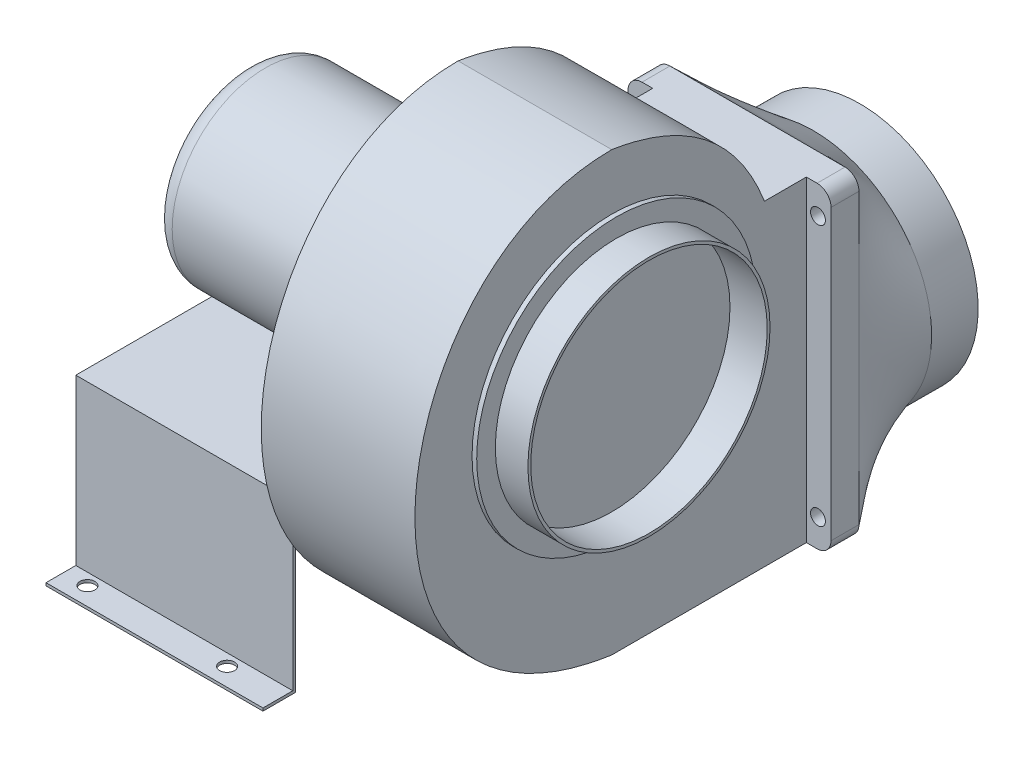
ISO-10303-21;
HEADER;
FILE_DESCRIPTION(('STEP AP214'),'2;1');
FILE_NAME('part.step','',(''),(''),'','','');
FILE_SCHEMA(('AUTOMOTIVE_DESIGN { 1 0 10303 214 1 1 1 1 }'));
ENDSEC;
DATA;
#1=APPLICATION_CONTEXT('core data for automotive mechanical design processes');
#2=APPLICATION_PROTOCOL_DEFINITION('international standard','automotive_design',2000,#1);
#3=PRODUCT_CONTEXT('',#1,'mechanical');
#4=PRODUCT('Part','Part','',(#3));
#5=PRODUCT_RELATED_PRODUCT_CATEGORY('part','',(#4));
#6=PRODUCT_DEFINITION_FORMATION('','',#4);
#7=PRODUCT_DEFINITION_CONTEXT('part definition',#1,'design');
#8=PRODUCT_DEFINITION('design','',#6,#7);
#9=PRODUCT_DEFINITION_SHAPE('','',#8);
#10=(LENGTH_UNIT() NAMED_UNIT(*) SI_UNIT(.MILLI.,.METRE.));
#11=(NAMED_UNIT(*) PLANE_ANGLE_UNIT() SI_UNIT($,.RADIAN.));
#12=(NAMED_UNIT(*) SI_UNIT($,.STERADIAN.) SOLID_ANGLE_UNIT());
#13=UNCERTAINTY_MEASURE_WITH_UNIT(LENGTH_MEASURE(1.E-05),#10,'distance_accuracy_value','');
#14=(GEOMETRIC_REPRESENTATION_CONTEXT(3) GLOBAL_UNCERTAINTY_ASSIGNED_CONTEXT((#13)) GLOBAL_UNIT_ASSIGNED_CONTEXT((#10,
#11,#12)) REPRESENTATION_CONTEXT('',''));
#15=CARTESIAN_POINT('',(0.,0.,0.));
#16=DIRECTION('',(0.,0.,1.));
#17=DIRECTION('',(1.,0.,0.));
#18=AXIS2_PLACEMENT_3D('',#15,#16,#17);
#19=CARTESIAN_POINT('',(0.,168.008766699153,-101.553584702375));
#20=DIRECTION('',(1.,0.,0.));
#21=DIRECTION('',(0.,0.,-1.));
#22=AXIS2_PLACEMENT_3D('',#19,#20,#21);
#23=PLANE('',#22);
#24=DIRECTION('',(0.,1.,0.));
#25=VECTOR('',#24,1.);
#26=CARTESIAN_POINT('',(0.,-290.,-174.5));
#27=LINE('',#26,#25);
#28=CARTESIAN_POINT('',(0.,-260.,-174.5));
#29=VERTEX_POINT('',#28);
#30=CARTESIAN_POINT('',(0.,-113.,-174.5));
#31=VERTEX_POINT('',#30);
#32=EDGE_CURVE('E881',#29,#31,#27,.T.);
#33=ORIENTED_EDGE('',*,*,#32,.F.);
#34=DIRECTION('',(0.,0.,-1.));
#35=VECTOR('',#34,1.);
#36=CARTESIAN_POINT('',(0.,-260.,0.));
#37=LINE('',#36,#35);
#38=CARTESIAN_POINT('',(0.,-260.,0.));
#39=VERTEX_POINT('',#38);
#40=EDGE_CURVE('E598',#39,#29,#37,.T.);
#41=ORIENTED_EDGE('',*,*,#40,.F.);
#42=CARTESIAN_POINT('',(0.,210.,0.));
#43=CARTESIAN_POINT('',(0.,210.20569510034,249.426178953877));
#44=CARTESIAN_POINT('',(0.,-214.571381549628,312.365711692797));
#45=CARTESIAN_POINT('',(0.,-260.,0.));
#46=B_SPLINE_CURVE_WITH_KNOTS('',3,(#42,#43,#44,#45),.UNSPECIFIED.,.F.,.F.,(4,4),(0.,1.),.UNSPECIFIED.);
#47=CARTESIAN_POINT('',(0.,-156.308858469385,174.5));
#48=VERTEX_POINT('',#47);
#49=EDGE_CURVE('E643',#48,#39,#46,.T.);
#50=ORIENTED_EDGE('',*,*,#49,.F.);
#51=DIRECTION('',(0.,-1.,0.));
#52=VECTOR('',#51,1.);
#53=CARTESIAN_POINT('',(0.,-113.,174.5));
#54=LINE('',#53,#52);
#55=CARTESIAN_POINT('',(0.,-113.,174.5));
#56=VERTEX_POINT('',#55);
#57=EDGE_CURVE('E896',#56,#48,#54,.T.);
#58=ORIENTED_EDGE('',*,*,#57,.F.);
#59=DIRECTION('',(0.,0.,1.));
#60=VECTOR('',#59,1.);
#61=CARTESIAN_POINT('',(0.,-113.,-174.5));
#62=LINE('',#61,#60);
#63=EDGE_CURVE('E882',#31,#56,#62,.T.);
#64=ORIENTED_EDGE('',*,*,#63,.F.);
#65=EDGE_LOOP('',(#33,#41,#50,#58,#64));
#66=FACE_BOUND('',#65,.T.);
#67=ADVANCED_FACE('F187',(#66),#23,.F.);
#68=CARTESIAN_POINT('',(0.,0.,0.));
#69=DIRECTION('',(1.,0.,0.));
#70=DIRECTION('',(0.,0.,-1.));
#71=AXIS2_PLACEMENT_3D('',#68,#69,#70);
#72=CIRCLE('',#71,100.);
#73=CARTESIAN_POINT('',(0.,0.,-100.));
#74=VERTEX_POINT('',#73);
#75=EDGE_CURVE('E591',#74,#74,#72,.F.);
#76=ORIENTED_EDGE('',*,*,#75,.F.);
#77=EDGE_LOOP('',(#76));
#78=FACE_BOUND('',#77,.T.);
#79=DIRECTION('',(0.,-1.,0.));
#80=VECTOR('',#79,1.);
#81=CARTESIAN_POINT('',(0.,-110.,-177.5));
#82=LINE('',#81,#80);
#83=CARTESIAN_POINT('',(0.,-110.,-177.5));
#84=VERTEX_POINT('',#83);
#85=CARTESIAN_POINT('',(0.,-260.,-177.5));
#86=VERTEX_POINT('',#85);
#87=EDGE_CURVE('E205',#84,#86,#82,.T.);
#88=ORIENTED_EDGE('',*,*,#87,.F.);
#89=DIRECTION('',(0.,0.,-1.));
#90=VECTOR('',#89,1.);
#91=CARTESIAN_POINT('',(0.,-110.,-177.5));
#92=LINE('',#91,#90);
#93=CARTESIAN_POINT('',(0.,-110.,177.5));
#94=VERTEX_POINT('',#93);
#95=EDGE_CURVE('E423',#94,#84,#92,.T.);
#96=ORIENTED_EDGE('',*,*,#95,.F.);
#97=DIRECTION('',(0.,1.,0.));
#98=VECTOR('',#97,1.);
#99=CARTESIAN_POINT('',(0.,-110.,177.5));
#100=LINE('',#99,#98);
#101=CARTESIAN_POINT('',(0.,-151.530255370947,177.5));
#102=VERTEX_POINT('',#101);
#103=EDGE_CURVE('E870',#102,#94,#100,.T.);
#104=ORIENTED_EDGE('',*,*,#103,.F.);
#105=CARTESIAN_POINT('',(0.,210.,0.));
#106=VERTEX_POINT('',#105);
#107=EDGE_CURVE('E613',#106,#102,#46,.T.);
#108=ORIENTED_EDGE('',*,*,#107,.F.);
#109=CARTESIAN_POINT('',(0.,80.,-164.));
#110=CARTESIAN_POINT('',(0.,191.017533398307,-121.10716940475));
#111=CARTESIAN_POINT('',(0.,210.,0.));
#112=B_SPLINE_CURVE_WITH_KNOTS('',2,(#109,#110,#111),.UNSPECIFIED.,.F.,.F.,(3,3),(0.,1.),.UNSPECIFIED.);
#113=CARTESIAN_POINT('',(0.,80.,-164.));
#114=VERTEX_POINT('',#113);
#115=EDGE_CURVE('E639',#114,#106,#112,.T.);
#116=ORIENTED_EDGE('',*,*,#115,.F.);
#117=DIRECTION('',(0.,0.,1.));
#118=VECTOR('',#117,1.);
#119=CARTESIAN_POINT('',(0.,80.,-209.));
#120=LINE('',#119,#118);
#121=CARTESIAN_POINT('',(0.,80.,-209.));
#122=VERTEX_POINT('',#121);
#123=EDGE_CURVE('E608',#122,#114,#120,.T.);
#124=ORIENTED_EDGE('',*,*,#123,.F.);
#125=DIRECTION('',(0.,1.,0.));
#126=VECTOR('',#125,1.);
#127=CARTESIAN_POINT('',(0.,-260.,-209.));
#128=LINE('',#127,#126);
#129=CARTESIAN_POINT('',(0.,-260.,-209.));
#130=VERTEX_POINT('',#129);
#131=EDGE_CURVE('E603',#130,#122,#128,.T.);
#132=ORIENTED_EDGE('',*,*,#131,.F.);
#133=EDGE_CURVE('E191',#86,#130,#37,.T.);
#134=ORIENTED_EDGE('',*,*,#133,.F.);
#135=EDGE_LOOP('',(#88,#96,#104,#108,#116,#124,#132,#134));
#136=FACE_BOUND('',#135,.T.);
#137=ADVANCED_FACE('F826',(#78,#136),#23,.F.);
#138=CARTESIAN_POINT('',(165.,168.008766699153,-101.553584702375));
#139=DIRECTION('',(1.,0.,0.));
#140=DIRECTION('',(0.,0.,-1.));
#141=AXIS2_PLACEMENT_3D('',#138,#139,#140);
#142=PLANE('',#141);
#143=CARTESIAN_POINT('',(165.,80.,-164.));
#144=CARTESIAN_POINT('',(165.,191.017533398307,-121.10716940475));
#145=CARTESIAN_POINT('',(165.,210.,0.));
#146=B_SPLINE_CURVE_WITH_KNOTS('',2,(#143,#144,#145),.UNSPECIFIED.,.F.,.F.,(3,3),(0.,1.),.UNSPECIFIED.);
#147=CARTESIAN_POINT('',(165.,80.,-164.));
#148=VERTEX_POINT('',#147);
#149=CARTESIAN_POINT('',(165.,210.,0.));
#150=VERTEX_POINT('',#149);
#151=EDGE_CURVE('E851',#148,#150,#146,.T.);
#152=ORIENTED_EDGE('',*,*,#151,.T.);
#153=CARTESIAN_POINT('',(165.,210.,0.));
#154=CARTESIAN_POINT('',(165.,210.20569510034,249.426178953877));
#155=CARTESIAN_POINT('',(165.,-214.571381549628,312.365711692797));
#156=CARTESIAN_POINT('',(165.,-260.,0.));
#157=B_SPLINE_CURVE_WITH_KNOTS('',3,(#153,#154,#155,#156),.UNSPECIFIED.,.F.,.F.,(4,4),(0.,1.),.UNSPECIFIED.);
#158=CARTESIAN_POINT('',(165.,-260.,0.));
#159=VERTEX_POINT('',#158);
#160=EDGE_CURVE('E634',#150,#159,#157,.T.);
#161=ORIENTED_EDGE('',*,*,#160,.T.);
#162=DIRECTION('',(0.,0.,-1.));
#163=VECTOR('',#162,1.);
#164=CARTESIAN_POINT('',(165.,-260.,0.));
#165=LINE('',#164,#163);
#166=CARTESIAN_POINT('',(165.,-260.,-209.));
#167=VERTEX_POINT('',#166);
#168=EDGE_CURVE('E630',#159,#167,#165,.T.);
#169=ORIENTED_EDGE('',*,*,#168,.T.);
#170=DIRECTION('',(0.,1.,0.));
#171=VECTOR('',#170,1.);
#172=CARTESIAN_POINT('',(165.,-260.,-209.));
#173=LINE('',#172,#171);
#174=CARTESIAN_POINT('',(165.,80.,-209.));
#175=VERTEX_POINT('',#174);
#176=EDGE_CURVE('E626',#167,#175,#173,.T.);
#177=ORIENTED_EDGE('',*,*,#176,.T.);
#178=DIRECTION('',(0.,0.,1.));
#179=VECTOR('',#178,1.);
#180=CARTESIAN_POINT('',(165.,80.,-209.));
#181=LINE('',#180,#179);
#182=EDGE_CURVE('E621',#175,#148,#181,.T.);
#183=ORIENTED_EDGE('',*,*,#182,.T.);
#184=EDGE_LOOP('',(#152,#161,#169,#177,#183));
#185=FACE_BOUND('',#184,.T.);
#186=CARTESIAN_POINT('',(165.,0.,0.));
#187=DIRECTION('',(1.,0.,0.));
#188=DIRECTION('',(0.,0.,-1.));
#189=AXIS2_PLACEMENT_3D('',#186,#187,#188);
#190=CIRCLE('',#189,150.);
#191=CARTESIAN_POINT('',(165.,0.,-150.));
#192=VERTEX_POINT('',#191);
#193=EDGE_CURVE('E450',#192,#192,#190,.T.);
#194=ORIENTED_EDGE('',*,*,#193,.F.);
#195=EDGE_LOOP('',(#194));
#196=FACE_BOUND('',#195,.T.);
#197=ADVANCED_FACE('F832',(#185,#196),#142,.T.);
#198=DIRECTION('',(-1.,0.,0.));
#199=VECTOR('',#198,1.);
#200=SURFACE_OF_LINEAR_EXTRUSION('',#146,#199);
#201=ORIENTED_EDGE('',*,*,#115,.T.);
#202=DIRECTION('',(-1.,0.,0.));
#203=VECTOR('',#202,1.);
#204=CARTESIAN_POINT('',(165.,210.,0.));
#205=LINE('',#204,#203);
#206=EDGE_CURVE('E592',#150,#106,#205,.T.);
#207=ORIENTED_EDGE('',*,*,#206,.F.);
#208=ORIENTED_EDGE('',*,*,#151,.F.);
#209=DIRECTION('',(-1.,0.,0.));
#210=VECTOR('',#209,1.);
#211=CARTESIAN_POINT('',(165.,80.,-164.));
#212=LINE('',#211,#210);
#213=EDGE_CURVE('E617',#148,#114,#212,.T.);
#214=ORIENTED_EDGE('',*,*,#213,.T.);
#215=EDGE_LOOP('',(#201,#207,#208,#214));
#216=FACE_BOUND('',#215,.T.);
#217=ADVANCED_FACE('F848',(#216),#200,.F.);
#218=DIRECTION('',(-1.,0.,0.));
#219=VECTOR('',#218,1.);
#220=SURFACE_OF_LINEAR_EXTRUSION('',#157,#219);
#221=ORIENTED_EDGE('',*,*,#107,.T.);
#222=CARTESIAN_POINT('',(0.,210.,0.));
#223=CARTESIAN_POINT('',(0.,210.20569510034,249.426178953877));
#224=CARTESIAN_POINT('',(0.,-214.571381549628,312.365711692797));
#225=CARTESIAN_POINT('',(0.,-260.,0.));
#226=B_SPLINE_CURVE_WITH_KNOTS('',3,(#222,#223,#224,#225),.UNSPECIFIED.,.F.,.F.,(4,4),(0.,1.),.UNSPECIFIED.);
#227=EDGE_CURVE('E428',#102,#48,#226,.T.);
#228=ORIENTED_EDGE('',*,*,#227,.T.);
#229=ORIENTED_EDGE('',*,*,#49,.T.);
#230=DIRECTION('',(-1.,0.,0.));
#231=VECTOR('',#230,1.);
#232=CARTESIAN_POINT('',(165.,-260.,0.));
#233=LINE('',#232,#231);
#234=EDGE_CURVE('E620',#159,#39,#233,.T.);
#235=ORIENTED_EDGE('',*,*,#234,.F.);
#236=ORIENTED_EDGE('',*,*,#160,.F.);
#237=ORIENTED_EDGE('',*,*,#206,.T.);
#238=EDGE_LOOP('',(#221,#228,#229,#235,#236,#237));
#239=FACE_BOUND('',#238,.T.);
#240=ADVANCED_FACE('F846',(#239),#220,.F.);
#241=CARTESIAN_POINT('',(165.,-260.,0.));
#242=DIRECTION('',(0.,1.,0.));
#243=DIRECTION('',(0.,0.,1.));
#244=AXIS2_PLACEMENT_3D('',#241,#242,#243);
#245=PLANE('',#244);
#246=ORIENTED_EDGE('',*,*,#40,.T.);
#247=EDGE_CURVE('E596',#29,#86,#37,.T.);
#248=ORIENTED_EDGE('',*,*,#247,.T.);
#249=ORIENTED_EDGE('',*,*,#133,.T.);
#250=DIRECTION('',(-1.,0.,0.));
#251=VECTOR('',#250,1.);
#252=CARTESIAN_POINT('',(176.5,-260.,-209.));
#253=LINE('',#252,#251);
#254=CARTESIAN_POINT('',(-11.4999999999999,-260.,-209.));
#255=VERTEX_POINT('',#254);
#256=EDGE_CURVE('E715',#130,#255,#253,.T.);
#257=ORIENTED_EDGE('',*,*,#256,.T.);
#258=DIRECTION('',(0.,0.,1.));
#259=VECTOR('',#258,1.);
#260=CARTESIAN_POINT('',(-11.4999999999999,-260.,-239.));
#261=LINE('',#260,#259);
#262=CARTESIAN_POINT('',(-11.4999999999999,-260.,-239.));
#263=VERTEX_POINT('',#262);
#264=EDGE_CURVE('E652',#263,#255,#261,.T.);
#265=ORIENTED_EDGE('',*,*,#264,.F.);
#266=DIRECTION('',(1.,0.,0.));
#267=VECTOR('',#266,1.);
#268=CARTESIAN_POINT('',(165.,-260.,-239.));
#269=LINE('',#268,#267);
#270=CARTESIAN_POINT('',(176.5,-260.,-239.));
#271=VERTEX_POINT('',#270);
#272=EDGE_CURVE('E582',#271,#263,#269,.F.);
#273=ORIENTED_EDGE('',*,*,#272,.F.);
#274=DIRECTION('',(0.,0.,1.));
#275=VECTOR('',#274,1.);
#276=CARTESIAN_POINT('',(176.5,-260.,-239.));
#277=LINE('',#276,#275);
#278=CARTESIAN_POINT('',(176.5,-260.,-209.));
#279=VERTEX_POINT('',#278);
#280=EDGE_CURVE('E644',#271,#279,#277,.T.);
#281=ORIENTED_EDGE('',*,*,#280,.T.);
#282=EDGE_CURVE('E708',#279,#167,#253,.T.);
#283=ORIENTED_EDGE('',*,*,#282,.T.);
#284=ORIENTED_EDGE('',*,*,#168,.F.);
#285=ORIENTED_EDGE('',*,*,#234,.T.);
#286=EDGE_LOOP('',(#246,#248,#249,#257,#265,#273,#281,#283,#284,#285));
#287=FACE_BOUND('',#286,.T.);
#288=ADVANCED_FACE('F842',(#287),#245,.F.);
#289=CARTESIAN_POINT('',(165.,80.,-209.));
#290=DIRECTION('',(0.,-1.,0.));
#291=DIRECTION('',(0.,0.,-1.));
#292=AXIS2_PLACEMENT_3D('',#289,#290,#291);
#293=PLANE('',#292);
#294=ORIENTED_EDGE('',*,*,#123,.T.);
#295=ORIENTED_EDGE('',*,*,#213,.F.);
#296=ORIENTED_EDGE('',*,*,#182,.F.);
#297=DIRECTION('',(1.,0.,0.));
#298=VECTOR('',#297,1.);
#299=CARTESIAN_POINT('',(176.5,80.,-209.));
#300=LINE('',#299,#298);
#301=CARTESIAN_POINT('',(176.5,80.,-209.));
#302=VERTEX_POINT('',#301);
#303=EDGE_CURVE('E697',#175,#302,#300,.T.);
#304=ORIENTED_EDGE('',*,*,#303,.T.);
#305=DIRECTION('',(0.,0.,1.));
#306=VECTOR('',#305,1.);
#307=CARTESIAN_POINT('',(176.5,80.,-239.));
#308=LINE('',#307,#306);
#309=CARTESIAN_POINT('',(176.5,80.,-239.));
#310=VERTEX_POINT('',#309);
#311=EDGE_CURVE('E672',#310,#302,#308,.T.);
#312=ORIENTED_EDGE('',*,*,#311,.F.);
#313=DIRECTION('',(1.,0.,0.));
#314=VECTOR('',#313,1.);
#315=CARTESIAN_POINT('',(165.,80.,-239.));
#316=LINE('',#315,#314);
#317=CARTESIAN_POINT('',(-11.5,80.,-239.));
#318=VERTEX_POINT('',#317);
#319=EDGE_CURVE('E558',#318,#310,#316,.T.);
#320=ORIENTED_EDGE('',*,*,#319,.F.);
#321=DIRECTION('',(0.,0.,1.));
#322=VECTOR('',#321,1.);
#323=CARTESIAN_POINT('',(-11.4999999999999,80.,-239.));
#324=LINE('',#323,#322);
#325=CARTESIAN_POINT('',(-11.4999999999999,80.,-209.));
#326=VERTEX_POINT('',#325);
#327=EDGE_CURVE('E669',#318,#326,#324,.T.);
#328=ORIENTED_EDGE('',*,*,#327,.T.);
#329=EDGE_CURVE('E691',#326,#122,#300,.T.);
#330=ORIENTED_EDGE('',*,*,#329,.T.);
#331=EDGE_LOOP('',(#294,#295,#296,#304,#312,#320,#328,#330));
#332=FACE_BOUND('',#331,.T.);
#333=ADVANCED_FACE('F838',(#332),#293,.F.);
#334=CARTESIAN_POINT('',(176.5,-245.,-209.));
#335=DIRECTION('',(0.,0.,1.));
#336=DIRECTION('',(1.,0.,0.));
#337=AXIS2_PLACEMENT_3D('',#334,#335,#336);
#338=PLANE('',#337);
#339=CARTESIAN_POINT('',(177.5,-230.,-209.));
#340=DIRECTION('',(0.,0.,-1.));
#341=DIRECTION('',(-1.,0.,0.));
#342=AXIS2_PLACEMENT_3D('',#339,#340,#341);
#343=CIRCLE('',#342,8.00000000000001);
#344=CARTESIAN_POINT('',(169.5,-230.,-209.));
#345=VERTEX_POINT('',#344);
#346=EDGE_CURVE('E775',#345,#345,#343,.T.);
#347=ORIENTED_EDGE('',*,*,#346,.T.);
#348=EDGE_LOOP('',(#347));
#349=FACE_BOUND('',#348,.T.);
#350=CARTESIAN_POINT('',(177.5,50.,-209.));
#351=DIRECTION('',(0.,0.,-1.));
#352=DIRECTION('',(-1.,0.,0.));
#353=AXIS2_PLACEMENT_3D('',#350,#351,#352);
#354=CIRCLE('',#353,8.00000000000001);
#355=CARTESIAN_POINT('',(169.5,50.,-209.));
#356=VERTEX_POINT('',#355);
#357=EDGE_CURVE('E719',#356,#356,#354,.T.);
#358=ORIENTED_EDGE('',*,*,#357,.T.);
#359=EDGE_LOOP('',(#358));
#360=FACE_BOUND('',#359,.T.);
#361=ORIENTED_EDGE('',*,*,#176,.F.);
#362=ORIENTED_EDGE('',*,*,#282,.F.);
#363=CARTESIAN_POINT('',(176.5,-245.,-209.));
#364=DIRECTION('',(0.,0.,-1.));
#365=DIRECTION('',(1.,0.,0.));
#366=AXIS2_PLACEMENT_3D('',#363,#364,#365);
#367=CIRCLE('',#366,15.);
#368=CARTESIAN_POINT('',(191.5,-245.,-209.));
#369=VERTEX_POINT('',#368);
#370=EDGE_CURVE('E711',#369,#279,#367,.T.);
#371=ORIENTED_EDGE('',*,*,#370,.F.);
#372=DIRECTION('',(0.,-1.,0.));
#373=VECTOR('',#372,1.);
#374=CARTESIAN_POINT('',(191.5,-245.,-209.));
#375=LINE('',#374,#373);
#376=CARTESIAN_POINT('',(191.5,64.9999999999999,-209.));
#377=VERTEX_POINT('',#376);
#378=EDGE_CURVE('E586',#377,#369,#375,.T.);
#379=ORIENTED_EDGE('',*,*,#378,.F.);
#380=CARTESIAN_POINT('',(176.5,65.,-209.));
#381=DIRECTION('',(0.,0.,-1.));
#382=DIRECTION('',(1.,0.,0.));
#383=AXIS2_PLACEMENT_3D('',#380,#381,#382);
#384=CIRCLE('',#383,15.);
#385=EDGE_CURVE('E689',#302,#377,#384,.T.);
#386=ORIENTED_EDGE('',*,*,#385,.F.);
#387=ORIENTED_EDGE('',*,*,#303,.F.);
#388=EDGE_LOOP('',(#361,#362,#371,#379,#386,#387));
#389=FACE_BOUND('',#388,.T.);
#390=ADVANCED_FACE('F841',(#349,#360,#389),#338,.T.);
#391=CARTESIAN_POINT('',(176.5,-245.,-239.));
#392=DIRECTION('',(0.,0.,1.));
#393=DIRECTION('',(1.,0.,0.));
#394=AXIS2_PLACEMENT_3D('',#391,#392,#393);
#395=CYLINDRICAL_SURFACE('',#394,15.);
#396=ORIENTED_EDGE('',*,*,#370,.T.);
#397=ORIENTED_EDGE('',*,*,#280,.F.);
#398=CARTESIAN_POINT('',(191.5,-245.000000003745,-239.));
#399=CARTESIAN_POINT('',(191.500009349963,-245.284019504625,-238.999983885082));
#400=CARTESIAN_POINT('',(191.491933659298,-245.568038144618,-238.999981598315));
#401=CARTESIAN_POINT('',(191.459679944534,-246.13514785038,-238.999992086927));
#402=CARTESIAN_POINT('',(191.435502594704,-246.418238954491,-239.000004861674));
#403=CARTESIAN_POINT('',(191.371113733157,-246.982587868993,-239.000032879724));
#404=CARTESIAN_POINT('',(191.330902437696,-247.263845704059,-239.000048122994));
#405=CARTESIAN_POINT('',(191.234618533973,-247.823390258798,-239.000017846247));
#406=CARTESIAN_POINT('',(191.178559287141,-248.101679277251,-238.999972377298));
#407=CARTESIAN_POINT('',(191.050747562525,-248.654623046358,-238.999934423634));
#408=CARTESIAN_POINT('',(190.978995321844,-248.929277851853,-238.999941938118));
#409=CARTESIAN_POINT('',(190.820025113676,-249.474079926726,-238.999999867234));
#410=CARTESIAN_POINT('',(190.732807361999,-249.744227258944,-239.000050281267));
#411=CARTESIAN_POINT('',(190.567549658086,-250.210424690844,-239.000075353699));
#412=CARTESIAN_POINT('',(190.492905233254,-250.407686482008,-239.000066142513));
#413=CARTESIAN_POINT('',(190.335359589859,-250.798904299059,-239.000014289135));
#414=CARTESIAN_POINT('',(190.252457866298,-250.992860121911,-238.999971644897));
#415=CARTESIAN_POINT('',(190.078552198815,-251.377099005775,-238.999924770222));
#416=CARTESIAN_POINT('',(189.987548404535,-251.567382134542,-238.999920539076));
#417=CARTESIAN_POINT('',(189.797600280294,-251.943939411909,-238.999947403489));
#418=CARTESIAN_POINT('',(189.698656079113,-252.130213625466,-238.999978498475));
#419=CARTESIAN_POINT('',(189.493021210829,-252.498389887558,-239.00004979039));
#420=CARTESIAN_POINT('',(189.386332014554,-252.680292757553,-239.000089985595));
#421=CARTESIAN_POINT('',(189.16538061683,-253.039439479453,-239.000099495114));
#422=CARTESIAN_POINT('',(189.051118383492,-253.216683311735,-239.000068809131));
#423=CARTESIAN_POINT('',(188.815222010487,-253.566198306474,-238.999991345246));
#424=CARTESIAN_POINT('',(188.693587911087,-253.738469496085,-238.999944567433));
#425=CARTESIAN_POINT('',(188.443175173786,-254.077721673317,-238.99989398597));
#426=CARTESIAN_POINT('',(188.314396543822,-254.244702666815,-238.999890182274));
#427=CARTESIAN_POINT('',(187.917682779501,-254.737258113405,-238.99996047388));
#428=CARTESIAN_POINT('',(187.639315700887,-255.05452512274,-239.000116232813));
#429=CARTESIAN_POINT('',(187.056835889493,-255.664475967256,-239.000125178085));
#430=CARTESIAN_POINT('',(186.752723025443,-255.957159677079,-238.999978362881));
#431=CARTESIAN_POINT('',(186.278924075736,-256.376166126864,-238.999890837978));
#432=CARTESIAN_POINT('',(186.118015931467,-256.51252588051,-238.999883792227));
#433=CARTESIAN_POINT('',(185.790583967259,-256.778348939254,-238.999916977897));
#434=CARTESIAN_POINT('',(185.62406014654,-256.907812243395,-238.999957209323));
#435=CARTESIAN_POINT('',(185.285706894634,-257.159598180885,-239.000049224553));
#436=CARTESIAN_POINT('',(185.113877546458,-257.281920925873,-239.000101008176));
#437=CARTESIAN_POINT('',(184.76521456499,-257.519213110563,-239.000120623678));
#438=CARTESIAN_POINT('',(184.58838093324,-257.634182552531,-239.000088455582));
#439=CARTESIAN_POINT('',(184.229987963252,-257.856584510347,-239.000010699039));
#440=CARTESIAN_POINT('',(184.048427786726,-257.964015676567,-238.999965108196));
#441=CARTESIAN_POINT('',(183.680952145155,-258.171120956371,-238.999909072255));
#442=CARTESIAN_POINT('',(183.495036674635,-258.2707950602,-238.999898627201));
#443=CARTESIAN_POINT('',(182.931215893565,-258.557922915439,-238.999946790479));
#444=CARTESIAN_POINT('',(182.547178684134,-258.733517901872,-239.00008486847));
#445=CARTESIAN_POINT('',(181.765939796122,-259.051610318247,-239.000104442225));
#446=CARTESIAN_POINT('',(181.36874507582,-259.194124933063,-238.999986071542));
#447=CARTESIAN_POINT('',(180.563808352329,-259.445174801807,-238.999912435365));
#448=CARTESIAN_POINT('',(180.156068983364,-259.553718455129,-238.999957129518));
#449=CARTESIAN_POINT('',(179.478238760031,-259.703896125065,-239.000029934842));
#450=CARTESIAN_POINT('',(179.21033773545,-259.755625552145,-239.000058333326));
#451=CARTESIAN_POINT('',(178.672154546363,-259.844395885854,-239.000047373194));
#452=CARTESIAN_POINT('',(178.401872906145,-259.881439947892,-239.000008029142));
#453=CARTESIAN_POINT('',(177.860091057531,-259.940692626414,-238.999964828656));
#454=CARTESIAN_POINT('',(177.588593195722,-259.962922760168,-238.999960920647));
#455=CARTESIAN_POINT('',(177.044731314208,-259.992581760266,-238.999971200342));
#456=CARTESIAN_POINT('',(176.772367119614,-260.000007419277,-238.999985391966));
#457=CARTESIAN_POINT('',(176.5,-260.,-239.));
#458=B_SPLINE_CURVE_WITH_KNOTS('',3,(#398,#399,#400,#401,#402,#403,#404,#405,#406,#407,#408,
#409,#410,#411,#412,#413,#414,#415,#416,#417,#418,#419,#420,#421,#422,#423,#424,#425,#426,#427,
#428,#429,#430,#431,#432,#433,#434,#435,#436,#437,#438,#439,#440,#441,#442,#443,#444,#445,#446,
#447,#448,#449,#450,#451,#452,#453,#454,#455,#456,#457),.UNSPECIFIED.,.F.,.F.,(4,2,2,2,2,2,2,2,
2,2,2,2,2,2,2,2,2,2,2,2,2,2,2,2,2,2,2,2,2,4),(0.,0.851942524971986,1.70384937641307,
2.55574473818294,3.40692399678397,4.25809039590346,5.10924491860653,5.74180614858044,
6.37440608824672,7.00699434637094,7.63957234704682,8.27203052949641,8.90449137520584,
9.53694876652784,10.1694054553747,11.4340298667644,12.6986607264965,13.3312511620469,
13.9638416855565,14.5964223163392,15.229002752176,15.8616961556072,16.4943903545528,
17.7595762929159,19.0241035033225,20.2883178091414,21.1065022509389,21.9245107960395,
22.7413285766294,23.5583232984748),.UNSPECIFIED.);
#459=CARTESIAN_POINT('',(191.5,-245.000000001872,-239.));
#460=VERTEX_POINT('',#459);
#461=EDGE_CURVE('E542',#460,#271,#458,.T.);
#462=ORIENTED_EDGE('',*,*,#461,.F.);
#463=DIRECTION('',(0.,0.,1.));
#464=VECTOR('',#463,1.);
#465=CARTESIAN_POINT('',(191.5,-245.,-239.));
#466=LINE('',#465,#464);
#467=EDGE_CURVE('E662',#460,#369,#466,.T.);
#468=ORIENTED_EDGE('',*,*,#467,.T.);
#469=EDGE_LOOP('',(#396,#397,#462,#468));
#470=FACE_BOUND('',#469,.T.);
#471=ADVANCED_FACE('F1251',(#470),#395,.T.);
#472=CARTESIAN_POINT('',(-11.5,-245.,-239.));
#473=DIRECTION('',(0.,0.,1.));
#474=DIRECTION('',(1.,0.,0.));
#475=AXIS2_PLACEMENT_3D('',#472,#473,#474);
#476=CYLINDRICAL_SURFACE('',#475,15.);
#477=CARTESIAN_POINT('',(-11.5,-245.,-209.));
#478=DIRECTION('',(0.,0.,-1.));
#479=DIRECTION('',(-1.,0.,0.));
#480=AXIS2_PLACEMENT_3D('',#477,#478,#479);
#481=CIRCLE('',#480,15.);
#482=CARTESIAN_POINT('',(-26.5,-245.,-209.));
#483=VERTEX_POINT('',#482);
#484=EDGE_CURVE('E706',#255,#483,#481,.T.);
#485=ORIENTED_EDGE('',*,*,#484,.T.);
#486=DIRECTION('',(0.,0.,1.));
#487=VECTOR('',#486,1.);
#488=CARTESIAN_POINT('',(-26.5,-245.,-239.));
#489=LINE('',#488,#487);
#490=CARTESIAN_POINT('',(-26.5,-245.,-239.));
#491=VERTEX_POINT('',#490);
#492=EDGE_CURVE('E659',#491,#483,#489,.T.);
#493=ORIENTED_EDGE('',*,*,#492,.F.);
#494=CARTESIAN_POINT('',(-11.4999999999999,-260.,-239.));
#495=CARTESIAN_POINT('',(-11.7109456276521,-260.000002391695,-238.999992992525));
#496=CARTESIAN_POINT('',(-11.921888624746,-259.995550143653,-238.999981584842));
#497=CARTESIAN_POINT('',(-12.3433987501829,-259.977755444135,-238.999965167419));
#498=CARTESIAN_POINT('',(-12.5539658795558,-259.964413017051,-238.999960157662));
#499=CARTESIAN_POINT('',(-12.9743451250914,-259.928857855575,-238.999971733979));
#500=CARTESIAN_POINT('',(-13.1841572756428,-259.906645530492,-238.999988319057));
#501=CARTESIAN_POINT('',(-13.6026385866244,-259.853397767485,-239.000029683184));
#502=CARTESIAN_POINT('',(-13.8113077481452,-259.82236233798,-239.000054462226));
#503=CARTESIAN_POINT('',(-14.4347756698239,-259.716134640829,-239.000058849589));
#504=CARTESIAN_POINT('',(-14.847446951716,-259.627786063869,-238.999968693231));
#505=CARTESIAN_POINT('',(-15.4596014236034,-259.469487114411,-238.999923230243));
#506=CARTESIAN_POINT('',(-15.6625317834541,-259.412417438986,-238.999923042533));
#507=CARTESIAN_POINT('',(-16.0658269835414,-259.289773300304,-238.999955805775));
#508=CARTESIAN_POINT('',(-16.2661918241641,-259.224198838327,-238.999988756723));
#509=CARTESIAN_POINT('',(-16.664070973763,-259.084631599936,-239.000058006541));
#510=CARTESIAN_POINT('',(-16.8615838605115,-259.010634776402,-239.000094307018));
#511=CARTESIAN_POINT('',(-17.2533148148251,-258.854379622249,-239.000096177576));
#512=CARTESIAN_POINT('',(-17.4475328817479,-258.772121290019,-239.000061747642));
#513=CARTESIAN_POINT('',(-17.8323326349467,-258.599486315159,-238.999985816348));
#514=CARTESIAN_POINT('',(-18.0229142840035,-258.50910958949,-238.999944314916));
#515=CARTESIAN_POINT('',(-18.4000867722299,-258.320408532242,-238.999902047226));
#516=CARTESIAN_POINT('',(-18.5866776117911,-258.222084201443,-238.999901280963));
#517=CARTESIAN_POINT('',(-19.1398959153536,-257.915481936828,-238.99997189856));
#518=CARTESIAN_POINT('',(-19.5001239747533,-257.695505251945,-239.0001161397));
#519=CARTESIAN_POINT('',(-20.2007604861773,-257.225980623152,-239.000110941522));
#520=CARTESIAN_POINT('',(-20.5411690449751,-256.976432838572,-238.999961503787));
#521=CARTESIAN_POINT('',(-21.0350376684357,-256.581344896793,-238.999885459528));
#522=CARTESIAN_POINT('',(-21.1968861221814,-256.44617242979,-238.999884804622));
#523=CARTESIAN_POINT('',(-21.5147517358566,-256.169117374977,-238.999929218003));
#524=CARTESIAN_POINT('',(-21.6707688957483,-256.027234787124,-238.999974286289));
#525=CARTESIAN_POINT('',(-21.9766816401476,-255.737019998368,-239.000068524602));
#526=CARTESIAN_POINT('',(-22.1265771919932,-255.588687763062,-239.00011769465));
#527=CARTESIAN_POINT('',(-22.4199824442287,-255.285836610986,-239.000126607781));
#528=CARTESIAN_POINT('',(-22.5634921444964,-255.131317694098,-239.000086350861));
#529=CARTESIAN_POINT('',(-22.8439001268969,-254.816333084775,-238.999999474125));
#530=CARTESIAN_POINT('',(-22.9807970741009,-254.655866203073,-238.999952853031));
#531=CARTESIAN_POINT('',(-23.2476966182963,-254.329314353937,-238.999898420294));
#532=CARTESIAN_POINT('',(-23.3776992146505,-254.163229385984,-238.999890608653));
#533=CARTESIAN_POINT('',(-23.7570081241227,-253.656991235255,-238.999945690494));
#534=CARTESIAN_POINT('',(-23.9956824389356,-253.308779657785,-239.000087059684));
#535=CARTESIAN_POINT('',(-24.4428731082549,-252.593418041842,-239.000106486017));
#536=CARTESIAN_POINT('',(-24.6513842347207,-252.226264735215,-238.999984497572));
#537=CARTESIAN_POINT('',(-24.9403636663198,-251.663419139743,-238.999921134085));
#538=CARTESIAN_POINT('',(-25.0327371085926,-251.473756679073,-238.999919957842));
#539=CARTESIAN_POINT('',(-25.2094092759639,-251.090695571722,-238.999956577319));
#540=CARTESIAN_POINT('',(-25.2937080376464,-250.897296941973,-238.999994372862));
#541=CARTESIAN_POINT('',(-25.4540332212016,-250.50721335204,-239.000053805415));
#542=CARTESIAN_POINT('',(-25.5300637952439,-250.310530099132,-239.000075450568));
#543=CARTESIAN_POINT('',(-25.6737651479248,-249.91414754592,-239.000065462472));
#544=CARTESIAN_POINT('',(-25.7414357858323,-249.714448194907,-239.000033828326));
#545=CARTESIAN_POINT('',(-25.9316907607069,-249.111426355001,-238.999957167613));
#546=CARTESIAN_POINT('',(-26.0415938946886,-248.703995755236,-238.999930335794));
#547=CARTESIAN_POINT('',(-26.1949149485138,-248.022620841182,-238.999979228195));
#548=CARTESIAN_POINT('',(-26.2482067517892,-247.750833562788,-239.000022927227));
#549=CARTESIAN_POINT('',(-26.3396640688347,-247.204759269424,-239.000048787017));
#550=CARTESIAN_POINT('',(-26.3778327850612,-246.930472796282,-239.00003096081));
#551=CARTESIAN_POINT('',(-26.4388866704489,-246.380605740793,-239.000001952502));
#552=CARTESIAN_POINT('',(-26.4617935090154,-246.105027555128,-238.999990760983));
#553=CARTESIAN_POINT('',(-26.4923556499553,-245.552967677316,-238.999982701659));
#554=CARTESIAN_POINT('',(-26.5000076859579,-245.276485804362,-238.999985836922));
#555=CARTESIAN_POINT('',(-26.5,-245.,-239.));
#556=B_SPLINE_CURVE_WITH_KNOTS('',3,(#494,#495,#496,#497,#498,#499,#500,#501,#502,#503,#504,
#505,#506,#507,#508,#509,#510,#511,#512,#513,#514,#515,#516,#517,#518,#519,#520,#521,#522,#523,
#524,#525,#526,#527,#528,#529,#530,#531,#532,#533,#534,#535,#536,#537,#538,#539,#540,#541,#542,
#543,#544,#545,#546,#547,#548,#549,#550,#551,#552,#553,#554,#555),.UNSPECIFIED.,.F.,.F.,(4,2,2,
2,2,2,2,2,2,2,2,2,2,2,2,2,2,2,2,2,2,2,2,2,2,2,2,2,2,2,4),(0.,0.632784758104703,1.26556777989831,
1.89832160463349,2.53107482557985,3.79534432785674,4.4276118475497,5.05987927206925,
5.69245180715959,6.32502446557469,6.9576035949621,7.59018266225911,8.85483337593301,
10.1194772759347,10.7519334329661,11.3843895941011,12.0168491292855,12.6493086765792,
13.2818953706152,13.9144821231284,15.1793548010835,16.4444464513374,17.0771732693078,
17.7098972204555,18.3423019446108,18.9747173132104,20.2389520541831,21.0694761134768,
21.8998242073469,22.728990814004,23.5583349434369),.UNSPECIFIED.);
#557=EDGE_CURVE('E527',#263,#491,#556,.T.);
#558=ORIENTED_EDGE('',*,*,#557,.F.);
#559=ORIENTED_EDGE('',*,*,#264,.T.);
#560=EDGE_LOOP('',(#485,#493,#558,#559));
#561=FACE_BOUND('',#560,.T.);
#562=ADVANCED_FACE('F1242',(#561),#476,.T.);
#563=CARTESIAN_POINT('',(-26.5,-245.,-239.));
#564=DIRECTION('',(1.,0.,0.));
#565=DIRECTION('',(0.,0.,-1.));
#566=AXIS2_PLACEMENT_3D('',#563,#564,#565);
#567=PLANE('',#566);
#568=DIRECTION('',(0.,1.,0.));
#569=VECTOR('',#568,1.);
#570=CARTESIAN_POINT('',(-26.5,-245.,-209.));
#571=LINE('',#570,#569);
#572=CARTESIAN_POINT('',(-26.5,64.9999999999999,-209.));
#573=VERTEX_POINT('',#572);
#574=EDGE_CURVE('E704',#483,#573,#571,.T.);
#575=ORIENTED_EDGE('',*,*,#574,.T.);
#576=DIRECTION('',(0.,0.,1.));
#577=VECTOR('',#576,1.);
#578=CARTESIAN_POINT('',(-26.5,64.9999999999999,-239.));
#579=LINE('',#578,#577);
#580=CARTESIAN_POINT('',(-26.5,64.9999999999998,-239.));
#581=VERTEX_POINT('',#580);
#582=EDGE_CURVE('E666',#581,#573,#579,.T.);
#583=ORIENTED_EDGE('',*,*,#582,.F.);
#584=DIRECTION('',(0.,1.,0.));
#585=VECTOR('',#584,1.);
#586=CARTESIAN_POINT('',(-26.5,-245.,-239.));
#587=LINE('',#586,#585);
#588=EDGE_CURVE('E578',#491,#581,#587,.T.);
#589=ORIENTED_EDGE('',*,*,#588,.F.);
#590=ORIENTED_EDGE('',*,*,#492,.T.);
#591=EDGE_LOOP('',(#575,#583,#589,#590));
#592=FACE_BOUND('',#591,.T.);
#593=ADVANCED_FACE('F571',(#592),#567,.F.);
#594=CARTESIAN_POINT('',(-11.5,65.,-239.));
#595=DIRECTION('',(0.,0.,1.));
#596=DIRECTION('',(1.,0.,0.));
#597=AXIS2_PLACEMENT_3D('',#594,#595,#596);
#598=CYLINDRICAL_SURFACE('',#597,15.);
#599=CARTESIAN_POINT('',(-11.5,65.,-209.));
#600=DIRECTION('',(0.,0.,-1.));
#601=DIRECTION('',(1.,0.,0.));
#602=AXIS2_PLACEMENT_3D('',#599,#600,#601);
#603=CIRCLE('',#602,15.);
#604=EDGE_CURVE('E701',#573,#326,#603,.T.);
#605=ORIENTED_EDGE('',*,*,#604,.T.);
#606=ORIENTED_EDGE('',*,*,#327,.F.);
#607=CARTESIAN_POINT('',(-26.5,64.9999999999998,-239.));
#608=CARTESIAN_POINT('',(-26.5000093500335,65.2840195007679,-238.999983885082));
#609=CARTESIAN_POINT('',(-26.4919336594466,65.5680381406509,-238.999981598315));
#610=CARTESIAN_POINT('',(-26.4596799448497,66.135147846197,-238.999992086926));
#611=CARTESIAN_POINT('',(-26.4355025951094,66.4182389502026,-239.000004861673));
#612=CARTESIAN_POINT('',(-26.3711137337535,66.9825878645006,-239.000032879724));
#613=CARTESIAN_POINT('',(-26.330902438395,67.2638456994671,-239.000048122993));
#614=CARTESIAN_POINT('',(-26.2346185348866,67.8233902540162,-239.000017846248));
#615=CARTESIAN_POINT('',(-26.1785592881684,68.1016792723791,-238.999972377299));
#616=CARTESIAN_POINT('',(-26.0507475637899,68.6546230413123,-238.999934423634));
#617=CARTESIAN_POINT('',(-25.9789953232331,68.929277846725,-238.999941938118));
#618=CARTESIAN_POINT('',(-25.8200251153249,69.4740799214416,-238.999999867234));
#619=CARTESIAN_POINT('',(-25.7328073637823,69.744227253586,-239.000050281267));
#620=CARTESIAN_POINT('',(-25.5675496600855,70.2104246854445,-239.000075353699));
#621=CARTESIAN_POINT('',(-25.4929052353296,70.4076864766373,-239.000066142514));
#622=CARTESIAN_POINT('',(-25.3353595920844,70.798904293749,-239.000014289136));
#623=CARTESIAN_POINT('',(-25.2524578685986,70.9928601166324,-238.999971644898));
#624=CARTESIAN_POINT('',(-25.0785522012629,71.3770990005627,-238.999924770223));
#625=CARTESIAN_POINT('',(-24.9875484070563,71.5673821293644,-238.999920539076));
#626=CARTESIAN_POINT('',(-24.7976002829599,71.9439394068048,-238.999947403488));
#627=CARTESIAN_POINT('',(-24.6986560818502,72.1302136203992,-238.999978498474));
#628=CARTESIAN_POINT('',(-24.4930212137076,72.4983898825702,-239.000049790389));
#629=CARTESIAN_POINT('',(-24.3863320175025,72.6802927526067,-239.000089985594));
#630=CARTESIAN_POINT('',(-24.1653806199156,73.0394394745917,-239.000099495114));
#631=CARTESIAN_POINT('',(-24.0511183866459,73.2166833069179,-239.000068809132));
#632=CARTESIAN_POINT('',(-23.8152220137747,73.5661983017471,-238.999991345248));
#633=CARTESIAN_POINT('',(-23.6935879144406,73.7384694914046,-238.999944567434));
#634=CARTESIAN_POINT('',(-23.4431751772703,74.0777216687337,-238.999893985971));
#635=CARTESIAN_POINT('',(-23.3143965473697,74.2447026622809,-238.999890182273));
#636=CARTESIAN_POINT('',(-22.9176827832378,74.737258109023,-238.999960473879));
#637=CARTESIAN_POINT('',(-22.6393157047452,75.0545251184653,-239.000116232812));
#638=CARTESIAN_POINT('',(-22.0568358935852,75.6644759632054,-239.000125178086));
#639=CARTESIAN_POINT('',(-21.7527230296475,75.9571596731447,-238.999978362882));
#640=CARTESIAN_POINT('',(-21.2789240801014,76.3761661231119,-238.999890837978));
#641=CARTESIAN_POINT('',(-21.1180159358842,76.5125258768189,-238.999883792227));
#642=CARTESIAN_POINT('',(-20.7905839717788,76.7783489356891,-238.999916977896));
#643=CARTESIAN_POINT('',(-20.6240601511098,76.9078122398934,-238.999957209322));
#644=CARTESIAN_POINT('',(-20.2857068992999,77.1595981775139,-239.000049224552));
#645=CARTESIAN_POINT('',(-20.1138775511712,77.2819209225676,-239.000101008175));
#646=CARTESIAN_POINT('',(-19.7652145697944,77.5192131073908,-239.000120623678));
#647=CARTESIAN_POINT('',(-19.5883809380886,77.6341825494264,-239.000088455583));
#648=CARTESIAN_POINT('',(-19.2299879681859,77.8565845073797,-239.00001069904));
#649=CARTESIAN_POINT('',(-19.0484277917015,77.9640156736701,-238.999965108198));
#650=CARTESIAN_POINT('',(-18.6809521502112,78.1711209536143,-238.999909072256));
#651=CARTESIAN_POINT('',(-18.4950366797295,78.2707950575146,-238.999898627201));
#652=CARTESIAN_POINT('',(-17.9312158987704,78.5579229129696,-238.999946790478));
#653=CARTESIAN_POINT('',(-17.5471786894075,78.7335178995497,-239.00008486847));
#654=CARTESIAN_POINT('',(-16.7659398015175,79.0516103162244,-239.000104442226));
#655=CARTESIAN_POINT('',(-16.36874508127,79.1941249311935,-238.999986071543));
#656=CARTESIAN_POINT('',(-15.5638083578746,79.4451748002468,-238.999912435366));
#657=CARTESIAN_POINT('',(-15.15606898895,79.5537184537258,-238.999957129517));
#658=CARTESIAN_POINT('',(-14.4782387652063,79.703896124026,-239.000029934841));
#659=CARTESIAN_POINT('',(-14.2103377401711,79.7556255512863,-239.000058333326));
#660=CARTESIAN_POINT('',(-13.6721545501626,79.8443958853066,-239.000047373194));
#661=CARTESIAN_POINT('',(-13.4018729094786,79.8814399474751,-239.000008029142));
#662=CARTESIAN_POINT('',(-12.860091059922,79.9406926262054,-238.999964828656));
#663=CARTESIAN_POINT('',(-12.5885931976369,79.962922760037,-238.999960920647));
#664=CARTESIAN_POINT('',(-12.0447313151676,79.9925817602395,-238.999971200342));
#665=CARTESIAN_POINT('',(-11.7723671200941,80.000007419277,-238.999985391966));
#666=CARTESIAN_POINT('',(-11.4999999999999,80.0000000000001,-239.));
#667=B_SPLINE_CURVE_WITH_KNOTS('',3,(#607,#608,#609,#610,#611,#612,#613,#614,#615,#616,#617,
#618,#619,#620,#621,#622,#623,#624,#625,#626,#627,#628,#629,#630,#631,#632,#633,#634,#635,#636,
#637,#638,#639,#640,#641,#642,#643,#644,#645,#646,#647,#648,#649,#650,#651,#652,#653,#654,#655,
#656,#657,#658,#659,#660,#661,#662,#663,#664,#665,#666),.UNSPECIFIED.,.F.,.F.,(4,2,2,2,2,2,2,2,
2,2,2,2,2,2,2,2,2,2,2,2,2,2,2,2,2,2,2,2,2,4),(0.,0.851942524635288,1.70384937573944,
2.55574473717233,3.40692399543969,4.25809039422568,5.10924491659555,5.74180614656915,
6.37440608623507,7.00699434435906,7.63957234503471,8.27203052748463,8.90449137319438,
9.53694876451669,10.1694054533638,11.4340298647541,12.6986607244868,13.331251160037,
13.9638416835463,14.5964223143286,15.2290027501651,15.8616961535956,16.4943903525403,
17.7595762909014,19.0241035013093,20.2883178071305,21.1065022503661,21.9245107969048,
22.7413285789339,23.5583233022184),.UNSPECIFIED.);
#668=EDGE_CURVE('E573',#581,#318,#667,.T.);
#669=ORIENTED_EDGE('',*,*,#668,.F.);
#670=ORIENTED_EDGE('',*,*,#582,.T.);
#671=EDGE_LOOP('',(#605,#606,#669,#670));
#672=FACE_BOUND('',#671,.T.);
#673=ADVANCED_FACE('F565',(#672),#598,.T.);
#674=CARTESIAN_POINT('',(176.5,65.,-239.));
#675=DIRECTION('',(0.,0.,1.));
#676=DIRECTION('',(1.,0.,0.));
#677=AXIS2_PLACEMENT_3D('',#674,#675,#676);
#678=CYLINDRICAL_SURFACE('',#677,15.);
#679=ORIENTED_EDGE('',*,*,#385,.T.);
#680=DIRECTION('',(0.,0.,1.));
#681=VECTOR('',#680,1.);
#682=CARTESIAN_POINT('',(191.5,64.9999999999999,-239.));
#683=LINE('',#682,#681);
#684=CARTESIAN_POINT('',(191.5,64.9999999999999,-239.));
#685=VERTEX_POINT('',#684);
#686=EDGE_CURVE('E674',#685,#377,#683,.T.);
#687=ORIENTED_EDGE('',*,*,#686,.F.);
#688=CARTESIAN_POINT('',(176.5,80.,-239.));
#689=CARTESIAN_POINT('',(176.710945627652,80.0000023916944,-238.999992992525));
#690=CARTESIAN_POINT('',(176.921888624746,79.9955501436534,-238.999981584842));
#691=CARTESIAN_POINT('',(177.343398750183,79.9777554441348,-238.999965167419));
#692=CARTESIAN_POINT('',(177.553965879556,79.9644130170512,-238.999960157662));
#693=CARTESIAN_POINT('',(177.974345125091,79.9288578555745,-238.999971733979));
#694=CARTESIAN_POINT('',(178.184157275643,79.9066455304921,-238.999988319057));
#695=CARTESIAN_POINT('',(178.602638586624,79.853397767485,-239.000029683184));
#696=CARTESIAN_POINT('',(178.811307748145,79.8223623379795,-239.000054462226));
#697=CARTESIAN_POINT('',(179.434775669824,79.7161346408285,-239.000058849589));
#698=CARTESIAN_POINT('',(179.847446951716,79.6277860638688,-238.999968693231));
#699=CARTESIAN_POINT('',(180.459601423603,79.4694871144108,-238.999923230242));
#700=CARTESIAN_POINT('',(180.662531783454,79.4124174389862,-238.999923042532));
#701=CARTESIAN_POINT('',(181.065826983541,79.2897733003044,-238.999955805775));
#702=CARTESIAN_POINT('',(181.266191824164,79.2241988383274,-238.999988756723));
#703=CARTESIAN_POINT('',(181.664070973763,79.0846315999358,-239.000058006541));
#704=CARTESIAN_POINT('',(181.861583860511,79.0106347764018,-239.000094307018));
#705=CARTESIAN_POINT('',(182.253314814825,78.8543796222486,-239.000096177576));
#706=CARTESIAN_POINT('',(182.447532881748,78.7721212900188,-239.000061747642));
#707=CARTESIAN_POINT('',(182.832332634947,78.5994863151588,-238.999985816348));
#708=CARTESIAN_POINT('',(183.022914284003,78.5091095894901,-238.999944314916));
#709=CARTESIAN_POINT('',(183.40008677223,78.3204085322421,-238.999902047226));
#710=CARTESIAN_POINT('',(183.586677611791,78.222084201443,-238.999901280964));
#711=CARTESIAN_POINT('',(184.139895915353,77.9154819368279,-238.999971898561));
#712=CARTESIAN_POINT('',(184.500123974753,77.6955052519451,-239.000116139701));
#713=CARTESIAN_POINT('',(185.200760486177,77.2259806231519,-239.000110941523));
#714=CARTESIAN_POINT('',(185.541169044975,76.9764328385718,-238.999961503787));
#715=CARTESIAN_POINT('',(186.035037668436,76.5813448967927,-238.999885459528));
#716=CARTESIAN_POINT('',(186.196886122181,76.4461724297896,-238.999884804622));
#717=CARTESIAN_POINT('',(186.514751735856,76.1691173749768,-238.999929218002));
#718=CARTESIAN_POINT('',(186.670768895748,76.0272347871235,-238.999974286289));
#719=CARTESIAN_POINT('',(186.976681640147,75.737019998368,-239.000068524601));
#720=CARTESIAN_POINT('',(187.126577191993,75.5886877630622,-239.00011769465));
#721=CARTESIAN_POINT('',(187.419982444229,75.2858366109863,-239.00012660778));
#722=CARTESIAN_POINT('',(187.563492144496,75.1313176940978,-239.00008635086));
#723=CARTESIAN_POINT('',(187.843900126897,74.8163330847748,-238.999999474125));
#724=CARTESIAN_POINT('',(187.980797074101,74.6558662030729,-238.999952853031));
#725=CARTESIAN_POINT('',(188.247696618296,74.3293143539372,-238.999898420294));
#726=CARTESIAN_POINT('',(188.37769921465,74.163229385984,-238.999890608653));
#727=CARTESIAN_POINT('',(188.757008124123,73.6569912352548,-238.999945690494));
#728=CARTESIAN_POINT('',(188.995682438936,73.3087796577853,-239.000087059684));
#729=CARTESIAN_POINT('',(189.442873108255,72.5934180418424,-239.000106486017));
#730=CARTESIAN_POINT('',(189.651384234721,72.2262647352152,-238.999984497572));
#731=CARTESIAN_POINT('',(189.94036366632,71.6634191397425,-238.999921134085));
#732=CARTESIAN_POINT('',(190.032737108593,71.4737566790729,-238.999919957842));
#733=CARTESIAN_POINT('',(190.209409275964,71.0906955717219,-238.999956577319));
#734=CARTESIAN_POINT('',(190.293708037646,70.8972969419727,-238.999994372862));
#735=CARTESIAN_POINT('',(190.454033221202,70.50721335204,-239.000053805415));
#736=CARTESIAN_POINT('',(190.530063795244,70.3105300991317,-239.000075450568));
#737=CARTESIAN_POINT('',(190.673765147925,69.9141475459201,-239.000065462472));
#738=CARTESIAN_POINT('',(190.741435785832,69.7144481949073,-239.000033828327));
#739=CARTESIAN_POINT('',(190.931690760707,69.1114263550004,-238.999957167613));
#740=CARTESIAN_POINT('',(191.041593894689,68.7039957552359,-238.999930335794));
#741=CARTESIAN_POINT('',(191.194914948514,68.0226208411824,-238.999979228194));
#742=CARTESIAN_POINT('',(191.248206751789,67.7508335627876,-239.000022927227));
#743=CARTESIAN_POINT('',(191.339664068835,67.2047592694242,-239.000048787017));
#744=CARTESIAN_POINT('',(191.377832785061,66.9304727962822,-239.00003096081));
#745=CARTESIAN_POINT('',(191.438886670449,66.3806057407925,-239.000001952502));
#746=CARTESIAN_POINT('',(191.461793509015,66.1050275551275,-238.999990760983));
#747=CARTESIAN_POINT('',(191.492355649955,65.5529676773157,-238.999982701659));
#748=CARTESIAN_POINT('',(191.500007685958,65.276485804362,-238.999985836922));
#749=CARTESIAN_POINT('',(191.5,64.9999999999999,-239.));
#750=B_SPLINE_CURVE_WITH_KNOTS('',3,(#688,#689,#690,#691,#692,#693,#694,#695,#696,#697,#698,
#699,#700,#701,#702,#703,#704,#705,#706,#707,#708,#709,#710,#711,#712,#713,#714,#715,#716,#717,
#718,#719,#720,#721,#722,#723,#724,#725,#726,#727,#728,#729,#730,#731,#732,#733,#734,#735,#736,
#737,#738,#739,#740,#741,#742,#743,#744,#745,#746,#747,#748,#749),.UNSPECIFIED.,.F.,.F.,(4,2,2,
2,2,2,2,2,2,2,2,2,2,2,2,2,2,2,2,2,2,2,2,2,2,2,2,2,2,2,4),(0.,0.63278475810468,1.26556777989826,
1.89832160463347,2.5310748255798,3.79534432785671,4.42761184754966,5.05987927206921,
5.69245180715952,6.32502446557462,6.95760359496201,7.59018266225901,8.85483337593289,
10.1194772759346,10.751933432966,11.384389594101,12.0168491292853,12.649308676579,
13.281895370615,13.9144821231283,15.1793548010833,16.4444464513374,17.0771732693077,
17.7098972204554,18.3423019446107,18.9747173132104,20.2389520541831,21.0694761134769,
21.899824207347,22.7289908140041,23.5583349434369),.UNSPECIFIED.);
#751=EDGE_CURVE('E550',#310,#685,#750,.T.);
#752=ORIENTED_EDGE('',*,*,#751,.F.);
#753=ORIENTED_EDGE('',*,*,#311,.T.);
#754=EDGE_LOOP('',(#679,#687,#752,#753));
#755=FACE_BOUND('',#754,.T.);
#756=ADVANCED_FACE('F559',(#755),#678,.T.);
#757=CARTESIAN_POINT('',(191.5,-245.,-239.));
#758=DIRECTION('',(-1.,0.,0.));
#759=DIRECTION('',(0.,0.,1.));
#760=AXIS2_PLACEMENT_3D('',#757,#758,#759);
#761=PLANE('',#760);
#762=ORIENTED_EDGE('',*,*,#378,.T.);
#763=ORIENTED_EDGE('',*,*,#467,.F.);
#764=DIRECTION('',(0.,1.,0.));
#765=VECTOR('',#764,1.);
#766=CARTESIAN_POINT('',(191.5,-245.,-239.));
#767=LINE('',#766,#765);
#768=EDGE_CURVE('E557',#685,#460,#767,.F.);
#769=ORIENTED_EDGE('',*,*,#768,.F.);
#770=ORIENTED_EDGE('',*,*,#686,.T.);
#771=EDGE_LOOP('',(#762,#763,#769,#770));
#772=FACE_BOUND('',#771,.T.);
#773=ADVANCED_FACE('F564',(#772),#761,.F.);
#774=CARTESIAN_POINT('',(-12.5,-230.,-209.));
#775=DIRECTION('',(0.,0.,-1.));
#776=DIRECTION('',(-1.,0.,0.));
#777=AXIS2_PLACEMENT_3D('',#774,#775,#776);
#778=CIRCLE('',#777,8.);
#779=CARTESIAN_POINT('',(-20.5,-230.,-209.));
#780=VERTEX_POINT('',#779);
#781=EDGE_CURVE('E726',#780,#780,#778,.T.);
#782=ORIENTED_EDGE('',*,*,#781,.T.);
#783=EDGE_LOOP('',(#782));
#784=FACE_BOUND('',#783,.T.);
#785=CARTESIAN_POINT('',(-12.5,50.,-209.));
#786=DIRECTION('',(0.,0.,-1.));
#787=DIRECTION('',(-1.,0.,0.));
#788=AXIS2_PLACEMENT_3D('',#785,#786,#787);
#789=CIRCLE('',#788,8.);
#790=CARTESIAN_POINT('',(-20.5,50.,-209.));
#791=VERTEX_POINT('',#790);
#792=EDGE_CURVE('E721',#791,#791,#789,.T.);
#793=ORIENTED_EDGE('',*,*,#792,.T.);
#794=EDGE_LOOP('',(#793));
#795=FACE_BOUND('',#794,.T.);
#796=ORIENTED_EDGE('',*,*,#256,.F.);
#797=ORIENTED_EDGE('',*,*,#131,.T.);
#798=ORIENTED_EDGE('',*,*,#329,.F.);
#799=ORIENTED_EDGE('',*,*,#604,.F.);
#800=ORIENTED_EDGE('',*,*,#574,.F.);
#801=ORIENTED_EDGE('',*,*,#484,.F.);
#802=EDGE_LOOP('',(#796,#797,#798,#799,#800,#801));
#803=FACE_BOUND('',#802,.T.);
#804=ADVANCED_FACE('F1220',(#784,#795,#803),#338,.T.);
#805=CARTESIAN_POINT('',(177.5,50.,-209.));
#806=DIRECTION('',(0.,0.,-1.));
#807=DIRECTION('',(-1.,0.,0.));
#808=AXIS2_PLACEMENT_3D('',#805,#806,#807);
#809=CYLINDRICAL_SURFACE('',#808,8.00000000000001);
#810=ORIENTED_EDGE('',*,*,#357,.F.);
#811=EDGE_LOOP('',(#810));
#812=FACE_BOUND('',#811,.T.);
#813=CARTESIAN_POINT('',(177.5,50.,-239.));
#814=DIRECTION('',(0.,0.,-1.));
#815=DIRECTION('',(-1.,0.,0.));
#816=AXIS2_PLACEMENT_3D('',#813,#814,#815);
#817=CIRCLE('',#816,8.00000000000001);
#818=CARTESIAN_POINT('',(169.5,50.,-239.));
#819=VERTEX_POINT('',#818);
#820=EDGE_CURVE('E730',#819,#819,#817,.T.);
#821=ORIENTED_EDGE('',*,*,#820,.T.);
#822=EDGE_LOOP('',(#821));
#823=FACE_BOUND('',#822,.T.);
#824=ADVANCED_FACE('F1298',(#812,#823),#809,.F.);
#825=CARTESIAN_POINT('',(-12.5,50.,-209.));
#826=DIRECTION('',(0.,0.,-1.));
#827=DIRECTION('',(-1.,0.,0.));
#828=AXIS2_PLACEMENT_3D('',#825,#826,#827);
#829=CYLINDRICAL_SURFACE('',#828,8.);
#830=ORIENTED_EDGE('',*,*,#792,.F.);
#831=EDGE_LOOP('',(#830));
#832=FACE_BOUND('',#831,.T.);
#833=CARTESIAN_POINT('',(-12.5,50.,-239.));
#834=DIRECTION('',(0.,0.,-1.));
#835=DIRECTION('',(-1.,0.,0.));
#836=AXIS2_PLACEMENT_3D('',#833,#834,#835);
#837=CIRCLE('',#836,8.);
#838=CARTESIAN_POINT('',(-20.5,50.,-239.));
#839=VERTEX_POINT('',#838);
#840=EDGE_CURVE('E729',#839,#839,#837,.T.);
#841=ORIENTED_EDGE('',*,*,#840,.T.);
#842=EDGE_LOOP('',(#841));
#843=FACE_BOUND('',#842,.T.);
#844=ADVANCED_FACE('F1288',(#832,#843),#829,.F.);
#845=CARTESIAN_POINT('',(-12.5,-230.,-209.));
#846=DIRECTION('',(0.,0.,-1.));
#847=DIRECTION('',(-1.,0.,0.));
#848=AXIS2_PLACEMENT_3D('',#845,#846,#847);
#849=CYLINDRICAL_SURFACE('',#848,8.);
#850=ORIENTED_EDGE('',*,*,#781,.F.);
#851=EDGE_LOOP('',(#850));
#852=FACE_BOUND('',#851,.T.);
#853=CARTESIAN_POINT('',(-12.5,-230.,-239.));
#854=DIRECTION('',(0.,0.,-1.));
#855=DIRECTION('',(-1.,0.,0.));
#856=AXIS2_PLACEMENT_3D('',#853,#854,#855);
#857=CIRCLE('',#856,8.);
#858=CARTESIAN_POINT('',(-20.5,-230.,-239.));
#859=VERTEX_POINT('',#858);
#860=EDGE_CURVE('E735',#859,#859,#857,.T.);
#861=ORIENTED_EDGE('',*,*,#860,.T.);
#862=EDGE_LOOP('',(#861));
#863=FACE_BOUND('',#862,.T.);
#864=ADVANCED_FACE('F1278',(#852,#863),#849,.F.);
#865=CARTESIAN_POINT('',(177.5,-230.,-209.));
#866=DIRECTION('',(0.,0.,-1.));
#867=DIRECTION('',(-1.,0.,0.));
#868=AXIS2_PLACEMENT_3D('',#865,#866,#867);
#869=CYLINDRICAL_SURFACE('',#868,8.00000000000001);
#870=ORIENTED_EDGE('',*,*,#346,.F.);
#871=EDGE_LOOP('',(#870));
#872=FACE_BOUND('',#871,.T.);
#873=CARTESIAN_POINT('',(177.5,-230.,-239.));
#874=DIRECTION('',(0.,0.,-1.));
#875=DIRECTION('',(-1.,0.,0.));
#876=AXIS2_PLACEMENT_3D('',#873,#874,#875);
#877=CIRCLE('',#876,8.00000000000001);
#878=CARTESIAN_POINT('',(169.5,-230.,-239.));
#879=VERTEX_POINT('',#878);
#880=EDGE_CURVE('E765',#879,#879,#877,.T.);
#881=ORIENTED_EDGE('',*,*,#880,.T.);
#882=EDGE_LOOP('',(#881));
#883=FACE_BOUND('',#882,.T.);
#884=ADVANCED_FACE('F1210',(#872,#883),#869,.F.);
#885=CARTESIAN_POINT('',(176.5,-245.,-239.));
#886=DIRECTION('',(0.,0.,1.));
#887=DIRECTION('',(1.,0.,0.));
#888=AXIS2_PLACEMENT_3D('',#885,#886,#887);
#889=PLANE('',#888);
#890=ORIENTED_EDGE('',*,*,#820,.F.);
#891=EDGE_LOOP('',(#890));
#892=FACE_BOUND('',#891,.T.);
#893=ADVANCED_FACE('F508',(#892),#889,.T.);
#894=ORIENTED_EDGE('',*,*,#840,.F.);
#895=EDGE_LOOP('',(#894));
#896=FACE_BOUND('',#895,.T.);
#897=ADVANCED_FACE('F1193',(#896),#889,.T.);
#898=ORIENTED_EDGE('',*,*,#860,.F.);
#899=EDGE_LOOP('',(#898));
#900=FACE_BOUND('',#899,.T.);
#901=ADVANCED_FACE('F1184',(#900),#889,.T.);
#902=ORIENTED_EDGE('',*,*,#880,.F.);
#903=EDGE_LOOP('',(#902));
#904=FACE_BOUND('',#903,.T.);
#905=ADVANCED_FACE('F515',(#904),#889,.T.);
#906=CARTESIAN_POINT('',(-11.8254550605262,80.5885889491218,-238.4));
#907=CARTESIAN_POINT('',(-11.4999999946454,80.,-239.));
#908=CARTESIAN_POINT('',(21.0455065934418,21.1411050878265,-299.));
#909=CARTESIAN_POINT('',(-3.89646434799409,80.5629451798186,-238.4));
#910=CARTESIAN_POINT('',(-3.60359628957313,80.,-239.));
#911=CARTESIAN_POINT('',(25.6832095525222,23.7054820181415,-299.));
#912=CARTESIAN_POINT('',(11.9096613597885,80.5173070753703,-238.4));
#913=CARTESIAN_POINT('',(12.1413494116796,80.,-239.));
#914=CARTESIAN_POINT('',(35.3101546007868,28.2692924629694,-298.999999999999));
#915=CARTESIAN_POINT('',(35.5030086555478,80.4672900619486,-238.4));
#916=CARTESIAN_POINT('',(35.6521969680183,80.,-239.));
#917=CARTESIAN_POINT('',(50.5710282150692,33.2709938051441,-299.));
#918=CARTESIAN_POINT('',(59.0204925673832,80.4368215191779,-238.4));
#919=CARTESIAN_POINT('',(59.0934876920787,80.,-239.));
#920=CARTESIAN_POINT('',(66.393000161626,36.3178480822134,-299.000000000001));
#921=CARTESIAN_POINT('',(82.4999999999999,80.4265882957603,-238.4));
#922=CARTESIAN_POINT('',(82.4999999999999,80.,-239.));
#923=CARTESIAN_POINT('',(82.5,37.3411704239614,-299.));
#924=CARTESIAN_POINT('',(105.979507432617,80.4368215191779,-238.4));
#925=CARTESIAN_POINT('',(105.906512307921,80.,-239.));
#926=CARTESIAN_POINT('',(98.6069998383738,36.3178480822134,-298.999999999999));
#927=CARTESIAN_POINT('',(129.496991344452,80.4672900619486,-238.4));
#928=CARTESIAN_POINT('',(129.347803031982,80.0000000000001,-239.));
#929=CARTESIAN_POINT('',(114.428971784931,33.2709938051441,-299.000000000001));
#930=CARTESIAN_POINT('',(153.090338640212,80.5173070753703,-238.4));
#931=CARTESIAN_POINT('',(152.85865058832,80.,-239.));
#932=CARTESIAN_POINT('',(129.689845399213,28.2692924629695,-298.999999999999));
#933=CARTESIAN_POINT('',(168.896464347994,80.5629451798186,-238.4));
#934=CARTESIAN_POINT('',(168.603596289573,80.,-239.));
#935=CARTESIAN_POINT('',(139.316790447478,23.7054820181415,-299.));
#936=CARTESIAN_POINT('',(177.747923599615,80.5915723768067,-238.4));
#937=CARTESIAN_POINT('',(177.418677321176,80.,-239.));
#938=CARTESIAN_POINT('',(144.494049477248,20.8427623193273,-299.));
#939=CARTESIAN_POINT('',(179.65190430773,80.426208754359,-238.4));
#940=CARTESIAN_POINT('',(179.314033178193,79.8305211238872,-239.));
#941=CARTESIAN_POINT('',(145.526920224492,20.261758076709,-299.));
#942=CARTESIAN_POINT('',(182.550545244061,79.5833891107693,-238.4));
#943=CARTESIAN_POINT('',(182.198381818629,78.9876754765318,-239.));
#944=CARTESIAN_POINT('',(146.982039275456,19.4163120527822,-299.));
#945=CARTESIAN_POINT('',(185.309174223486,78.1187720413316,-238.4));
#946=CARTESIAN_POINT('',(184.943613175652,77.5292390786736,-239.));
#947=CARTESIAN_POINT('',(148.387508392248,18.5759428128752,-299.));
#948=CARTESIAN_POINT('',(187.730260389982,76.0876216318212,-238.4));
#949=CARTESIAN_POINT('',(187.354385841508,75.5097907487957,-239.));
#950=CARTESIAN_POINT('',(149.76693099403,17.7267024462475,-299.));
#951=CARTESIAN_POINT('',(189.65080792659,73.6277162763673,-238.4));
#952=CARTESIAN_POINT('',(189.269551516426,73.0656066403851,-239.));
#953=CARTESIAN_POINT('',(151.143910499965,16.8546430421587,-299.));
#954=CARTESIAN_POINT('',(190.984041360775,70.924292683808,-238.4));
#955=CARTESIAN_POINT('',(190.603426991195,70.3799276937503,-239.));
#956=CARTESIAN_POINT('',(152.541990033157,15.9434286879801,-299.));
#957=CARTESIAN_POINT('',(191.726237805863,68.1600064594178,-238.4));
#958=CARTESIAN_POINT('',(191.352559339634,67.6334393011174,-239.));
#959=CARTESIAN_POINT('',(153.984712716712,14.976723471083,-299.));
#960=CARTESIAN_POINT('',(191.864862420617,66.3738606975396,-238.4));
#961=CARTESIAN_POINT('',(191.5,65.857931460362,-239.));
#962=CARTESIAN_POINT('',(155.013757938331,14.2650077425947,-299.));
#963=CARTESIAN_POINT('',(191.777269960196,52.3980594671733,-238.4));
#964=CARTESIAN_POINT('',(191.5,51.9595170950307,-239.));
#965=CARTESIAN_POINT('',(163.773003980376,8.10527988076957,-299.));
#966=CARTESIAN_POINT('',(191.626126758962,26.2869739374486,-238.4));
#967=CARTESIAN_POINT('',(191.5,25.9727177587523,-239.));
#968=CARTESIAN_POINT('',(178.887324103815,-5.45290011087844,-298.999999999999));
#969=CARTESIAN_POINT('',(191.453085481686,-12.6191199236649,-238.4));
#970=CARTESIAN_POINT('',(191.5,-12.7982152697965,-239.));
#971=CARTESIAN_POINT('',(196.191451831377,-30.7077498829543,-299.));
#972=CARTESIAN_POINT('',(191.34462430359,-51.3529556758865,-238.4));
#973=CARTESIAN_POINT('',(191.5,-51.4331157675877,-239.));
#974=CARTESIAN_POINT('',(207.037569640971,-59.4491249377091,-299.));
#975=CARTESIAN_POINT('',(191.307677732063,-90.0000000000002,-238.4));
#976=CARTESIAN_POINT('',(191.5,-90.0000000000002,-239.));
#977=CARTESIAN_POINT('',(210.732226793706,-89.9999999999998,-298.999999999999));
#978=CARTESIAN_POINT('',(191.34462430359,-128.647044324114,-238.4));
#979=CARTESIAN_POINT('',(191.5,-128.566884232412,-239.));
#980=CARTESIAN_POINT('',(207.03756964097,-120.550875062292,-299.));
#981=CARTESIAN_POINT('',(191.453085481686,-167.380880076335,-238.4));
#982=CARTESIAN_POINT('',(191.5,-167.201784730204,-239.));
#983=CARTESIAN_POINT('',(196.191451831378,-149.292250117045,-299.000000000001));
#984=CARTESIAN_POINT('',(191.626126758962,-206.286973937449,-238.4));
#985=CARTESIAN_POINT('',(191.5,-205.972717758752,-239.));
#986=CARTESIAN_POINT('',(178.887324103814,-174.547099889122,-298.999999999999));
#987=CARTESIAN_POINT('',(191.777269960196,-232.398059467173,-238.4));
#988=CARTESIAN_POINT('',(191.5,-231.959517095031,-239.));
#989=CARTESIAN_POINT('',(163.773003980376,-188.10527988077,-299.));
#990=CARTESIAN_POINT('',(191.864862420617,-246.37386069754,-238.4));
#991=CARTESIAN_POINT('',(191.5,-245.857931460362,-239.));
#992=CARTESIAN_POINT('',(155.013757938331,-194.265007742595,-299.));
#993=CARTESIAN_POINT('',(191.726237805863,-248.160006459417,-238.400000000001));
#994=CARTESIAN_POINT('',(191.352559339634,-247.633439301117,-239.000000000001));
#995=CARTESIAN_POINT('',(153.984712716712,-194.976723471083,-299.));
#996=CARTESIAN_POINT('',(190.984041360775,-250.924292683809,-238.399999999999));
#997=CARTESIAN_POINT('',(190.603426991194,-250.379927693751,-238.999999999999));
#998=CARTESIAN_POINT('',(152.541990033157,-195.94342868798,-299.));
#999=CARTESIAN_POINT('',(189.65080792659,-253.627716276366,-238.400000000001));
#1000=CARTESIAN_POINT('',(189.269551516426,-253.065606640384,-239.000000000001));
#1001=CARTESIAN_POINT('',(151.143910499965,-196.854643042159,-299.));
#1002=CARTESIAN_POINT('',(187.730260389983,-256.087621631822,-238.4));
#1003=CARTESIAN_POINT('',(187.354385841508,-255.509790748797,-239.));
#1004=CARTESIAN_POINT('',(149.76693099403,-197.726702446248,-299.));
#1005=CARTESIAN_POINT('',(185.309174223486,-258.118772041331,-238.4));
#1006=CARTESIAN_POINT('',(184.943613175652,-257.529239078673,-239.));
#1007=CARTESIAN_POINT('',(148.387508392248,-198.575942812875,-299.));
#1008=CARTESIAN_POINT('',(182.550545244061,-259.583389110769,-238.399999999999));
#1009=CARTESIAN_POINT('',(182.198381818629,-258.987675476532,-238.999999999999));
#1010=CARTESIAN_POINT('',(146.982039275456,-199.416312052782,-299.));
#1011=CARTESIAN_POINT('',(179.651904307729,-260.426208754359,-238.4));
#1012=CARTESIAN_POINT('',(179.314033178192,-259.830521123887,-239.));
#1013=CARTESIAN_POINT('',(145.526920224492,-200.261758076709,-299.));
#1014=CARTESIAN_POINT('',(177.747923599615,-260.591572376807,-238.4));
#1015=CARTESIAN_POINT('',(177.418677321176,-260.,-239.));
#1016=CARTESIAN_POINT('',(144.494049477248,-200.842762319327,-299.));
#1017=CARTESIAN_POINT('',(168.896464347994,-260.562945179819,-238.4));
#1018=CARTESIAN_POINT('',(168.603596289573,-260.,-239.));
#1019=CARTESIAN_POINT('',(139.316790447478,-203.705482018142,-299.));
#1020=CARTESIAN_POINT('',(153.090338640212,-260.51730707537,-238.4));
#1021=CARTESIAN_POINT('',(152.85865058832,-260.,-239.));
#1022=CARTESIAN_POINT('',(129.689845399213,-208.269292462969,-298.999999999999));
#1023=CARTESIAN_POINT('',(129.496991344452,-260.467290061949,-238.4));
#1024=CARTESIAN_POINT('',(129.347803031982,-260.,-239.));
#1025=CARTESIAN_POINT('',(114.428971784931,-213.270993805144,-299.000000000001));
#1026=CARTESIAN_POINT('',(105.979507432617,-260.436821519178,-238.4));
#1027=CARTESIAN_POINT('',(105.906512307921,-260.,-239.));
#1028=CARTESIAN_POINT('',(98.6069998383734,-216.317848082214,-298.999999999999));
#1029=CARTESIAN_POINT('',(82.4999999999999,-260.42658829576,-238.4));
#1030=CARTESIAN_POINT('',(82.4999999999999,-260.,-239.));
#1031=CARTESIAN_POINT('',(82.5000000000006,-217.341170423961,-299.000000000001));
#1032=CARTESIAN_POINT('',(59.0204925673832,-260.436821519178,-238.4));
#1033=CARTESIAN_POINT('',(59.0934876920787,-260.,-239.));
#1034=CARTESIAN_POINT('',(66.3930001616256,-216.317848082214,-298.999999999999));
#1035=CARTESIAN_POINT('',(35.5030086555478,-260.467290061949,-238.4));
#1036=CARTESIAN_POINT('',(35.6521969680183,-260.,-239.));
#1037=CARTESIAN_POINT('',(50.5710282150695,-213.270993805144,-299.));
#1038=CARTESIAN_POINT('',(11.9096613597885,-260.51730707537,-238.4));
#1039=CARTESIAN_POINT('',(12.1413494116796,-260.,-239.));
#1040=CARTESIAN_POINT('',(35.3101546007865,-208.26929246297,-299.));
#1041=CARTESIAN_POINT('',(-3.8964643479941,-260.562945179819,-238.4));
#1042=CARTESIAN_POINT('',(-3.60359628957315,-260.,-239.));
#1043=CARTESIAN_POINT('',(25.6832095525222,-203.705482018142,-299.));
#1044=CARTESIAN_POINT('',(-12.7479235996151,-260.591572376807,-238.4));
#1045=CARTESIAN_POINT('',(-12.4186773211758,-260.,-239.));
#1046=CARTESIAN_POINT('',(20.5059505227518,-200.842762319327,-299.));
#1047=CARTESIAN_POINT('',(-14.6519043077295,-260.426208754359,-238.4));
#1048=CARTESIAN_POINT('',(-14.3140331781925,-259.830521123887,-239.));
#1049=CARTESIAN_POINT('',(19.4730797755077,-200.261758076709,-299.));
#1050=CARTESIAN_POINT('',(-17.5505452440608,-259.58338911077,-238.4));
#1051=CARTESIAN_POINT('',(-17.1983818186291,-258.987675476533,-239.));
#1052=CARTESIAN_POINT('',(18.0179607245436,-199.416312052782,-299.));
#1053=CARTESIAN_POINT('',(-20.3091742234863,-258.118772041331,-238.4));
#1054=CARTESIAN_POINT('',(-19.9436131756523,-257.529239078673,-239.));
#1055=CARTESIAN_POINT('',(16.6124916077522,-198.575942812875,-299.));
#1056=CARTESIAN_POINT('',(-22.7302603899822,-256.087621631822,-238.4));
#1057=CARTESIAN_POINT('',(-22.3543858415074,-255.509790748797,-239.));
#1058=CARTESIAN_POINT('',(15.2330690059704,-197.726702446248,-299.));
#1059=CARTESIAN_POINT('',(-24.6508079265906,-253.627716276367,-238.4));
#1060=CARTESIAN_POINT('',(-24.2695515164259,-253.065606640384,-239.));
#1061=CARTESIAN_POINT('',(13.8560895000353,-196.854643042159,-299.));
#1062=CARTESIAN_POINT('',(-25.9840413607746,-250.924292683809,-238.4));
#1063=CARTESIAN_POINT('',(-25.6034269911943,-250.379927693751,-239.));
#1064=CARTESIAN_POINT('',(12.4580099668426,-195.94342868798,-299.));
#1065=CARTESIAN_POINT('',(-26.7262378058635,-248.160006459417,-238.4));
#1066=CARTESIAN_POINT('',(-26.3525593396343,-247.633439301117,-239.));
#1067=CARTESIAN_POINT('',(11.0152872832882,-194.976723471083,-299.));
#1068=CARTESIAN_POINT('',(-26.8648624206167,-246.37386069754,-238.4));
#1069=CARTESIAN_POINT('',(-26.5,-245.857931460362,-239.));
#1070=CARTESIAN_POINT('',(9.98624206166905,-194.265007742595,-299.));
#1071=CARTESIAN_POINT('',(-26.7772699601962,-232.398059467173,-238.4));
#1072=CARTESIAN_POINT('',(-26.5,-231.959517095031,-239.));
#1073=CARTESIAN_POINT('',(1.22699601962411,-188.10527988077,-299.));
#1074=CARTESIAN_POINT('',(-26.6261267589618,-206.286973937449,-238.4));
#1075=CARTESIAN_POINT('',(-26.5,-205.972717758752,-239.));
#1076=CARTESIAN_POINT('',(-13.8873241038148,-174.547099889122,-299.));
#1077=CARTESIAN_POINT('',(-26.4530854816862,-167.380880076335,-238.4));
#1078=CARTESIAN_POINT('',(-26.5,-167.201784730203,-239.));
#1079=CARTESIAN_POINT('',(-31.1914518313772,-149.292250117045,-299.));
#1080=CARTESIAN_POINT('',(-26.3446243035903,-128.647044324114,-238.4));
#1081=CARTESIAN_POINT('',(-26.5,-128.566884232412,-239.));
#1082=CARTESIAN_POINT('',(-42.0375696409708,-120.550875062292,-299.000000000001));
#1083=CARTESIAN_POINT('',(-26.3076777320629,-90.0000000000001,-238.4));
#1084=CARTESIAN_POINT('',(-26.5,-90.0000000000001,-239.));
#1085=CARTESIAN_POINT('',(-45.7322267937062,-89.9999999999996,-298.999999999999));
#1086=CARTESIAN_POINT('',(-26.3446243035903,-51.3529556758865,-238.4));
#1087=CARTESIAN_POINT('',(-26.5,-51.4331157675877,-239.));
#1088=CARTESIAN_POINT('',(-42.0375696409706,-59.449124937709,-299.));
#1089=CARTESIAN_POINT('',(-26.4530854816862,-12.6191199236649,-238.4));
#1090=CARTESIAN_POINT('',(-26.5,-12.7982152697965,-239.));
#1091=CARTESIAN_POINT('',(-31.1914518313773,-30.7077498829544,-299.000000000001));
#1092=CARTESIAN_POINT('',(-26.6261267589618,26.2869739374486,-238.4));
#1093=CARTESIAN_POINT('',(-26.5,25.9727177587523,-239.));
#1094=CARTESIAN_POINT('',(-13.8873241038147,-5.45290011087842,-298.999999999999));
#1095=CARTESIAN_POINT('',(-26.7772699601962,52.3980594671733,-238.4));
#1096=CARTESIAN_POINT('',(-26.5,51.9595170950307,-239.));
#1097=CARTESIAN_POINT('',(1.22699601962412,8.10527988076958,-299.));
#1098=CARTESIAN_POINT('',(-26.8648624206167,66.3738606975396,-238.4));
#1099=CARTESIAN_POINT('',(-26.5,65.8579314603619,-239.));
#1100=CARTESIAN_POINT('',(9.98624206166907,14.2650077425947,-299.));
#1101=CARTESIAN_POINT('',(-26.7262378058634,68.1600064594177,-238.4));
#1102=CARTESIAN_POINT('',(-26.3525593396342,67.6334393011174,-239.));
#1103=CARTESIAN_POINT('',(11.0152872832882,14.976723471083,-299.));
#1104=CARTESIAN_POINT('',(-25.9840413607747,70.924292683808,-238.4));
#1105=CARTESIAN_POINT('',(-25.6034269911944,70.3799276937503,-239.));
#1106=CARTESIAN_POINT('',(12.4580099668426,15.9434286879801,-299.));
#1107=CARTESIAN_POINT('',(-24.6508079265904,73.6277162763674,-238.4));
#1108=CARTESIAN_POINT('',(-24.2695515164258,73.0656066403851,-239.));
#1109=CARTESIAN_POINT('',(13.8560895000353,16.8546430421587,-299.));
#1110=CARTESIAN_POINT('',(-22.7302603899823,76.0876216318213,-238.400000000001));
#1111=CARTESIAN_POINT('',(-22.3543858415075,75.5097907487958,-239.000000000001));
#1112=CARTESIAN_POINT('',(15.2330690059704,17.7267024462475,-299.));
#1113=CARTESIAN_POINT('',(-20.3091742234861,78.1187720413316,-238.399999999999));
#1114=CARTESIAN_POINT('',(-19.9436131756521,77.5292390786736,-238.999999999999));
#1115=CARTESIAN_POINT('',(16.6124916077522,18.5759428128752,-299.));
#1116=CARTESIAN_POINT('',(-17.5505452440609,79.5833891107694,-238.400000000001));
#1117=CARTESIAN_POINT('',(-17.1983818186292,78.9876754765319,-239.000000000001));
#1118=CARTESIAN_POINT('',(18.0179607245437,19.4163120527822,-299.));
#1119=CARTESIAN_POINT('',(-14.6519043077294,80.426208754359,-238.4));
#1120=CARTESIAN_POINT('',(-14.3140331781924,79.8305211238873,-239.));
#1121=CARTESIAN_POINT('',(19.4730797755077,20.261758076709,-299.));
#1122=CARTESIAN_POINT('',(-12.7479235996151,80.5915723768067,-238.4));
#1123=CARTESIAN_POINT('',(-12.4186773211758,80.,-239.));
#1124=CARTESIAN_POINT('',(20.5059505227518,20.8427623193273,-299.));
#1125=CARTESIAN_POINT('',(-11.8254550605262,80.5885889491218,-238.4));
#1126=CARTESIAN_POINT('',(-11.4999999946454,80.,-239.));
#1127=CARTESIAN_POINT('',(21.0455065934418,21.1411050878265,-299.));
#1128=B_SPLINE_SURFACE_WITH_KNOTS('',3,1,((#906,#907,#908),(#909,#910,#911),(#912,#913,#914),
(#915,#916,#917),(#918,#919,#920),(#921,#922,#923),(#924,#925,#926),(#927,#928,#929),(#930,#931,
#932),(#933,#934,#935),(#936,#937,#938),(#939,#940,#941),(#942,#943,#944),(#945,#946,#947),
(#948,#949,#950),(#951,#952,#953),(#954,#955,#956),(#957,#958,#959),(#960,#961,#962),(#963,#964,
#965),(#966,#967,#968),(#969,#970,#971),(#972,#973,#974),(#975,#976,#977),(#978,#979,#980),
(#981,#982,#983),(#984,#985,#986),(#987,#988,#989),(#990,#991,#992),(#993,#994,#995),(#996,#997,
#998),(#999,#1000,#1001),(#1002,#1003,#1004),(#1005,#1006,#1007),(#1008,#1009,#1010),(#1011,
#1012,#1013),(#1014,#1015,#1016),(#1017,#1018,#1019),(#1020,#1021,#1022),(#1023,#1024,#1025),
(#1026,#1027,#1028),(#1029,#1030,#1031),(#1032,#1033,#1034),(#1035,#1036,#1037),(#1038,#1039,
#1040),(#1041,#1042,#1043),(#1044,#1045,#1046),(#1047,#1048,#1049),(#1050,#1051,#1052),(#1053,
#1054,#1055),(#1056,#1057,#1058),(#1059,#1060,#1061),(#1062,#1063,#1064),(#1065,#1066,#1067),
(#1068,#1069,#1070),(#1071,#1072,#1073),(#1074,#1075,#1076),(#1077,#1078,#1079),(#1080,#1081,
#1082),(#1083,#1084,#1085),(#1086,#1087,#1088),(#1089,#1090,#1091),(#1092,#1093,#1094),(#1095,
#1096,#1097),(#1098,#1099,#1100),(#1101,#1102,#1103),(#1104,#1105,#1106),(#1107,#1108,#1109),
(#1110,#1111,#1112),(#1113,#1114,#1115),(#1116,#1117,#1118),(#1119,#1120,#1121),(#1122,#1123,
#1124),(#1125,#1126,#1127)),.UNSPECIFIED.,.T.,.F.,.F.,(4,1,1,1,1,1,1,1,2,1,1,1,1,1,1,1,2,1,1,1,
1,1,1,1,2,1,1,1,1,1,1,1,2,1,1,1,1,1,1,1,2,1,1,1,1,1,1,1,2,1,1,1,1,1,1,1,2,1,1,1,1,1,1,1,4),(2,1,
2),(0.,0.020825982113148,0.0416519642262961,0.0624779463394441,0.0833039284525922,
0.10412991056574,0.124955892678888,0.145781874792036,0.166607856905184,0.169030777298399,
0.171453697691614,0.173876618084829,0.176299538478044,0.178722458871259,0.181145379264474,
0.183568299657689,0.185991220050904,0.222819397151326,0.259647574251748,0.29647575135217,
0.333303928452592,0.370132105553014,0.406960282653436,0.443788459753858,0.480616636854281,
0.483039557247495,0.48546247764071,0.487885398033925,0.49030831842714,0.492731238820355,
0.49515415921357,0.497577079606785,0.5,0.520825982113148,0.541651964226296,0.562477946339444,
0.583303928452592,0.60412991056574,0.624955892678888,0.645781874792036,0.666607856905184,
0.669030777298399,0.671453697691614,0.673876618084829,0.676299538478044,0.678722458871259,
0.681145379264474,0.683568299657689,0.685991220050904,0.722819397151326,0.759647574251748,
0.79647575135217,0.833303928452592,0.870132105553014,0.906960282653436,0.943788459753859,
0.980616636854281,0.983039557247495,0.98546247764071,0.987885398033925,0.99030831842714,
0.992731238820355,0.99515415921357,0.997577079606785,1.),(-0.01,0.,1.),.UNSPECIFIED.);
#1129=CARTESIAN_POINT('',(21.0455065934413,21.1411050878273,-298.999999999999));
#1130=CARTESIAN_POINT('',(20.5059505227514,20.8427623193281,-298.999999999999));
#1131=CARTESIAN_POINT('',(19.4730797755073,20.2617580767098,-298.999999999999));
#1132=CARTESIAN_POINT('',(18.0179607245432,19.416312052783,-298.999999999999));
#1133=CARTESIAN_POINT('',(16.6124916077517,18.575942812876,-298.999999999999));
#1134=CARTESIAN_POINT('',(15.2330690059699,17.7267024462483,-298.999999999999));
#1135=CARTESIAN_POINT('',(13.8560895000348,16.8546430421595,-298.999999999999));
#1136=CARTESIAN_POINT('',(12.4580099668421,15.9434286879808,-298.999999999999));
#1137=CARTESIAN_POINT('',(11.0152872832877,14.9767234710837,-298.999999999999));
#1138=CARTESIAN_POINT('',(9.98624206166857,14.2650077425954,-298.999999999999));
#1139=CARTESIAN_POINT('',(1.22699601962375,8.10527988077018,-298.999999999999));
#1140=CARTESIAN_POINT('',(-13.8873241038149,-5.45290011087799,-298.999999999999));
#1141=CARTESIAN_POINT('',(-31.1914518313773,-30.7077498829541,-299.));
#1142=CARTESIAN_POINT('',(-42.0375696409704,-59.4491249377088,-299.));
#1143=CARTESIAN_POINT('',(-45.7322267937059,-89.9999999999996,-298.999999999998));
#1144=CARTESIAN_POINT('',(-42.0375696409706,-120.550875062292,-299.));
#1145=CARTESIAN_POINT('',(-31.1914518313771,-149.292250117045,-298.999999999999));
#1146=CARTESIAN_POINT('',(-13.887324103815,-174.547099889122,-298.999999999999));
#1147=CARTESIAN_POINT('',(1.22699601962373,-188.10527988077,-298.999999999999));
#1148=CARTESIAN_POINT('',(9.98624206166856,-194.265007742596,-298.999999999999));
#1149=CARTESIAN_POINT('',(11.0152872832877,-194.976723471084,-298.999999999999));
#1150=CARTESIAN_POINT('',(12.4580099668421,-195.943428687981,-298.999999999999));
#1151=CARTESIAN_POINT('',(13.8560895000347,-196.85464304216,-298.999999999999));
#1152=CARTESIAN_POINT('',(15.2330690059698,-197.726702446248,-298.999999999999));
#1153=CARTESIAN_POINT('',(16.6124916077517,-198.575942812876,-298.999999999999));
#1154=CARTESIAN_POINT('',(18.0179607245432,-199.416312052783,-298.999999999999));
#1155=CARTESIAN_POINT('',(19.4730797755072,-200.26175807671,-298.999999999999));
#1156=CARTESIAN_POINT('',(20.5059505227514,-200.842762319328,-298.999999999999));
#1157=CARTESIAN_POINT('',(25.6832095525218,-203.705482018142,-298.999999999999));
#1158=CARTESIAN_POINT('',(35.3101546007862,-208.26929246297,-298.999999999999));
#1159=CARTESIAN_POINT('',(50.5710282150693,-213.270993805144,-298.999999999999));
#1160=CARTESIAN_POINT('',(66.3930001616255,-216.317848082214,-298.999999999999));
#1161=CARTESIAN_POINT('',(82.5000000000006,-217.341170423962,-299.));
#1162=CARTESIAN_POINT('',(98.6069998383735,-216.317848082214,-298.999999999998));
#1163=CARTESIAN_POINT('',(114.428971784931,-213.270993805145,-299.));
#1164=CARTESIAN_POINT('',(129.689845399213,-208.26929246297,-298.999999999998));
#1165=CARTESIAN_POINT('',(139.316790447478,-203.705482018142,-298.999999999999));
#1166=CARTESIAN_POINT('',(144.494049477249,-200.842762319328,-298.999999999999));
#1167=CARTESIAN_POINT('',(145.526920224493,-200.26175807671,-298.999999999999));
#1168=CARTESIAN_POINT('',(146.982039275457,-199.416312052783,-298.999999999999));
#1169=CARTESIAN_POINT('',(148.387508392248,-198.575942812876,-298.999999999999));
#1170=CARTESIAN_POINT('',(149.76693099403,-197.726702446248,-298.999999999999));
#1171=CARTESIAN_POINT('',(151.143910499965,-196.85464304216,-298.999999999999));
#1172=CARTESIAN_POINT('',(152.541990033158,-195.943428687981,-298.999999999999));
#1173=CARTESIAN_POINT('',(153.984712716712,-194.976723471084,-298.999999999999));
#1174=CARTESIAN_POINT('',(155.013757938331,-194.265007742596,-298.999999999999));
#1175=CARTESIAN_POINT('',(163.773003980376,-188.10527988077,-298.999999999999));
#1176=CARTESIAN_POINT('',(178.887324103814,-174.547099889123,-298.999999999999));
#1177=CARTESIAN_POINT('',(196.191451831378,-149.292250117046,-299.));
#1178=CARTESIAN_POINT('',(207.03756964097,-120.550875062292,-298.999999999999));
#1179=CARTESIAN_POINT('',(210.732226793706,-89.9999999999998,-298.999999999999));
#1180=CARTESIAN_POINT('',(207.037569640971,-59.449124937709,-298.999999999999));
#1181=CARTESIAN_POINT('',(196.191451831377,-30.7077498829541,-298.999999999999));
#1182=CARTESIAN_POINT('',(178.887324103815,-5.45290011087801,-298.999999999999));
#1183=CARTESIAN_POINT('',(163.773003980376,8.10527988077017,-298.999999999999));
#1184=CARTESIAN_POINT('',(155.013757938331,14.2650077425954,-298.999999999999));
#1185=CARTESIAN_POINT('',(153.984712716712,14.9767234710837,-298.999999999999));
#1186=CARTESIAN_POINT('',(152.541990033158,15.9434286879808,-298.999999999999));
#1187=CARTESIAN_POINT('',(151.143910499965,16.8546430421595,-298.999999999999));
#1188=CARTESIAN_POINT('',(149.76693099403,17.7267024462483,-298.999999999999));
#1189=CARTESIAN_POINT('',(148.387508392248,18.575942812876,-298.999999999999));
#1190=CARTESIAN_POINT('',(146.982039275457,19.416312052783,-298.999999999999));
#1191=CARTESIAN_POINT('',(145.526920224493,20.2617580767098,-298.999999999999));
#1192=CARTESIAN_POINT('',(144.494049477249,20.8427623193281,-298.999999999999));
#1193=CARTESIAN_POINT('',(139.316790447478,23.7054820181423,-298.999999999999));
#1194=CARTESIAN_POINT('',(129.689845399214,28.2692924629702,-298.999999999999));
#1195=CARTESIAN_POINT('',(114.428971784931,33.2709938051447,-299.));
#1196=CARTESIAN_POINT('',(98.6069998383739,36.317848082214,-298.999999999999));
#1197=CARTESIAN_POINT('',(82.5,37.3411704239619,-298.999999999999));
#1198=CARTESIAN_POINT('',(66.393000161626,36.317848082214,-299.));
#1199=CARTESIAN_POINT('',(50.571028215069,33.2709938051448,-298.999999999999));
#1200=CARTESIAN_POINT('',(35.3101546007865,28.2692924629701,-298.999999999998));
#1201=CARTESIAN_POINT('',(25.6832095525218,23.7054820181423,-298.999999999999));
#1202=CARTESIAN_POINT('',(21.0455065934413,21.1411050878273,-298.999999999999));
#1203=B_SPLINE_CURVE_WITH_KNOTS('',3,(#1129,#1130,#1131,#1132,#1133,#1134,#1135,#1136,#1137,
#1138,#1139,#1140,#1141,#1142,#1143,#1144,#1145,#1146,#1147,#1148,#1149,#1150,#1151,#1152,#1153,
#1154,#1155,#1156,#1157,#1158,#1159,#1160,#1161,#1162,#1163,#1164,#1165,#1166,#1167,#1168,#1169,
#1170,#1171,#1172,#1173,#1174,#1175,#1176,#1177,#1178,#1179,#1180,#1181,#1182,#1183,#1184,#1185,
#1186,#1187,#1188,#1189,#1190,#1191,#1192,#1193,#1194,#1195,#1196,#1197,#1198,#1199,#1200,#1201,
#1202),.UNSPECIFIED.,.T.,.F.,(4,1,1,1,1,1,1,1,2,1,1,1,1,1,1,1,2,1,1,1,1,1,1,1,2,1,1,1,1,1,1,1,2,
1,1,1,1,1,1,1,2,1,1,1,1,1,1,1,2,1,1,1,1,1,1,1,2,1,1,1,1,1,1,1,4),(0.,0.0024229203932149,
0.0048458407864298,0.00726876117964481,0.00969168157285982,0.0121146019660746,
0.0145375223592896,0.0169604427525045,0.0193833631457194,0.0562115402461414,0.0930397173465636,
0.129867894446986,0.166696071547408,0.20352424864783,0.240352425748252,0.277180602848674,
0.314008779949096,0.316431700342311,0.318854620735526,0.321277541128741,0.323700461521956,
0.326123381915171,0.328546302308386,0.330969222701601,0.333392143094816,0.354218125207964,
0.375044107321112,0.39587008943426,0.416696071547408,0.437522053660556,0.458348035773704,
0.479174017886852,0.5,0.502422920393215,0.50484584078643,0.507268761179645,0.50969168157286,
0.512114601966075,0.51453752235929,0.516960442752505,0.519383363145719,0.556211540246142,
0.593039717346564,0.629867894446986,0.666696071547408,0.70352424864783,0.740352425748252,
0.777180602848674,0.814008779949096,0.816431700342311,0.818854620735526,0.821277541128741,
0.823700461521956,0.826123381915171,0.828546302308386,0.830969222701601,0.833392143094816,
0.854218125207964,0.875044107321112,0.89587008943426,0.916696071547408,0.937522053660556,
0.958348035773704,0.979174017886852,1.),.UNSPECIFIED.);
#1204=CARTESIAN_POINT('',(21.0455065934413,21.1411050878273,-298.999999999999));
#1205=VERTEX_POINT('',#1204);
#1206=EDGE_CURVE('E463',#1205,#1205,#1203,.F.);
#1207=CARTESIAN_POINT('',(191.319993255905,-90.0000000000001,-238.4));
#1208=CARTESIAN_POINT('',(191.5,-90.0000000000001,-239.));
#1209=CARTESIAN_POINT('',(209.500674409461,-90.,-299.));
#1210=CARTESIAN_POINT('',(191.319993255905,-102.882348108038,-238.4));
#1211=CARTESIAN_POINT('',(191.5,-102.855628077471,-239.));
#1212=CARTESIAN_POINT('',(209.500674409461,-100.183625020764,-299.));
#1213=CARTESIAN_POINT('',(191.34462430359,-128.647044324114,-238.4));
#1214=CARTESIAN_POINT('',(191.5,-128.566884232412,-239.));
#1215=CARTESIAN_POINT('',(207.03756964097,-120.550875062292,-299.));
#1216=CARTESIAN_POINT('',(191.453085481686,-167.380880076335,-238.4));
#1217=CARTESIAN_POINT('',(191.5,-167.201784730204,-239.));
#1218=CARTESIAN_POINT('',(196.191451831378,-149.292250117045,-299.000000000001));
#1219=CARTESIAN_POINT('',(191.626126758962,-206.286973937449,-238.4));
#1220=CARTESIAN_POINT('',(191.5,-205.972717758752,-239.));
#1221=CARTESIAN_POINT('',(178.887324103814,-174.547099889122,-298.999999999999));
#1222=CARTESIAN_POINT('',(191.777269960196,-232.398059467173,-238.4));
#1223=CARTESIAN_POINT('',(191.5,-231.959517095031,-239.));
#1224=CARTESIAN_POINT('',(163.773003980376,-188.10527988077,-299.));
#1225=CARTESIAN_POINT('',(191.864862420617,-246.37386069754,-238.4));
#1226=CARTESIAN_POINT('',(191.5,-245.857931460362,-239.));
#1227=CARTESIAN_POINT('',(155.013757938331,-194.265007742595,-299.));
#1228=CARTESIAN_POINT('',(191.726237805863,-248.160006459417,-238.400000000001));
#1229=CARTESIAN_POINT('',(191.352559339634,-247.633439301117,-239.000000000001));
#1230=CARTESIAN_POINT('',(153.984712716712,-194.976723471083,-299.));
#1231=CARTESIAN_POINT('',(190.984041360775,-250.924292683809,-238.399999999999));
#1232=CARTESIAN_POINT('',(190.603426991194,-250.379927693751,-238.999999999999));
#1233=CARTESIAN_POINT('',(152.541990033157,-195.94342868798,-299.));
#1234=CARTESIAN_POINT('',(189.65080792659,-253.627716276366,-238.400000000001));
#1235=CARTESIAN_POINT('',(189.269551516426,-253.065606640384,-239.000000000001));
#1236=CARTESIAN_POINT('',(151.143910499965,-196.854643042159,-299.));
#1237=CARTESIAN_POINT('',(187.730260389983,-256.087621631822,-238.4));
#1238=CARTESIAN_POINT('',(187.354385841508,-255.509790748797,-239.));
#1239=CARTESIAN_POINT('',(149.76693099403,-197.726702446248,-299.));
#1240=CARTESIAN_POINT('',(185.309174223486,-258.118772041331,-238.4));
#1241=CARTESIAN_POINT('',(184.943613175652,-257.529239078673,-239.));
#1242=CARTESIAN_POINT('',(148.387508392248,-198.575942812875,-299.));
#1243=CARTESIAN_POINT('',(182.550545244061,-259.583389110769,-238.399999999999));
#1244=CARTESIAN_POINT('',(182.198381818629,-258.987675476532,-238.999999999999));
#1245=CARTESIAN_POINT('',(146.982039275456,-199.416312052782,-299.));
#1246=CARTESIAN_POINT('',(179.651904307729,-260.426208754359,-238.4));
#1247=CARTESIAN_POINT('',(179.314033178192,-259.830521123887,-239.));
#1248=CARTESIAN_POINT('',(145.526920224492,-200.261758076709,-299.));
#1249=CARTESIAN_POINT('',(177.747923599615,-260.591572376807,-238.4));
#1250=CARTESIAN_POINT('',(177.418677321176,-260.,-239.));
#1251=CARTESIAN_POINT('',(144.494049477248,-200.842762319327,-299.));
#1252=CARTESIAN_POINT('',(168.896464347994,-260.562945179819,-238.4));
#1253=CARTESIAN_POINT('',(168.603596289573,-260.,-239.));
#1254=CARTESIAN_POINT('',(139.316790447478,-203.705482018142,-299.));
#1255=CARTESIAN_POINT('',(153.090338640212,-260.51730707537,-238.4));
#1256=CARTESIAN_POINT('',(152.85865058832,-260.,-239.));
#1257=CARTESIAN_POINT('',(129.689845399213,-208.269292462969,-298.999999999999));
#1258=CARTESIAN_POINT('',(129.496991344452,-260.467290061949,-238.4));
#1259=CARTESIAN_POINT('',(129.347803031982,-260.,-239.));
#1260=CARTESIAN_POINT('',(114.428971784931,-213.270993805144,-299.000000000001));
#1261=CARTESIAN_POINT('',(105.979507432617,-260.436821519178,-238.4));
#1262=CARTESIAN_POINT('',(105.906512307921,-260.,-239.));
#1263=CARTESIAN_POINT('',(98.6069998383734,-216.317848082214,-298.999999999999));
#1264=CARTESIAN_POINT('',(82.4999999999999,-260.42658829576,-238.4));
#1265=CARTESIAN_POINT('',(82.4999999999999,-260.,-239.));
#1266=CARTESIAN_POINT('',(82.5000000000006,-217.341170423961,-299.000000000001));
#1267=CARTESIAN_POINT('',(59.0204925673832,-260.436821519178,-238.4));
#1268=CARTESIAN_POINT('',(59.0934876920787,-260.,-239.));
#1269=CARTESIAN_POINT('',(66.3930001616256,-216.317848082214,-298.999999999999));
#1270=CARTESIAN_POINT('',(35.5030086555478,-260.467290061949,-238.4));
#1271=CARTESIAN_POINT('',(35.6521969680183,-260.,-239.));
#1272=CARTESIAN_POINT('',(50.5710282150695,-213.270993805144,-299.));
#1273=CARTESIAN_POINT('',(11.9096613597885,-260.51730707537,-238.4));
#1274=CARTESIAN_POINT('',(12.1413494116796,-260.,-239.));
#1275=CARTESIAN_POINT('',(35.3101546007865,-208.26929246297,-299.));
#1276=CARTESIAN_POINT('',(-3.8964643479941,-260.562945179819,-238.4));
#1277=CARTESIAN_POINT('',(-3.60359628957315,-260.,-239.));
#1278=CARTESIAN_POINT('',(25.6832095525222,-203.705482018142,-299.));
#1279=CARTESIAN_POINT('',(-12.7479235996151,-260.591572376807,-238.4));
#1280=CARTESIAN_POINT('',(-12.4186773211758,-260.,-239.));
#1281=CARTESIAN_POINT('',(20.5059505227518,-200.842762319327,-299.));
#1282=CARTESIAN_POINT('',(-14.6519043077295,-260.426208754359,-238.4));
#1283=CARTESIAN_POINT('',(-14.3140331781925,-259.830521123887,-239.));
#1284=CARTESIAN_POINT('',(19.4730797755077,-200.261758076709,-299.));
#1285=CARTESIAN_POINT('',(-17.5505452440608,-259.58338911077,-238.4));
#1286=CARTESIAN_POINT('',(-17.1983818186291,-258.987675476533,-239.));
#1287=CARTESIAN_POINT('',(18.0179607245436,-199.416312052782,-299.));
#1288=CARTESIAN_POINT('',(-20.3091742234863,-258.118772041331,-238.4));
#1289=CARTESIAN_POINT('',(-19.9436131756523,-257.529239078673,-239.));
#1290=CARTESIAN_POINT('',(16.6124916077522,-198.575942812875,-299.));
#1291=CARTESIAN_POINT('',(-22.7302603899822,-256.087621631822,-238.4));
#1292=CARTESIAN_POINT('',(-22.3543858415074,-255.509790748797,-239.));
#1293=CARTESIAN_POINT('',(15.2330690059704,-197.726702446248,-299.));
#1294=CARTESIAN_POINT('',(-24.6508079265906,-253.627716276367,-238.4));
#1295=CARTESIAN_POINT('',(-24.2695515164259,-253.065606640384,-239.));
#1296=CARTESIAN_POINT('',(13.8560895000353,-196.854643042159,-299.));
#1297=CARTESIAN_POINT('',(-25.9840413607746,-250.924292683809,-238.4));
#1298=CARTESIAN_POINT('',(-25.6034269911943,-250.379927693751,-239.));
#1299=CARTESIAN_POINT('',(12.4580099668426,-195.94342868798,-299.));
#1300=CARTESIAN_POINT('',(-26.7262378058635,-248.160006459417,-238.4));
#1301=CARTESIAN_POINT('',(-26.3525593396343,-247.633439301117,-239.));
#1302=CARTESIAN_POINT('',(11.0152872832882,-194.976723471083,-299.));
#1303=CARTESIAN_POINT('',(-26.8648624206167,-246.37386069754,-238.4));
#1304=CARTESIAN_POINT('',(-26.5,-245.857931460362,-239.));
#1305=CARTESIAN_POINT('',(9.98624206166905,-194.265007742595,-299.));
#1306=CARTESIAN_POINT('',(-26.7772699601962,-232.398059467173,-238.4));
#1307=CARTESIAN_POINT('',(-26.5,-231.959517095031,-239.));
#1308=CARTESIAN_POINT('',(1.22699601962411,-188.10527988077,-299.));
#1309=CARTESIAN_POINT('',(-26.6261267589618,-206.286973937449,-238.4));
#1310=CARTESIAN_POINT('',(-26.5,-205.972717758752,-239.));
#1311=CARTESIAN_POINT('',(-13.8873241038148,-174.547099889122,-299.));
#1312=CARTESIAN_POINT('',(-26.4530854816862,-167.380880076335,-238.4));
#1313=CARTESIAN_POINT('',(-26.5,-167.201784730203,-239.));
#1314=CARTESIAN_POINT('',(-31.1914518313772,-149.292250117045,-299.));
#1315=CARTESIAN_POINT('',(-26.3446243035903,-128.647044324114,-238.4));
#1316=CARTESIAN_POINT('',(-26.5,-128.566884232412,-239.));
#1317=CARTESIAN_POINT('',(-42.0375696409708,-120.550875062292,-299.000000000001));
#1318=CARTESIAN_POINT('',(-26.3076777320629,-90.0000000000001,-238.4));
#1319=CARTESIAN_POINT('',(-26.5,-90.0000000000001,-239.));
#1320=CARTESIAN_POINT('',(-45.7322267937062,-89.9999999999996,-298.999999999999));
#1321=CARTESIAN_POINT('',(-26.3446243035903,-51.3529556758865,-238.4));
#1322=CARTESIAN_POINT('',(-26.5,-51.4331157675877,-239.));
#1323=CARTESIAN_POINT('',(-42.0375696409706,-59.449124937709,-299.));
#1324=CARTESIAN_POINT('',(-26.4530854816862,-12.6191199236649,-238.4));
#1325=CARTESIAN_POINT('',(-26.5,-12.7982152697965,-239.));
#1326=CARTESIAN_POINT('',(-31.1914518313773,-30.7077498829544,-299.000000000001));
#1327=CARTESIAN_POINT('',(-26.6261267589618,26.2869739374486,-238.4));
#1328=CARTESIAN_POINT('',(-26.5,25.9727177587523,-239.));
#1329=CARTESIAN_POINT('',(-13.8873241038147,-5.45290011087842,-298.999999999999));
#1330=CARTESIAN_POINT('',(-26.7772699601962,52.3980594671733,-238.4));
#1331=CARTESIAN_POINT('',(-26.5,51.9595170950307,-239.));
#1332=CARTESIAN_POINT('',(1.22699601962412,8.10527988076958,-299.));
#1333=CARTESIAN_POINT('',(-26.8648624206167,66.3738606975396,-238.4));
#1334=CARTESIAN_POINT('',(-26.5,65.8579314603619,-239.));
#1335=CARTESIAN_POINT('',(9.98624206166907,14.2650077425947,-299.));
#1336=CARTESIAN_POINT('',(-26.7262378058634,68.1600064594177,-238.4));
#1337=CARTESIAN_POINT('',(-26.3525593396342,67.6334393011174,-239.));
#1338=CARTESIAN_POINT('',(11.0152872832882,14.976723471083,-299.));
#1339=CARTESIAN_POINT('',(-25.9840413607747,70.924292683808,-238.4));
#1340=CARTESIAN_POINT('',(-25.6034269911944,70.3799276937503,-239.));
#1341=CARTESIAN_POINT('',(12.4580099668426,15.9434286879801,-299.));
#1342=CARTESIAN_POINT('',(-24.6508079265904,73.6277162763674,-238.4));
#1343=CARTESIAN_POINT('',(-24.2695515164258,73.0656066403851,-239.));
#1344=CARTESIAN_POINT('',(13.8560895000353,16.8546430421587,-299.));
#1345=CARTESIAN_POINT('',(-22.7302603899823,76.0876216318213,-238.400000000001));
#1346=CARTESIAN_POINT('',(-22.3543858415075,75.5097907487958,-239.000000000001));
#1347=CARTESIAN_POINT('',(15.2330690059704,17.7267024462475,-299.));
#1348=CARTESIAN_POINT('',(-20.3091742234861,78.1187720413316,-238.399999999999));
#1349=CARTESIAN_POINT('',(-19.9436131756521,77.5292390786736,-238.999999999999));
#1350=CARTESIAN_POINT('',(16.6124916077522,18.5759428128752,-299.));
#1351=CARTESIAN_POINT('',(-17.5505452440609,79.5833891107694,-238.400000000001));
#1352=CARTESIAN_POINT('',(-17.1983818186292,78.9876754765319,-239.000000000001));
#1353=CARTESIAN_POINT('',(18.0179607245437,19.4163120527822,-299.));
#1354=CARTESIAN_POINT('',(-14.6519043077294,80.426208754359,-238.4));
#1355=CARTESIAN_POINT('',(-14.3140331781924,79.8305211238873,-239.));
#1356=CARTESIAN_POINT('',(19.4730797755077,20.261758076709,-299.));
#1357=CARTESIAN_POINT('',(-12.7479235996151,80.5915723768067,-238.4));
#1358=CARTESIAN_POINT('',(-12.4186773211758,80.,-239.));
#1359=CARTESIAN_POINT('',(20.5059505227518,20.8427623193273,-299.));
#1360=CARTESIAN_POINT('',(-3.89646434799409,80.5629451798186,-238.4));
#1361=CARTESIAN_POINT('',(-3.60359628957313,80.,-239.));
#1362=CARTESIAN_POINT('',(25.6832095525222,23.7054820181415,-299.));
#1363=CARTESIAN_POINT('',(11.9096613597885,80.5173070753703,-238.4));
#1364=CARTESIAN_POINT('',(12.1413494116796,80.,-239.));
#1365=CARTESIAN_POINT('',(35.3101546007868,28.2692924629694,-298.999999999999));
#1366=CARTESIAN_POINT('',(35.5030086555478,80.4672900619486,-238.4));
#1367=CARTESIAN_POINT('',(35.6521969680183,80.,-239.));
#1368=CARTESIAN_POINT('',(50.5710282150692,33.2709938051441,-299.));
#1369=CARTESIAN_POINT('',(59.0204925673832,80.4368215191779,-238.4));
#1370=CARTESIAN_POINT('',(59.0934876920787,80.,-239.));
#1371=CARTESIAN_POINT('',(66.393000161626,36.3178480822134,-299.000000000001));
#1372=CARTESIAN_POINT('',(82.4999999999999,80.4265882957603,-238.4));
#1373=CARTESIAN_POINT('',(82.4999999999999,80.,-239.));
#1374=CARTESIAN_POINT('',(82.5,37.3411704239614,-299.));
#1375=CARTESIAN_POINT('',(105.979507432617,80.4368215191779,-238.4));
#1376=CARTESIAN_POINT('',(105.906512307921,80.,-239.));
#1377=CARTESIAN_POINT('',(98.6069998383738,36.3178480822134,-298.999999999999));
#1378=CARTESIAN_POINT('',(129.496991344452,80.4672900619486,-238.4));
#1379=CARTESIAN_POINT('',(129.347803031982,80.0000000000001,-239.));
#1380=CARTESIAN_POINT('',(114.428971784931,33.2709938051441,-299.000000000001));
#1381=CARTESIAN_POINT('',(153.090338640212,80.5173070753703,-238.4));
#1382=CARTESIAN_POINT('',(152.85865058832,80.,-239.));
#1383=CARTESIAN_POINT('',(129.689845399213,28.2692924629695,-298.999999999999));
#1384=CARTESIAN_POINT('',(168.896464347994,80.5629451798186,-238.4));
#1385=CARTESIAN_POINT('',(168.603596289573,80.,-239.));
#1386=CARTESIAN_POINT('',(139.316790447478,23.7054820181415,-299.));
#1387=CARTESIAN_POINT('',(177.747923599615,80.5915723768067,-238.4));
#1388=CARTESIAN_POINT('',(177.418677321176,80.,-239.));
#1389=CARTESIAN_POINT('',(144.494049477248,20.8427623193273,-299.));
#1390=CARTESIAN_POINT('',(179.65190430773,80.426208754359,-238.4));
#1391=CARTESIAN_POINT('',(179.314033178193,79.8305211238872,-239.));
#1392=CARTESIAN_POINT('',(145.526920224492,20.261758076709,-299.));
#1393=CARTESIAN_POINT('',(182.550545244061,79.5833891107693,-238.4));
#1394=CARTESIAN_POINT('',(182.198381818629,78.9876754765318,-239.));
#1395=CARTESIAN_POINT('',(146.982039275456,19.4163120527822,-299.));
#1396=CARTESIAN_POINT('',(185.309174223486,78.1187720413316,-238.4));
#1397=CARTESIAN_POINT('',(184.943613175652,77.5292390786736,-239.));
#1398=CARTESIAN_POINT('',(148.387508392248,18.5759428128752,-299.));
#1399=CARTESIAN_POINT('',(187.730260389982,76.0876216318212,-238.4));
#1400=CARTESIAN_POINT('',(187.354385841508,75.5097907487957,-239.));
#1401=CARTESIAN_POINT('',(149.76693099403,17.7267024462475,-299.));
#1402=CARTESIAN_POINT('',(189.65080792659,73.6277162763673,-238.4));
#1403=CARTESIAN_POINT('',(189.269551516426,73.0656066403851,-239.));
#1404=CARTESIAN_POINT('',(151.143910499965,16.8546430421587,-299.));
#1405=CARTESIAN_POINT('',(190.984041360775,70.924292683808,-238.4));
#1406=CARTESIAN_POINT('',(190.603426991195,70.3799276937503,-239.));
#1407=CARTESIAN_POINT('',(152.541990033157,15.9434286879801,-299.));
#1408=CARTESIAN_POINT('',(191.726237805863,68.1600064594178,-238.4));
#1409=CARTESIAN_POINT('',(191.352559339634,67.6334393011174,-239.));
#1410=CARTESIAN_POINT('',(153.984712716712,14.976723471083,-299.));
#1411=CARTESIAN_POINT('',(191.864862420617,66.3738606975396,-238.4));
#1412=CARTESIAN_POINT('',(191.5,65.857931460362,-239.));
#1413=CARTESIAN_POINT('',(155.013757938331,14.2650077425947,-299.));
#1414=CARTESIAN_POINT('',(191.777269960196,52.3980594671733,-238.4));
#1415=CARTESIAN_POINT('',(191.5,51.9595170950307,-239.));
#1416=CARTESIAN_POINT('',(163.773003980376,8.10527988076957,-299.));
#1417=CARTESIAN_POINT('',(191.626126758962,26.2869739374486,-238.4));
#1418=CARTESIAN_POINT('',(191.5,25.9727177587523,-239.));
#1419=CARTESIAN_POINT('',(178.887324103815,-5.45290011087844,-298.999999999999));
#1420=CARTESIAN_POINT('',(191.453085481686,-12.6191199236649,-238.4));
#1421=CARTESIAN_POINT('',(191.5,-12.7982152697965,-239.));
#1422=CARTESIAN_POINT('',(196.191451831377,-30.7077498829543,-299.));
#1423=CARTESIAN_POINT('',(191.34462430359,-51.3529556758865,-238.4));
#1424=CARTESIAN_POINT('',(191.5,-51.4331157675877,-239.));
#1425=CARTESIAN_POINT('',(207.037569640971,-59.4491249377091,-299.));
#1426=CARTESIAN_POINT('',(191.319993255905,-77.1176518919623,-238.4));
#1427=CARTESIAN_POINT('',(191.5,-77.1443719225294,-239.));
#1428=CARTESIAN_POINT('',(209.500674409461,-79.8163749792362,-299.));
#1429=CARTESIAN_POINT('',(191.319993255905,-90.0000000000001,-238.4));
#1430=CARTESIAN_POINT('',(191.5,-90.0000000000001,-239.));
#1431=CARTESIAN_POINT('',(209.500674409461,-90.,-299.));
#1432=B_SPLINE_SURFACE_WITH_KNOTS('',3,1,((#1207,#1208,#1209),(#1210,#1211,#1212),(#1213,#1214,
#1215),(#1216,#1217,#1218),(#1219,#1220,#1221),(#1222,#1223,#1224),(#1225,#1226,#1227),(#1228,
#1229,#1230),(#1231,#1232,#1233),(#1234,#1235,#1236),(#1237,#1238,#1239),(#1240,#1241,#1242),
(#1243,#1244,#1245),(#1246,#1247,#1248),(#1249,#1250,#1251),(#1252,#1253,#1254),(#1255,#1256,
#1257),(#1258,#1259,#1260),(#1261,#1262,#1263),(#1264,#1265,#1266),(#1267,#1268,#1269),(#1270,
#1271,#1272),(#1273,#1274,#1275),(#1276,#1277,#1278),(#1279,#1280,#1281),(#1282,#1283,#1284),
(#1285,#1286,#1287),(#1288,#1289,#1290),(#1291,#1292,#1293),(#1294,#1295,#1296),(#1297,#1298,
#1299),(#1300,#1301,#1302),(#1303,#1304,#1305),(#1306,#1307,#1308),(#1309,#1310,#1311),(#1312,
#1313,#1314),(#1315,#1316,#1317),(#1318,#1319,#1320),(#1321,#1322,#1323),(#1324,#1325,#1326),
(#1327,#1328,#1329),(#1330,#1331,#1332),(#1333,#1334,#1335),(#1336,#1337,#1338),(#1339,#1340,
#1341),(#1342,#1343,#1344),(#1345,#1346,#1347),(#1348,#1349,#1350),(#1351,#1352,#1353),(#1354,
#1355,#1356),(#1357,#1358,#1359),(#1360,#1361,#1362),(#1363,#1364,#1365),(#1366,#1367,#1368),
(#1369,#1370,#1371),(#1372,#1373,#1374),(#1375,#1376,#1377),(#1378,#1379,#1380),(#1381,#1382,
#1383),(#1384,#1385,#1386),(#1387,#1388,#1389),(#1390,#1391,#1392),(#1393,#1394,#1395),(#1396,
#1397,#1398),(#1399,#1400,#1401),(#1402,#1403,#1404),(#1405,#1406,#1407),(#1408,#1409,#1410),
(#1411,#1412,#1413),(#1414,#1415,#1416),(#1417,#1418,#1419),(#1420,#1421,#1422),(#1423,#1424,
#1425),(#1426,#1427,#1428),(#1429,#1430,#1431)),.UNSPECIFIED.,.T.,.F.,.F.,(4,1,1,1,2,1,1,1,1,1,
1,1,2,1,1,1,1,1,1,1,2,1,1,1,1,1,1,1,2,1,1,1,1,1,1,1,2,1,1,1,1,1,1,1,2,1,1,1,1,1,1,1,2,1,1,1,1,1,
1,1,2,1,1,1,4),(2,1,2),(0.333303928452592,0.370132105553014,0.406960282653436,0.443788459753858,
0.480616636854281,0.483039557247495,0.48546247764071,0.487885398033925,0.49030831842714,
0.492731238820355,0.49515415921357,0.497577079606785,0.5,0.520825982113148,0.541651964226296,
0.562477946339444,0.583303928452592,0.60412991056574,0.624955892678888,0.645781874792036,
0.666607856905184,0.669030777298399,0.671453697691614,0.673876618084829,0.676299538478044,
0.678722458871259,0.681145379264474,0.683568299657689,0.685991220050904,0.722819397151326,
0.759647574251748,0.79647575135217,0.833303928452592,0.870132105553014,0.906960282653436,
0.943788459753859,0.980616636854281,0.983039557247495,0.98546247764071,0.987885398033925,
0.99030831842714,0.992731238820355,0.99515415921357,0.997577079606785,1.,1.02082598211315,
1.0416519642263,1.06247794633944,1.08330392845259,1.10412991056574,1.12495589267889,
1.14578187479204,1.16660785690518,1.1690307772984,1.17145369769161,1.17387661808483,
1.17629953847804,1.17872245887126,1.18114537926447,1.18356829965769,1.1859912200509,
1.22281939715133,1.25964757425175,1.29647575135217,1.33330392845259),(-0.01,0.,1.),.UNSPECIFIED.);
#1433=ORIENTED_EDGE('',*,*,#272,.T.);
#1434=ORIENTED_EDGE('',*,*,#557,.T.);
#1435=ORIENTED_EDGE('',*,*,#588,.T.);
#1436=ORIENTED_EDGE('',*,*,#668,.T.);
#1437=ORIENTED_EDGE('',*,*,#319,.T.);
#1438=ORIENTED_EDGE('',*,*,#751,.T.);
#1439=ORIENTED_EDGE('',*,*,#768,.T.);
#1440=ORIENTED_EDGE('',*,*,#461,.T.);
#1441=EDGE_LOOP('',(#1433,#1434,#1435,#1436,#1437,#1438,#1439,#1440));
#1442=FACE_BOUND('',#1441,.T.);
#1443=ORIENTED_EDGE('',*,*,#1206,.F.);
#1444=EDGE_LOOP('',(#1443));
#1445=FACE_BOUND('',#1444,.T.);
#1446=ADVANCED_FACE('F509',(#1442,#1445),#1432,.T.);
#1447=CARTESIAN_POINT('',(82.5,-90.,-349.));
#1448=DIRECTION('',(0.,0.,-1.));
#1449=DIRECTION('',(-1.,0.,0.));
#1450=AXIS2_PLACEMENT_3D('',#1447,#1448,#1449);
#1451=PLANE('',#1450);
#1452=CARTESIAN_POINT('',(82.5,-90.,-349.));
#1453=DIRECTION('',(0.,0.,-1.));
#1454=DIRECTION('',(-1.,0.,0.));
#1455=AXIS2_PLACEMENT_3D('',#1452,#1453,#1454);
#1456=CIRCLE('',#1455,122.);
#1457=CARTESIAN_POINT('',(-39.5,-90.,-349.));
#1458=VERTEX_POINT('',#1457);
#1459=EDGE_CURVE('E459',#1458,#1458,#1456,.T.);
#1460=ORIENTED_EDGE('',*,*,#1459,.F.);
#1461=EDGE_LOOP('',(#1460));
#1462=FACE_BOUND('',#1461,.T.);
#1463=CARTESIAN_POINT('',(82.5,-90.,-349.));
#1464=DIRECTION('',(0.,0.,-1.));
#1465=DIRECTION('',(-1.,0.,0.));
#1466=AXIS2_PLACEMENT_3D('',#1463,#1464,#1465);
#1467=CIRCLE('',#1466,127.);
#1468=CARTESIAN_POINT('',(-44.5,-90.,-349.));
#1469=VERTEX_POINT('',#1468);
#1470=EDGE_CURVE('E466',#1469,#1469,#1467,.T.);
#1471=ORIENTED_EDGE('',*,*,#1470,.T.);
#1472=EDGE_LOOP('',(#1471));
#1473=FACE_BOUND('',#1472,.T.);
#1474=ADVANCED_FACE('F490',(#1462,#1473),#1451,.T.);
#1475=CARTESIAN_POINT('',(82.5,-90.,-349.));
#1476=DIRECTION('',(0.,0.,1.));
#1477=DIRECTION('',(1.,0.,0.));
#1478=AXIS2_PLACEMENT_3D('',#1475,#1476,#1477);
#1479=CYLINDRICAL_SURFACE('',#1478,127.);
#1480=ORIENTED_EDGE('',*,*,#1470,.F.);
#1481=EDGE_LOOP('',(#1480));
#1482=FACE_BOUND('',#1481,.T.);
#1483=ORIENTED_EDGE('',*,*,#1206,.T.);
#1484=EDGE_LOOP('',(#1483));
#1485=FACE_BOUND('',#1484,.T.);
#1486=ADVANCED_FACE('F479',(#1482,#1485),#1479,.T.);
#1487=CARTESIAN_POINT('',(82.5,-90.,-284.));
#1488=DIRECTION('',(0.,0.,-1.));
#1489=DIRECTION('',(-1.,0.,0.));
#1490=AXIS2_PLACEMENT_3D('',#1487,#1488,#1489);
#1491=CYLINDRICAL_SURFACE('',#1490,122.);
#1492=CARTESIAN_POINT('',(82.5,-90.,-284.));
#1493=DIRECTION('',(0.,0.,-1.));
#1494=DIRECTION('',(-1.,0.,0.));
#1495=AXIS2_PLACEMENT_3D('',#1492,#1493,#1494);
#1496=CIRCLE('',#1495,122.);
#1497=CARTESIAN_POINT('',(-39.5,-90.,-284.));
#1498=VERTEX_POINT('',#1497);
#1499=EDGE_CURVE('E460',#1498,#1498,#1496,.T.);
#1500=ORIENTED_EDGE('',*,*,#1499,.F.);
#1501=EDGE_LOOP('',(#1500));
#1502=FACE_BOUND('',#1501,.T.);
#1503=ORIENTED_EDGE('',*,*,#1459,.T.);
#1504=EDGE_LOOP('',(#1503));
#1505=FACE_BOUND('',#1504,.T.);
#1506=ADVANCED_FACE('F489',(#1502,#1505),#1491,.F.);
#1507=CARTESIAN_POINT('',(82.5,-90.,-284.));
#1508=DIRECTION('',(0.,0.,-1.));
#1509=DIRECTION('',(-1.,0.,0.));
#1510=AXIS2_PLACEMENT_3D('',#1507,#1508,#1509);
#1511=PLANE('',#1510);
#1512=CARTESIAN_POINT('',(82.5,-90.,-284.));
#1513=DIRECTION('',(0.,0.,-1.));
#1514=DIRECTION('',(-1.,0.,0.));
#1515=AXIS2_PLACEMENT_3D('',#1512,#1513,#1514);
#1516=CIRCLE('',#1515,105.);
#1517=CARTESIAN_POINT('',(-22.5,-90.,-284.));
#1518=VERTEX_POINT('',#1517);
#1519=EDGE_CURVE('E454',#1518,#1518,#1516,.T.);
#1520=ORIENTED_EDGE('',*,*,#1519,.F.);
#1521=EDGE_LOOP('',(#1520));
#1522=FACE_BOUND('',#1521,.T.);
#1523=ORIENTED_EDGE('',*,*,#1499,.T.);
#1524=EDGE_LOOP('',(#1523));
#1525=FACE_BOUND('',#1524,.T.);
#1526=ADVANCED_FACE('F818',(#1522,#1525),#1511,.T.);
#1527=CARTESIAN_POINT('',(0.,0.,61.));
#1528=DIRECTION('',(0.,0.,1.));
#1529=DIRECTION('',(1.,0.,0.));
#1530=AXIS2_PLACEMENT_3D('',#1527,#1528,#1529);
#1531=PLANE('',#1530);
#1532=DIRECTION('',(0.,1.,0.));
#1533=VECTOR('',#1532,1.);
#1534=CARTESIAN_POINT('',(2.50000000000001,-217.,61.));
#1535=LINE('',#1534,#1533);
#1536=CARTESIAN_POINT('',(2.50000000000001,-217.,61.));
#1537=VERTEX_POINT('',#1536);
#1538=CARTESIAN_POINT('',(2.50000000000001,37.,61.));
#1539=VERTEX_POINT('',#1538);
#1540=EDGE_CURVE('E808',#1537,#1539,#1535,.T.);
#1541=ORIENTED_EDGE('',*,*,#1540,.T.);
#1542=DIRECTION('',(1.,0.,0.));
#1543=VECTOR('',#1542,1.);
#1544=CARTESIAN_POINT('',(162.5,37.,61.));
#1545=LINE('',#1544,#1543);
#1546=CARTESIAN_POINT('',(162.5,37.,61.));
#1547=VERTEX_POINT('',#1546);
#1548=EDGE_CURVE('E804',#1539,#1547,#1545,.T.);
#1549=ORIENTED_EDGE('',*,*,#1548,.T.);
#1550=DIRECTION('',(0.,-1.,0.));
#1551=VECTOR('',#1550,1.);
#1552=CARTESIAN_POINT('',(162.5,-217.,61.));
#1553=LINE('',#1552,#1551);
#1554=CARTESIAN_POINT('',(162.5,-217.,61.));
#1555=VERTEX_POINT('',#1554);
#1556=EDGE_CURVE('E799',#1547,#1555,#1553,.T.);
#1557=ORIENTED_EDGE('',*,*,#1556,.T.);
#1558=DIRECTION('',(-1.,0.,0.));
#1559=VECTOR('',#1558,1.);
#1560=CARTESIAN_POINT('',(162.5,-217.,61.));
#1561=LINE('',#1560,#1559);
#1562=EDGE_CURVE('E795',#1555,#1537,#1561,.T.);
#1563=ORIENTED_EDGE('',*,*,#1562,.T.);
#1564=EDGE_LOOP('',(#1541,#1549,#1557,#1563));
#1565=FACE_BOUND('',#1564,.T.);
#1566=ADVANCED_FACE('F517',(#1565),#1531,.F.);
#1567=CARTESIAN_POINT('',(162.5,-217.,61.));
#1568=DIRECTION('',(0.,-1.,0.));
#1569=DIRECTION('',(0.,0.,-1.));
#1570=AXIS2_PLACEMENT_3D('',#1567,#1568,#1569);
#1571=PLANE('',#1570);
#1572=DIRECTION('',(-1.,0.,0.));
#1573=VECTOR('',#1572,1.);
#1574=CARTESIAN_POINT('',(162.5,-217.,-239.));
#1575=LINE('',#1574,#1573);
#1576=CARTESIAN_POINT('',(162.5,-217.,-239.));
#1577=VERTEX_POINT('',#1576);
#1578=CARTESIAN_POINT('',(2.50000000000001,-217.,-239.));
#1579=VERTEX_POINT('',#1578);
#1580=EDGE_CURVE('E789',#1577,#1579,#1575,.T.);
#1581=ORIENTED_EDGE('',*,*,#1580,.T.);
#1582=DIRECTION('',(0.,0.,-1.));
#1583=VECTOR('',#1582,1.);
#1584=CARTESIAN_POINT('',(2.50000000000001,-217.,61.));
#1585=LINE('',#1584,#1583);
#1586=EDGE_CURVE('E757',#1537,#1579,#1585,.T.);
#1587=ORIENTED_EDGE('',*,*,#1586,.F.);
#1588=ORIENTED_EDGE('',*,*,#1562,.F.);
#1589=DIRECTION('',(0.,0.,-1.));
#1590=VECTOR('',#1589,1.);
#1591=CARTESIAN_POINT('',(162.5,-217.,61.));
#1592=LINE('',#1591,#1590);
#1593=EDGE_CURVE('E783',#1555,#1577,#1592,.T.);
#1594=ORIENTED_EDGE('',*,*,#1593,.T.);
#1595=EDGE_LOOP('',(#1581,#1587,#1588,#1594));
#1596=FACE_BOUND('',#1595,.T.);
#1597=ADVANCED_FACE('F815',(#1596),#1571,.F.);
#1598=CARTESIAN_POINT('',(162.5,37.,61.));
#1599=DIRECTION('',(0.,1.,0.));
#1600=DIRECTION('',(0.,0.,1.));
#1601=AXIS2_PLACEMENT_3D('',#1598,#1599,#1600);
#1602=PLANE('',#1601);
#1603=DIRECTION('',(1.,0.,0.));
#1604=VECTOR('',#1603,1.);
#1605=CARTESIAN_POINT('',(162.5,37.,-239.));
#1606=LINE('',#1605,#1604);
#1607=CARTESIAN_POINT('',(2.5,37.,-239.));
#1608=VERTEX_POINT('',#1607);
#1609=CARTESIAN_POINT('',(162.5,37.,-239.));
#1610=VERTEX_POINT('',#1609);
#1611=EDGE_CURVE('E759',#1608,#1610,#1606,.T.);
#1612=ORIENTED_EDGE('',*,*,#1611,.T.);
#1613=DIRECTION('',(0.,0.,-1.));
#1614=VECTOR('',#1613,1.);
#1615=CARTESIAN_POINT('',(162.5,37.,61.));
#1616=LINE('',#1615,#1614);
#1617=EDGE_CURVE('E786',#1547,#1610,#1616,.T.);
#1618=ORIENTED_EDGE('',*,*,#1617,.F.);
#1619=ORIENTED_EDGE('',*,*,#1548,.F.);
#1620=DIRECTION('',(0.,0.,-1.));
#1621=VECTOR('',#1620,1.);
#1622=CARTESIAN_POINT('',(2.50000000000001,37.,61.));
#1623=LINE('',#1622,#1621);
#1624=EDGE_CURVE('E793',#1539,#1608,#1623,.T.);
#1625=ORIENTED_EDGE('',*,*,#1624,.T.);
#1626=EDGE_LOOP('',(#1612,#1618,#1619,#1625));
#1627=FACE_BOUND('',#1626,.T.);
#1628=ADVANCED_FACE('F816',(#1627),#1602,.F.);
#1629=CARTESIAN_POINT('',(162.5,-217.,61.));
#1630=DIRECTION('',(1.,0.,0.));
#1631=DIRECTION('',(0.,0.,-1.));
#1632=AXIS2_PLACEMENT_3D('',#1629,#1630,#1631);
#1633=PLANE('',#1632);
#1634=DIRECTION('',(0.,-1.,0.));
#1635=VECTOR('',#1634,1.);
#1636=CARTESIAN_POINT('',(162.5,-217.,-239.));
#1637=LINE('',#1636,#1635);
#1638=CARTESIAN_POINT('',(162.5,-21.9926474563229,-239.));
#1639=VERTEX_POINT('',#1638);
#1640=EDGE_CURVE('E809',#1610,#1639,#1637,.T.);
#1641=ORIENTED_EDGE('',*,*,#1640,.T.);
#1642=CARTESIAN_POINT('',(162.5,-158.007352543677,-239.));
#1643=VERTEX_POINT('',#1642);
#1644=EDGE_CURVE('E811',#1639,#1643,#1637,.T.);
#1645=ORIENTED_EDGE('',*,*,#1644,.T.);
#1646=EDGE_CURVE('E750',#1643,#1577,#1637,.T.);
#1647=ORIENTED_EDGE('',*,*,#1646,.T.);
#1648=ORIENTED_EDGE('',*,*,#1593,.F.);
#1649=ORIENTED_EDGE('',*,*,#1556,.F.);
#1650=ORIENTED_EDGE('',*,*,#1617,.T.);
#1651=EDGE_LOOP('',(#1641,#1645,#1647,#1648,#1649,#1650));
#1652=FACE_BOUND('',#1651,.T.);
#1653=ADVANCED_FACE('F813',(#1652),#1633,.F.);
#1654=CARTESIAN_POINT('',(2.50000000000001,-217.,61.));
#1655=DIRECTION('',(-1.,0.,0.));
#1656=DIRECTION('',(0.,0.,1.));
#1657=AXIS2_PLACEMENT_3D('',#1654,#1655,#1656);
#1658=PLANE('',#1657);
#1659=DIRECTION('',(0.,1.,0.));
#1660=VECTOR('',#1659,1.);
#1661=CARTESIAN_POINT('',(2.50000000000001,-217.,-239.));
#1662=LINE('',#1661,#1660);
#1663=CARTESIAN_POINT('',(2.50000000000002,-158.007352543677,-239.));
#1664=VERTEX_POINT('',#1663);
#1665=EDGE_CURVE('E748',#1579,#1664,#1662,.T.);
#1666=ORIENTED_EDGE('',*,*,#1665,.T.);
#1667=CARTESIAN_POINT('',(2.50000000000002,-21.9926474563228,-239.));
#1668=VERTEX_POINT('',#1667);
#1669=EDGE_CURVE('E755',#1664,#1668,#1662,.T.);
#1670=ORIENTED_EDGE('',*,*,#1669,.T.);
#1671=EDGE_CURVE('E761',#1668,#1608,#1662,.T.);
#1672=ORIENTED_EDGE('',*,*,#1671,.T.);
#1673=ORIENTED_EDGE('',*,*,#1624,.F.);
#1674=ORIENTED_EDGE('',*,*,#1540,.F.);
#1675=ORIENTED_EDGE('',*,*,#1586,.T.);
#1676=EDGE_LOOP('',(#1666,#1670,#1672,#1673,#1674,#1675));
#1677=FACE_BOUND('',#1676,.T.);
#1678=ADVANCED_FACE('F497',(#1677),#1658,.F.);
#1679=CARTESIAN_POINT('',(82.5,-90.,-239.));
#1680=DIRECTION('',(0.,0.,-1.));
#1681=DIRECTION('',(-1.,0.,0.));
#1682=AXIS2_PLACEMENT_3D('',#1679,#1680,#1681);
#1683=PLANE('',#1682);
#1684=CARTESIAN_POINT('',(82.5,-90.,-239.));
#1685=DIRECTION('',(0.,0.,-1.));
#1686=DIRECTION('',(-1.,0.,0.));
#1687=AXIS2_PLACEMENT_3D('',#1684,#1685,#1686);
#1688=CIRCLE('',#1687,105.);
#1689=EDGE_CURVE('E737',#1639,#1643,#1688,.T.);
#1690=ORIENTED_EDGE('',*,*,#1689,.T.);
#1691=ORIENTED_EDGE('',*,*,#1644,.F.);
#1692=EDGE_LOOP('',(#1690,#1691));
#1693=FACE_BOUND('',#1692,.T.);
#1694=ADVANCED_FACE('F493',(#1693),#1683,.T.);
#1695=ORIENTED_EDGE('',*,*,#1646,.F.);
#1696=EDGE_CURVE('E741',#1643,#1664,#1688,.T.);
#1697=ORIENTED_EDGE('',*,*,#1696,.T.);
#1698=ORIENTED_EDGE('',*,*,#1665,.F.);
#1699=ORIENTED_EDGE('',*,*,#1580,.F.);
#1700=EDGE_LOOP('',(#1695,#1697,#1698,#1699));
#1701=FACE_BOUND('',#1700,.T.);
#1702=ADVANCED_FACE('F496',(#1701),#889,.T.);
#1703=EDGE_CURVE('E213',#1664,#1668,#1688,.T.);
#1704=ORIENTED_EDGE('',*,*,#1703,.T.);
#1705=ORIENTED_EDGE('',*,*,#1669,.F.);
#1706=EDGE_LOOP('',(#1704,#1705));
#1707=FACE_BOUND('',#1706,.T.);
#1708=ADVANCED_FACE('F499',(#1707),#1683,.T.);
#1709=ORIENTED_EDGE('',*,*,#1671,.F.);
#1710=EDGE_CURVE('E477',#1668,#1639,#1688,.T.);
#1711=ORIENTED_EDGE('',*,*,#1710,.T.);
#1712=ORIENTED_EDGE('',*,*,#1640,.F.);
#1713=ORIENTED_EDGE('',*,*,#1611,.F.);
#1714=EDGE_LOOP('',(#1709,#1711,#1712,#1713));
#1715=FACE_BOUND('',#1714,.T.);
#1716=ADVANCED_FACE('F504',(#1715),#889,.T.);
#1717=CARTESIAN_POINT('',(82.5,-90.,-239.));
#1718=DIRECTION('',(0.,0.,-1.));
#1719=DIRECTION('',(-1.,0.,0.));
#1720=AXIS2_PLACEMENT_3D('',#1717,#1718,#1719);
#1721=CYLINDRICAL_SURFACE('',#1720,105.);
#1722=ORIENTED_EDGE('',*,*,#1710,.F.);
#1723=ORIENTED_EDGE('',*,*,#1703,.F.);
#1724=ORIENTED_EDGE('',*,*,#1696,.F.);
#1725=ORIENTED_EDGE('',*,*,#1689,.F.);
#1726=EDGE_LOOP('',(#1722,#1723,#1724,#1725));
#1727=FACE_BOUND('',#1726,.T.);
#1728=ORIENTED_EDGE('',*,*,#1519,.T.);
#1729=EDGE_LOOP('',(#1728));
#1730=FACE_BOUND('',#1729,.T.);
#1731=ADVANCED_FACE('F500',(#1727,#1730),#1721,.F.);
#1732=CARTESIAN_POINT('',(170.,0.,0.));
#1733=DIRECTION('',(1.,0.,0.));
#1734=DIRECTION('',(0.,0.,-1.));
#1735=AXIS2_PLACEMENT_3D('',#1732,#1733,#1734);
#1736=PLANE('',#1735);
#1737=CARTESIAN_POINT('',(170.,0.,0.));
#1738=DIRECTION('',(1.,0.,0.));
#1739=DIRECTION('',(0.,0.,-1.));
#1740=AXIS2_PLACEMENT_3D('',#1737,#1738,#1739);
#1741=CIRCLE('',#1740,150.);
#1742=CARTESIAN_POINT('',(170.,0.,-150.));
#1743=VERTEX_POINT('',#1742);
#1744=EDGE_CURVE('E451',#1743,#1743,#1741,.T.);
#1745=ORIENTED_EDGE('',*,*,#1744,.T.);
#1746=EDGE_LOOP('',(#1745));
#1747=FACE_BOUND('',#1746,.T.);
#1748=CARTESIAN_POINT('',(170.,0.,0.));
#1749=DIRECTION('',(1.,0.,0.));
#1750=DIRECTION('',(0.,0.,-1.));
#1751=AXIS2_PLACEMENT_3D('',#1748,#1749,#1750);
#1752=CIRCLE('',#1751,130.);
#1753=CARTESIAN_POINT('',(170.,0.,-130.));
#1754=VERTEX_POINT('',#1753);
#1755=EDGE_CURVE('E447',#1754,#1754,#1752,.T.);
#1756=ORIENTED_EDGE('',*,*,#1755,.F.);
#1757=EDGE_LOOP('',(#1756));
#1758=FACE_BOUND('',#1757,.T.);
#1759=ADVANCED_FACE('F503',(#1747,#1758),#1736,.T.);
#1760=CARTESIAN_POINT('',(170.,0.,0.));
#1761=DIRECTION('',(-1.,0.,0.));
#1762=DIRECTION('',(0.,0.,1.));
#1763=AXIS2_PLACEMENT_3D('',#1760,#1761,#1762);
#1764=CYLINDRICAL_SURFACE('',#1763,150.);
#1765=ORIENTED_EDGE('',*,*,#1744,.F.);
#1766=EDGE_LOOP('',(#1765));
#1767=FACE_BOUND('',#1766,.T.);
#1768=ORIENTED_EDGE('',*,*,#193,.T.);
#1769=EDGE_LOOP('',(#1768));
#1770=FACE_BOUND('',#1769,.T.);
#1771=ADVANCED_FACE('F1083',(#1767,#1770),#1764,.T.);
#1772=CARTESIAN_POINT('',(205.,0.,0.));
#1773=DIRECTION('',(1.,0.,0.));
#1774=DIRECTION('',(0.,0.,-1.));
#1775=AXIS2_PLACEMENT_3D('',#1772,#1773,#1774);
#1776=PLANE('',#1775);
#1777=CARTESIAN_POINT('',(205.,0.,0.));
#1778=DIRECTION('',(1.,0.,0.));
#1779=DIRECTION('',(0.,0.,-1.));
#1780=AXIS2_PLACEMENT_3D('',#1777,#1778,#1779);
#1781=CIRCLE('',#1780,130.);
#1782=CARTESIAN_POINT('',(205.,0.,-130.));
#1783=VERTEX_POINT('',#1782);
#1784=EDGE_CURVE('E444',#1783,#1783,#1781,.T.);
#1785=ORIENTED_EDGE('',*,*,#1784,.T.);
#1786=EDGE_LOOP('',(#1785));
#1787=FACE_BOUND('',#1786,.T.);
#1788=CARTESIAN_POINT('',(205.,0.,0.));
#1789=DIRECTION('',(1.,0.,0.));
#1790=DIRECTION('',(0.,0.,-1.));
#1791=AXIS2_PLACEMENT_3D('',#1788,#1789,#1790);
#1792=CIRCLE('',#1791,127.);
#1793=CARTESIAN_POINT('',(205.,0.,-127.));
#1794=VERTEX_POINT('',#1793);
#1795=EDGE_CURVE('E431',#1794,#1794,#1792,.T.);
#1796=ORIENTED_EDGE('',*,*,#1795,.F.);
#1797=EDGE_LOOP('',(#1796));
#1798=FACE_BOUND('',#1797,.T.);
#1799=ADVANCED_FACE('F1080',(#1787,#1798),#1776,.T.);
#1800=CARTESIAN_POINT('',(205.,0.,0.));
#1801=DIRECTION('',(-1.,0.,0.));
#1802=DIRECTION('',(0.,0.,1.));
#1803=AXIS2_PLACEMENT_3D('',#1800,#1801,#1802);
#1804=CYLINDRICAL_SURFACE('',#1803,130.);
#1805=ORIENTED_EDGE('',*,*,#1755,.T.);
#1806=EDGE_LOOP('',(#1805));
#1807=FACE_BOUND('',#1806,.T.);
#1808=ORIENTED_EDGE('',*,*,#1784,.F.);
#1809=EDGE_LOOP('',(#1808));
#1810=FACE_BOUND('',#1809,.T.);
#1811=ADVANCED_FACE('F1078',(#1807,#1810),#1804,.T.);
#1812=CARTESIAN_POINT('',(205.,0.,0.));
#1813=DIRECTION('',(-1.,0.,0.));
#1814=DIRECTION('',(0.,0.,1.));
#1815=AXIS2_PLACEMENT_3D('',#1812,#1813,#1814);
#1816=CYLINDRICAL_SURFACE('',#1815,127.);
#1817=ORIENTED_EDGE('',*,*,#1795,.T.);
#1818=EDGE_LOOP('',(#1817));
#1819=FACE_BOUND('',#1818,.T.);
#1820=CARTESIAN_POINT('',(165.,0.,0.));
#1821=DIRECTION('',(1.,0.,0.));
#1822=DIRECTION('',(0.,0.,-1.));
#1823=AXIS2_PLACEMENT_3D('',#1820,#1821,#1822);
#1824=CIRCLE('',#1823,127.);
#1825=CARTESIAN_POINT('',(165.,0.,-127.));
#1826=VERTEX_POINT('',#1825);
#1827=EDGE_CURVE('E588',#1826,#1826,#1824,.F.);
#1828=ORIENTED_EDGE('',*,*,#1827,.T.);
#1829=EDGE_LOOP('',(#1828));
#1830=FACE_BOUND('',#1829,.T.);
#1831=ADVANCED_FACE('F1075',(#1819,#1830),#1816,.F.);
#1832=ORIENTED_EDGE('',*,*,#1827,.F.);
#1833=EDGE_LOOP('',(#1832));
#1834=FACE_BOUND('',#1833,.T.);
#1835=ADVANCED_FACE('F837',(#1834),#142,.T.);
#1836=CARTESIAN_POINT('',(-227.,0.,0.));
#1837=DIRECTION('',(1.,0.,0.));
#1838=DIRECTION('',(0.,0.,-1.));
#1839=AXIS2_PLACEMENT_3D('',#1836,#1837,#1838);
#1840=CYLINDRICAL_SURFACE('',#1839,100.);
#1841=CARTESIAN_POINT('',(-207.,0.,0.));
#1842=DIRECTION('',(-1.,0.,0.));
#1843=DIRECTION('',(0.,0.,1.));
#1844=AXIS2_PLACEMENT_3D('',#1841,#1842,#1843);
#1845=CIRCLE('',#1844,100.);
#1846=CARTESIAN_POINT('',(-207.,0.,-100.));
#1847=VERTEX_POINT('',#1846);
#1848=EDGE_CURVE('E12',#1847,#1847,#1845,.F.);
#1849=CARTESIAN_POINT('',(-207.,0.,-100.));
#1850=CARTESIAN_POINT('',(-204.84375,0.,-100.));
#1851=CARTESIAN_POINT('',(-202.6875,0.,-100.));
#1852=CARTESIAN_POINT('',(-198.375,0.,-100.));
#1853=CARTESIAN_POINT('',(-196.21875,0.,-100.));
#1854=CARTESIAN_POINT('',(-191.90625,0.,-100.));
#1855=CARTESIAN_POINT('',(-189.75,0.,-100.));
#1856=CARTESIAN_POINT('',(-185.4375,0.,-100.));
#1857=CARTESIAN_POINT('',(-183.28125,0.,-100.));
#1858=CARTESIAN_POINT('',(-178.96875,0.,-100.));
#1859=CARTESIAN_POINT('',(-176.8125,0.,-100.));
#1860=CARTESIAN_POINT('',(-172.5,0.,-100.));
#1861=CARTESIAN_POINT('',(-170.34375,0.,-100.));
#1862=CARTESIAN_POINT('',(-166.03125,0.,-100.));
#1863=CARTESIAN_POINT('',(-163.875,0.,-100.));
#1864=CARTESIAN_POINT('',(-159.5625,0.,-100.));
#1865=CARTESIAN_POINT('',(-157.40625,0.,-100.));
#1866=CARTESIAN_POINT('',(-153.09375,0.,-100.));
#1867=CARTESIAN_POINT('',(-150.9375,0.,-100.));
#1868=CARTESIAN_POINT('',(-146.625,0.,-100.));
#1869=CARTESIAN_POINT('',(-144.46875,0.,-100.));
#1870=CARTESIAN_POINT('',(-140.15625,0.,-100.));
#1871=CARTESIAN_POINT('',(-138.,0.,-100.));
#1872=CARTESIAN_POINT('',(-133.6875,0.,-100.));
#1873=CARTESIAN_POINT('',(-131.53125,0.,-100.));
#1874=CARTESIAN_POINT('',(-127.21875,0.,-100.));
#1875=CARTESIAN_POINT('',(-125.0625,0.,-100.));
#1876=CARTESIAN_POINT('',(-120.75,0.,-100.));
#1877=CARTESIAN_POINT('',(-118.59375,0.,-100.));
#1878=CARTESIAN_POINT('',(-114.28125,0.,-100.));
#1879=CARTESIAN_POINT('',(-112.125,0.,-100.));
#1880=CARTESIAN_POINT('',(-107.8125,0.,-100.));
#1881=CARTESIAN_POINT('',(-105.65625,0.,-100.));
#1882=CARTESIAN_POINT('',(-101.34375,0.,-100.));
#1883=CARTESIAN_POINT('',(-99.1875,0.,-100.));
#1884=CARTESIAN_POINT('',(-94.875,0.,-100.));
#1885=CARTESIAN_POINT('',(-92.71875,0.,-100.));
#1886=CARTESIAN_POINT('',(-88.40625,0.,-100.));
#1887=CARTESIAN_POINT('',(-86.25,0.,-100.));
#1888=CARTESIAN_POINT('',(-81.9375,0.,-100.));
#1889=CARTESIAN_POINT('',(-79.78125,0.,-100.));
#1890=CARTESIAN_POINT('',(-75.46875,0.,-100.));
#1891=CARTESIAN_POINT('',(-73.3125,0.,-100.));
#1892=CARTESIAN_POINT('',(-69.,0.,-100.));
#1893=CARTESIAN_POINT('',(-66.84375,0.,-100.));
#1894=CARTESIAN_POINT('',(-62.53125,0.,-100.));
#1895=CARTESIAN_POINT('',(-60.375,0.,-100.));
#1896=CARTESIAN_POINT('',(-56.0625,0.,-100.));
#1897=CARTESIAN_POINT('',(-53.90625,0.,-100.));
#1898=CARTESIAN_POINT('',(-49.59375,0.,-100.));
#1899=CARTESIAN_POINT('',(-47.4375,0.,-100.));
#1900=CARTESIAN_POINT('',(-43.125,0.,-100.));
#1901=CARTESIAN_POINT('',(-40.96875,0.,-100.));
#1902=CARTESIAN_POINT('',(-36.65625,0.,-100.));
#1903=CARTESIAN_POINT('',(-34.5,0.,-100.));
#1904=CARTESIAN_POINT('',(-30.1875,0.,-100.));
#1905=CARTESIAN_POINT('',(-28.03125,0.,-100.));
#1906=CARTESIAN_POINT('',(-23.71875,0.,-100.));
#1907=CARTESIAN_POINT('',(-21.5625,0.,-100.));
#1908=CARTESIAN_POINT('',(-17.25,0.,-100.));
#1909=CARTESIAN_POINT('',(-15.09375,0.,-100.));
#1910=CARTESIAN_POINT('',(-10.78125,0.,-100.));
#1911=CARTESIAN_POINT('',(-8.62499999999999,0.,-100.));
#1912=CARTESIAN_POINT('',(-4.3125,0.,-100.));
#1913=CARTESIAN_POINT('',(-2.15625,0.,-100.));
#1914=CARTESIAN_POINT('',(0.,0.,-100.));
#1915=B_SPLINE_CURVE_WITH_KNOTS('',3,(#1849,#1850,#1851,#1852,#1853,#1854,#1855,#1856,#1857,
#1858,#1859,#1860,#1861,#1862,#1863,#1864,#1865,#1866,#1867,#1868,#1869,#1870,#1871,#1872,#1873,
#1874,#1875,#1876,#1877,#1878,#1879,#1880,#1881,#1882,#1883,#1884,#1885,#1886,#1887,#1888,#1889,
#1890,#1891,#1892,#1893,#1894,#1895,#1896,#1897,#1898,#1899,#1900,#1901,#1902,#1903,#1904,#1905,
#1906,#1907,#1908,#1909,#1910,#1911,#1912,#1913,#1914),.UNSPECIFIED.,.F.,.F.,(4,2,2,2,2,2,2,2,2,
2,2,2,2,2,2,2,2,2,2,2,2,2,2,2,2,2,2,2,2,2,2,2,4),(0.,6.46875,12.9375,19.40625,25.875,32.34375,
38.8125,45.28125,51.75,58.21875,64.6875,71.15625,77.625,84.09375,90.5625,97.03125,103.5,
109.96875,116.4375,122.90625,129.375,135.84375,142.3125,148.78125,155.25,161.71875,168.1875,
174.65625,181.125,187.59375,194.0625,200.53125,207.),.UNSPECIFIED.);
#1916=EDGE_CURVE('BSEAM1070',#1847,#74,#1915,.T.);
#1917=ORIENTED_EDGE('',*,*,#1848,.T.);
#1918=ORIENTED_EDGE('',*,*,#75,.T.);
#1919=ORIENTED_EDGE('',*,*,#1916,.T.);
#1920=ORIENTED_EDGE('',*,*,#1916,.F.);
#1921=EDGE_LOOP('',(#1917,#1919,#1918,#1920));
#1922=FACE_BOUND('',#1921,.T.);
#1923=ADVANCED_FACE('F1070',(#1922),#1840,.T.);
#1924=CARTESIAN_POINT('',(-227.,0.,0.));
#1925=DIRECTION('',(-1.,0.,0.));
#1926=DIRECTION('',(0.,0.,1.));
#1927=AXIS2_PLACEMENT_3D('',#1924,#1925,#1926);
#1928=PLANE('',#1927);
#1929=CARTESIAN_POINT('',(-227.,0.,0.));
#1930=DIRECTION('',(-1.,0.,0.));
#1931=DIRECTION('',(0.,0.,1.));
#1932=AXIS2_PLACEMENT_3D('',#1929,#1930,#1931);
#1933=CIRCLE('',#1932,80.);
#1934=CARTESIAN_POINT('',(-227.,0.,80.));
#1935=VERTEX_POINT('',#1934);
#1936=EDGE_CURVE('E197',#1935,#1935,#1933,.T.);
#1937=ORIENTED_EDGE('',*,*,#1936,.T.);
#1938=EDGE_LOOP('',(#1937));
#1939=FACE_BOUND('',#1938,.T.);
#1940=ADVANCED_FACE('F1067',(#1939),#1928,.T.);
#1941=CARTESIAN_POINT('',(-207.,0.,0.));
#1942=DIRECTION('',(-1.,0.,0.));
#1943=DIRECTION('',(0.,0.,1.));
#1944=AXIS2_PLACEMENT_3D('',#1941,#1942,#1943);
#1945=TOROIDAL_SURFACE('',#1944,80.,20.);
#1946=ORIENTED_EDGE('',*,*,#1848,.F.);
#1947=EDGE_LOOP('',(#1946));
#1948=FACE_BOUND('',#1947,.T.);
#1949=ORIENTED_EDGE('',*,*,#1936,.F.);
#1950=EDGE_LOOP('',(#1949));
#1951=FACE_BOUND('',#1950,.T.);
#1952=ADVANCED_FACE('F189',(#1948,#1951),#1945,.T.);
#1953=CARTESIAN_POINT('',(0.,0.,0.));
#1954=DIRECTION('',(1.,0.,0.));
#1955=DIRECTION('',(0.,0.,-1.));
#1956=AXIS2_PLACEMENT_3D('',#1953,#1954,#1955);
#1957=PLANE('',#1956);
#1958=ORIENTED_EDGE('',*,*,#227,.F.);
#1959=CARTESIAN_POINT('',(0.,-287.,177.5));
#1960=VERTEX_POINT('',#1959);
#1961=EDGE_CURVE('E905',#1960,#102,#100,.T.);
#1962=ORIENTED_EDGE('',*,*,#1961,.F.);
#1963=DIRECTION('',(0.,0.,-1.));
#1964=VECTOR('',#1963,1.);
#1965=CARTESIAN_POINT('',(0.,-287.,177.5));
#1966=LINE('',#1965,#1964);
#1967=CARTESIAN_POINT('',(0.,-287.,209.5));
#1968=VERTEX_POINT('',#1967);
#1969=EDGE_CURVE('E903',#1968,#1960,#1966,.T.);
#1970=ORIENTED_EDGE('',*,*,#1969,.F.);
#1971=DIRECTION('',(0.,1.,0.));
#1972=VECTOR('',#1971,1.);
#1973=CARTESIAN_POINT('',(0.,-287.,209.5));
#1974=LINE('',#1973,#1972);
#1975=CARTESIAN_POINT('',(0.,-290.,209.5));
#1976=VERTEX_POINT('',#1975);
#1977=EDGE_CURVE('E901',#1976,#1968,#1974,.T.);
#1978=ORIENTED_EDGE('',*,*,#1977,.F.);
#1979=DIRECTION('',(0.,0.,1.));
#1980=VECTOR('',#1979,1.);
#1981=CARTESIAN_POINT('',(0.,-290.,174.5));
#1982=LINE('',#1981,#1980);
#1983=CARTESIAN_POINT('',(0.,-290.,174.5));
#1984=VERTEX_POINT('',#1983);
#1985=EDGE_CURVE('E899',#1984,#1976,#1982,.T.);
#1986=ORIENTED_EDGE('',*,*,#1985,.F.);
#1987=EDGE_CURVE('E895',#48,#1984,#54,.T.);
#1988=ORIENTED_EDGE('',*,*,#1987,.F.);
#1989=EDGE_LOOP('',(#1958,#1962,#1970,#1978,#1986,#1988));
#1990=FACE_BOUND('',#1989,.T.);
#1991=ADVANCED_FACE('F1028',(#1990),#1957,.T.);
#1992=ORIENTED_EDGE('',*,*,#247,.F.);
#1993=CARTESIAN_POINT('',(0.,-290.,-174.5));
#1994=VERTEX_POINT('',#1993);
#1995=EDGE_CURVE('E887',#1994,#29,#27,.T.);
#1996=ORIENTED_EDGE('',*,*,#1995,.F.);
#1997=DIRECTION('',(0.,0.,1.));
#1998=VECTOR('',#1997,1.);
#1999=CARTESIAN_POINT('',(0.,-290.,-209.5));
#2000=LINE('',#1999,#1998);
#2001=CARTESIAN_POINT('',(0.,-290.,-209.5));
#2002=VERTEX_POINT('',#2001);
#2003=EDGE_CURVE('E888',#2002,#1994,#2000,.T.);
#2004=ORIENTED_EDGE('',*,*,#2003,.F.);
#2005=DIRECTION('',(0.,-1.,0.));
#2006=VECTOR('',#2005,1.);
#2007=CARTESIAN_POINT('',(0.,-287.,-209.5));
#2008=LINE('',#2007,#2006);
#2009=CARTESIAN_POINT('',(0.,-287.,-209.5));
#2010=VERTEX_POINT('',#2009);
#2011=EDGE_CURVE('E890',#2010,#2002,#2008,.T.);
#2012=ORIENTED_EDGE('',*,*,#2011,.F.);
#2013=DIRECTION('',(0.,0.,-1.));
#2014=VECTOR('',#2013,1.);
#2015=CARTESIAN_POINT('',(0.,-287.,-177.5));
#2016=LINE('',#2015,#2014);
#2017=CARTESIAN_POINT('',(0.,-287.,-177.5));
#2018=VERTEX_POINT('',#2017);
#2019=EDGE_CURVE('E968',#2018,#2010,#2016,.T.);
#2020=ORIENTED_EDGE('',*,*,#2019,.F.);
#2021=EDGE_CURVE('E426',#86,#2018,#82,.T.);
#2022=ORIENTED_EDGE('',*,*,#2021,.F.);
#2023=EDGE_LOOP('',(#1992,#1996,#2004,#2012,#2020,#2022));
#2024=FACE_BOUND('',#2023,.T.);
#2025=ADVANCED_FACE('F945',(#2024),#1957,.T.);
#2026=CARTESIAN_POINT('',(-233.,-110.,-177.5));
#2027=DIRECTION('',(0.,0.,1.));
#2028=DIRECTION('',(0.,-1.,0.));
#2029=AXIS2_PLACEMENT_3D('',#2026,#2027,#2028);
#2030=PLANE('',#2029);
#2031=ORIENTED_EDGE('',*,*,#87,.T.);
#2032=ORIENTED_EDGE('',*,*,#2021,.T.);
#2033=DIRECTION('',(1.,0.,0.));
#2034=VECTOR('',#2033,1.);
#2035=CARTESIAN_POINT('',(-233.,-287.,-177.5));
#2036=LINE('',#2035,#2034);
#2037=CARTESIAN_POINT('',(-233.,-287.,-177.5));
#2038=VERTEX_POINT('',#2037);
#2039=EDGE_CURVE('E410',#2038,#2018,#2036,.T.);
#2040=ORIENTED_EDGE('',*,*,#2039,.F.);
#2041=DIRECTION('',(0.,-1.,0.));
#2042=VECTOR('',#2041,1.);
#2043=CARTESIAN_POINT('',(-233.,-110.,-177.5));
#2044=LINE('',#2043,#2042);
#2045=CARTESIAN_POINT('',(-233.,-110.,-177.5));
#2046=VERTEX_POINT('',#2045);
#2047=EDGE_CURVE('E416',#2046,#2038,#2044,.T.);
#2048=ORIENTED_EDGE('',*,*,#2047,.F.);
#2049=DIRECTION('',(1.,0.,0.));
#2050=VECTOR('',#2049,1.);
#2051=CARTESIAN_POINT('',(-233.,-110.,-177.5));
#2052=LINE('',#2051,#2050);
#2053=EDGE_CURVE('E909',#2046,#84,#2052,.T.);
#2054=ORIENTED_EDGE('',*,*,#2053,.T.);
#2055=EDGE_LOOP('',(#2031,#2032,#2040,#2048,#2054));
#2056=FACE_BOUND('',#2055,.T.);
#2057=ADVANCED_FACE('F425',(#2056),#2030,.F.);
#2058=CARTESIAN_POINT('',(-233.,-287.,-177.5));
#2059=DIRECTION('',(0.,-1.,0.));
#2060=DIRECTION('',(0.,0.,-1.));
#2061=AXIS2_PLACEMENT_3D('',#2058,#2059,#2060);
#2062=PLANE('',#2061);
#2063=CARTESIAN_POINT('',(-208.,-287.,-190.));
#2064=DIRECTION('',(0.,-1.,0.));
#2065=DIRECTION('',(0.,0.,-1.));
#2066=AXIS2_PLACEMENT_3D('',#2063,#2064,#2065);
#2067=CIRCLE('',#2066,8.00000000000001);
#2068=CARTESIAN_POINT('',(-208.,-287.,-198.));
#2069=VERTEX_POINT('',#2068);
#2070=EDGE_CURVE('E987',#2069,#2069,#2067,.T.);
#2071=ORIENTED_EDGE('',*,*,#2070,.T.);
#2072=EDGE_LOOP('',(#2071));
#2073=FACE_BOUND('',#2072,.T.);
#2074=CARTESIAN_POINT('',(-58.,-287.,-190.));
#2075=DIRECTION('',(0.,-1.,0.));
#2076=DIRECTION('',(0.,0.,-1.));
#2077=AXIS2_PLACEMENT_3D('',#2074,#2075,#2076);
#2078=CIRCLE('',#2077,8.);
#2079=CARTESIAN_POINT('',(-58.,-287.,-198.));
#2080=VERTEX_POINT('',#2079);
#2081=EDGE_CURVE('E981',#2080,#2080,#2078,.T.);
#2082=ORIENTED_EDGE('',*,*,#2081,.T.);
#2083=EDGE_LOOP('',(#2082));
#2084=FACE_BOUND('',#2083,.T.);
#2085=ORIENTED_EDGE('',*,*,#2019,.T.);
#2086=DIRECTION('',(1.,0.,0.));
#2087=VECTOR('',#2086,1.);
#2088=CARTESIAN_POINT('',(-233.,-287.,-209.5));
#2089=LINE('',#2088,#2087);
#2090=CARTESIAN_POINT('',(-233.,-287.,-209.5));
#2091=VERTEX_POINT('',#2090);
#2092=EDGE_CURVE('E412',#2091,#2010,#2089,.T.);
#2093=ORIENTED_EDGE('',*,*,#2092,.F.);
#2094=DIRECTION('',(0.,0.,-1.));
#2095=VECTOR('',#2094,1.);
#2096=CARTESIAN_POINT('',(-233.,-287.,-177.5));
#2097=LINE('',#2096,#2095);
#2098=EDGE_CURVE('E406',#2038,#2091,#2097,.T.);
#2099=ORIENTED_EDGE('',*,*,#2098,.F.);
#2100=ORIENTED_EDGE('',*,*,#2039,.T.);
#2101=EDGE_LOOP('',(#2085,#2093,#2099,#2100));
#2102=FACE_BOUND('',#2101,.T.);
#2103=ADVANCED_FACE('F408',(#2073,#2084,#2102),#2062,.F.);
#2104=CARTESIAN_POINT('',(-233.,-287.,-209.5));
#2105=DIRECTION('',(0.,0.,1.));
#2106=DIRECTION('',(1.,0.,0.));
#2107=AXIS2_PLACEMENT_3D('',#2104,#2105,#2106);
#2108=PLANE('',#2107);
#2109=ORIENTED_EDGE('',*,*,#2011,.T.);
#2110=DIRECTION('',(1.,0.,0.));
#2111=VECTOR('',#2110,1.);
#2112=CARTESIAN_POINT('',(-233.,-290.,-209.5));
#2113=LINE('',#2112,#2111);
#2114=CARTESIAN_POINT('',(-233.,-290.,-209.5));
#2115=VERTEX_POINT('',#2114);
#2116=EDGE_CURVE('E433',#2115,#2002,#2113,.T.);
#2117=ORIENTED_EDGE('',*,*,#2116,.F.);
#2118=DIRECTION('',(0.,-1.,0.));
#2119=VECTOR('',#2118,1.);
#2120=CARTESIAN_POINT('',(-233.,-287.,-209.5));
#2121=LINE('',#2120,#2119);
#2122=EDGE_CURVE('E415',#2091,#2115,#2121,.T.);
#2123=ORIENTED_EDGE('',*,*,#2122,.F.);
#2124=ORIENTED_EDGE('',*,*,#2092,.T.);
#2125=EDGE_LOOP('',(#2109,#2117,#2123,#2124));
#2126=FACE_BOUND('',#2125,.T.);
#2127=ADVANCED_FACE('F969',(#2126),#2108,.F.);
#2128=CARTESIAN_POINT('',(-233.,-290.,-209.5));
#2129=DIRECTION('',(0.,1.,0.));
#2130=DIRECTION('',(0.,0.,1.));
#2131=AXIS2_PLACEMENT_3D('',#2128,#2129,#2130);
#2132=PLANE('',#2131);
#2133=CARTESIAN_POINT('',(-208.,-290.,-190.));
#2134=DIRECTION('',(0.,-1.,0.));
#2135=DIRECTION('',(0.,0.,-1.));
#2136=AXIS2_PLACEMENT_3D('',#2133,#2134,#2135);
#2137=CIRCLE('',#2136,8.00000000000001);
#2138=CARTESIAN_POINT('',(-208.,-290.,-198.));
#2139=VERTEX_POINT('',#2138);
#2140=EDGE_CURVE('E990',#2139,#2139,#2137,.T.);
#2141=ORIENTED_EDGE('',*,*,#2140,.F.);
#2142=EDGE_LOOP('',(#2141));
#2143=FACE_BOUND('',#2142,.T.);
#2144=CARTESIAN_POINT('',(-58.,-290.,-190.));
#2145=DIRECTION('',(0.,-1.,0.));
#2146=DIRECTION('',(0.,0.,-1.));
#2147=AXIS2_PLACEMENT_3D('',#2144,#2145,#2146);
#2148=CIRCLE('',#2147,8.);
#2149=CARTESIAN_POINT('',(-58.,-290.,-198.));
#2150=VERTEX_POINT('',#2149);
#2151=EDGE_CURVE('E984',#2150,#2150,#2148,.T.);
#2152=ORIENTED_EDGE('',*,*,#2151,.F.);
#2153=EDGE_LOOP('',(#2152));
#2154=FACE_BOUND('',#2153,.T.);
#2155=ORIENTED_EDGE('',*,*,#2003,.T.);
#2156=DIRECTION('',(1.,0.,0.));
#2157=VECTOR('',#2156,1.);
#2158=CARTESIAN_POINT('',(-233.,-290.,-174.5));
#2159=LINE('',#2158,#2157);
#2160=CARTESIAN_POINT('',(-233.,-290.,-174.5));
#2161=VERTEX_POINT('',#2160);
#2162=EDGE_CURVE('E931',#2161,#1994,#2159,.T.);
#2163=ORIENTED_EDGE('',*,*,#2162,.F.);
#2164=DIRECTION('',(0.,0.,1.));
#2165=VECTOR('',#2164,1.);
#2166=CARTESIAN_POINT('',(-233.,-290.,-209.5));
#2167=LINE('',#2166,#2165);
#2168=EDGE_CURVE('E940',#2115,#2161,#2167,.T.);
#2169=ORIENTED_EDGE('',*,*,#2168,.F.);
#2170=ORIENTED_EDGE('',*,*,#2116,.T.);
#2171=EDGE_LOOP('',(#2155,#2163,#2169,#2170));
#2172=FACE_BOUND('',#2171,.T.);
#2173=ADVANCED_FACE('F938',(#2143,#2154,#2172),#2132,.F.);
#2174=CARTESIAN_POINT('',(-233.,-290.,-174.5));
#2175=DIRECTION('',(0.,0.,-1.));
#2176=DIRECTION('',(-1.,0.,0.));
#2177=AXIS2_PLACEMENT_3D('',#2174,#2175,#2176);
#2178=PLANE('',#2177);
#2179=ORIENTED_EDGE('',*,*,#1995,.T.);
#2180=ORIENTED_EDGE('',*,*,#32,.T.);
#2181=DIRECTION('',(1.,0.,0.));
#2182=VECTOR('',#2181,1.);
#2183=CARTESIAN_POINT('',(-233.,-113.,-174.5));
#2184=LINE('',#2183,#2182);
#2185=CARTESIAN_POINT('',(-233.,-113.,-174.5));
#2186=VERTEX_POINT('',#2185);
#2187=EDGE_CURVE('E929',#2186,#31,#2184,.T.);
#2188=ORIENTED_EDGE('',*,*,#2187,.F.);
#2189=DIRECTION('',(0.,1.,0.));
#2190=VECTOR('',#2189,1.);
#2191=CARTESIAN_POINT('',(-233.,-290.,-174.5));
#2192=LINE('',#2191,#2190);
#2193=EDGE_CURVE('E948',#2161,#2186,#2192,.T.);
#2194=ORIENTED_EDGE('',*,*,#2193,.F.);
#2195=ORIENTED_EDGE('',*,*,#2162,.T.);
#2196=EDGE_LOOP('',(#2179,#2180,#2188,#2194,#2195));
#2197=FACE_BOUND('',#2196,.T.);
#2198=ADVANCED_FACE('F946',(#2197),#2178,.F.);
#2199=CARTESIAN_POINT('',(-233.,-113.,-174.5));
#2200=DIRECTION('',(0.,1.,0.));
#2201=DIRECTION('',(0.,0.,1.));
#2202=AXIS2_PLACEMENT_3D('',#2199,#2200,#2201);
#2203=PLANE('',#2202);
#2204=ORIENTED_EDGE('',*,*,#63,.T.);
#2205=DIRECTION('',(1.,0.,0.));
#2206=VECTOR('',#2205,1.);
#2207=CARTESIAN_POINT('',(-233.,-113.,174.5));
#2208=LINE('',#2207,#2206);
#2209=CARTESIAN_POINT('',(-233.,-113.,174.5));
#2210=VERTEX_POINT('',#2209);
#2211=EDGE_CURVE('E926',#2210,#56,#2208,.T.);
#2212=ORIENTED_EDGE('',*,*,#2211,.F.);
#2213=DIRECTION('',(0.,0.,1.));
#2214=VECTOR('',#2213,1.);
#2215=CARTESIAN_POINT('',(-233.,-113.,-174.5));
#2216=LINE('',#2215,#2214);
#2217=EDGE_CURVE('E950',#2186,#2210,#2216,.T.);
#2218=ORIENTED_EDGE('',*,*,#2217,.F.);
#2219=ORIENTED_EDGE('',*,*,#2187,.T.);
#2220=EDGE_LOOP('',(#2204,#2212,#2218,#2219));
#2221=FACE_BOUND('',#2220,.T.);
#2222=ADVANCED_FACE('F1054',(#2221),#2203,.F.);
#2223=CARTESIAN_POINT('',(-233.,-113.,174.5));
#2224=DIRECTION('',(0.,0.,1.));
#2225=DIRECTION('',(1.,0.,0.));
#2226=AXIS2_PLACEMENT_3D('',#2223,#2224,#2225);
#2227=PLANE('',#2226);
#2228=ORIENTED_EDGE('',*,*,#57,.T.);
#2229=ORIENTED_EDGE('',*,*,#1987,.T.);
#2230=DIRECTION('',(1.,0.,0.));
#2231=VECTOR('',#2230,1.);
#2232=CARTESIAN_POINT('',(-233.,-290.,174.5));
#2233=LINE('',#2232,#2231);
#2234=CARTESIAN_POINT('',(-233.,-290.,174.5));
#2235=VERTEX_POINT('',#2234);
#2236=EDGE_CURVE('E923',#2235,#1984,#2233,.T.);
#2237=ORIENTED_EDGE('',*,*,#2236,.F.);
#2238=DIRECTION('',(0.,-1.,0.));
#2239=VECTOR('',#2238,1.);
#2240=CARTESIAN_POINT('',(-233.,-113.,174.5));
#2241=LINE('',#2240,#2239);
#2242=EDGE_CURVE('E952',#2210,#2235,#2241,.T.);
#2243=ORIENTED_EDGE('',*,*,#2242,.F.);
#2244=ORIENTED_EDGE('',*,*,#2211,.T.);
#2245=EDGE_LOOP('',(#2228,#2229,#2237,#2243,#2244));
#2246=FACE_BOUND('',#2245,.T.);
#2247=ADVANCED_FACE('F1050',(#2246),#2227,.F.);
#2248=CARTESIAN_POINT('',(-233.,-290.,174.5));
#2249=DIRECTION('',(0.,1.,0.));
#2250=DIRECTION('',(0.,0.,1.));
#2251=AXIS2_PLACEMENT_3D('',#2248,#2249,#2250);
#2252=PLANE('',#2251);
#2253=CARTESIAN_POINT('',(-58.,-290.,190.));
#2254=DIRECTION('',(0.,-1.,0.));
#2255=DIRECTION('',(0.,0.,-1.));
#2256=AXIS2_PLACEMENT_3D('',#2253,#2254,#2255);
#2257=CIRCLE('',#2256,8.);
#2258=CARTESIAN_POINT('',(-58.,-290.,182.));
#2259=VERTEX_POINT('',#2258);
#2260=EDGE_CURVE('E978',#2259,#2259,#2257,.T.);
#2261=ORIENTED_EDGE('',*,*,#2260,.F.);
#2262=EDGE_LOOP('',(#2261));
#2263=FACE_BOUND('',#2262,.T.);
#2264=CARTESIAN_POINT('',(-208.,-290.,190.));
#2265=DIRECTION('',(0.,-1.,0.));
#2266=DIRECTION('',(0.,0.,-1.));
#2267=AXIS2_PLACEMENT_3D('',#2264,#2265,#2266);
#2268=CIRCLE('',#2267,8.00000000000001);
#2269=CARTESIAN_POINT('',(-208.,-290.,182.));
#2270=VERTEX_POINT('',#2269);
#2271=EDGE_CURVE('E971',#2270,#2270,#2268,.T.);
#2272=ORIENTED_EDGE('',*,*,#2271,.F.);
#2273=EDGE_LOOP('',(#2272));
#2274=FACE_BOUND('',#2273,.T.);
#2275=ORIENTED_EDGE('',*,*,#1985,.T.);
#2276=DIRECTION('',(1.,0.,0.));
#2277=VECTOR('',#2276,1.);
#2278=CARTESIAN_POINT('',(-233.,-290.,209.5));
#2279=LINE('',#2278,#2277);
#2280=CARTESIAN_POINT('',(-233.,-290.,209.5));
#2281=VERTEX_POINT('',#2280);
#2282=EDGE_CURVE('E920',#2281,#1976,#2279,.T.);
#2283=ORIENTED_EDGE('',*,*,#2282,.F.);
#2284=DIRECTION('',(0.,0.,1.));
#2285=VECTOR('',#2284,1.);
#2286=CARTESIAN_POINT('',(-233.,-290.,174.5));
#2287=LINE('',#2286,#2285);
#2288=EDGE_CURVE('E958',#2235,#2281,#2287,.T.);
#2289=ORIENTED_EDGE('',*,*,#2288,.F.);
#2290=ORIENTED_EDGE('',*,*,#2236,.T.);
#2291=EDGE_LOOP('',(#2275,#2283,#2289,#2290));
#2292=FACE_BOUND('',#2291,.T.);
#2293=ADVANCED_FACE('F1046',(#2263,#2274,#2292),#2252,.F.);
#2294=CARTESIAN_POINT('',(-233.,-287.,209.5));
#2295=DIRECTION('',(0.,0.,-1.));
#2296=DIRECTION('',(-1.,0.,0.));
#2297=AXIS2_PLACEMENT_3D('',#2294,#2295,#2296);
#2298=PLANE('',#2297);
#2299=ORIENTED_EDGE('',*,*,#1977,.T.);
#2300=DIRECTION('',(1.,0.,0.));
#2301=VECTOR('',#2300,1.);
#2302=CARTESIAN_POINT('',(-233.,-287.,209.5));
#2303=LINE('',#2302,#2301);
#2304=CARTESIAN_POINT('',(-233.,-287.,209.5));
#2305=VERTEX_POINT('',#2304);
#2306=EDGE_CURVE('E917',#2305,#1968,#2303,.T.);
#2307=ORIENTED_EDGE('',*,*,#2306,.F.);
#2308=DIRECTION('',(0.,1.,0.));
#2309=VECTOR('',#2308,1.);
#2310=CARTESIAN_POINT('',(-233.,-287.,209.5));
#2311=LINE('',#2310,#2309);
#2312=EDGE_CURVE('E960',#2281,#2305,#2311,.T.);
#2313=ORIENTED_EDGE('',*,*,#2312,.F.);
#2314=ORIENTED_EDGE('',*,*,#2282,.T.);
#2315=EDGE_LOOP('',(#2299,#2307,#2313,#2314));
#2316=FACE_BOUND('',#2315,.T.);
#2317=ADVANCED_FACE('F1042',(#2316),#2298,.F.);
#2318=CARTESIAN_POINT('',(-233.,-287.,177.5));
#2319=DIRECTION('',(0.,-1.,0.));
#2320=DIRECTION('',(0.,0.,-1.));
#2321=AXIS2_PLACEMENT_3D('',#2318,#2319,#2320);
#2322=PLANE('',#2321);
#2323=CARTESIAN_POINT('',(-58.,-287.,190.));
#2324=DIRECTION('',(0.,-1.,0.));
#2325=DIRECTION('',(0.,0.,-1.));
#2326=AXIS2_PLACEMENT_3D('',#2323,#2324,#2325);
#2327=CIRCLE('',#2326,8.);
#2328=CARTESIAN_POINT('',(-58.,-287.,182.));
#2329=VERTEX_POINT('',#2328);
#2330=EDGE_CURVE('E975',#2329,#2329,#2327,.T.);
#2331=ORIENTED_EDGE('',*,*,#2330,.T.);
#2332=EDGE_LOOP('',(#2331));
#2333=FACE_BOUND('',#2332,.T.);
#2334=CARTESIAN_POINT('',(-208.,-287.,190.));
#2335=DIRECTION('',(0.,-1.,0.));
#2336=DIRECTION('',(0.,0.,-1.));
#2337=AXIS2_PLACEMENT_3D('',#2334,#2335,#2336);
#2338=CIRCLE('',#2337,8.00000000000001);
#2339=CARTESIAN_POINT('',(-208.,-287.,182.));
#2340=VERTEX_POINT('',#2339);
#2341=EDGE_CURVE('E974',#2340,#2340,#2338,.T.);
#2342=ORIENTED_EDGE('',*,*,#2341,.T.);
#2343=EDGE_LOOP('',(#2342));
#2344=FACE_BOUND('',#2343,.T.);
#2345=ORIENTED_EDGE('',*,*,#1969,.T.);
#2346=DIRECTION('',(1.,0.,0.));
#2347=VECTOR('',#2346,1.);
#2348=CARTESIAN_POINT('',(-233.,-287.,177.5));
#2349=LINE('',#2348,#2347);
#2350=CARTESIAN_POINT('',(-233.,-287.,177.5));
#2351=VERTEX_POINT('',#2350);
#2352=EDGE_CURVE('E914',#2351,#1960,#2349,.T.);
#2353=ORIENTED_EDGE('',*,*,#2352,.F.);
#2354=DIRECTION('',(0.,0.,-1.));
#2355=VECTOR('',#2354,1.);
#2356=CARTESIAN_POINT('',(-233.,-287.,177.5));
#2357=LINE('',#2356,#2355);
#2358=EDGE_CURVE('E962',#2305,#2351,#2357,.T.);
#2359=ORIENTED_EDGE('',*,*,#2358,.F.);
#2360=ORIENTED_EDGE('',*,*,#2306,.T.);
#2361=EDGE_LOOP('',(#2345,#2353,#2359,#2360));
#2362=FACE_BOUND('',#2361,.T.);
#2363=ADVANCED_FACE('F1038',(#2333,#2344,#2362),#2322,.F.);
#2364=CARTESIAN_POINT('',(-233.,-110.,177.5));
#2365=DIRECTION('',(0.,0.,-1.));
#2366=DIRECTION('',(-1.,0.,0.));
#2367=AXIS2_PLACEMENT_3D('',#2364,#2365,#2366);
#2368=PLANE('',#2367);
#2369=ORIENTED_EDGE('',*,*,#1961,.T.);
#2370=ORIENTED_EDGE('',*,*,#103,.T.);
#2371=DIRECTION('',(1.,0.,0.));
#2372=VECTOR('',#2371,1.);
#2373=CARTESIAN_POINT('',(-233.,-110.,177.5));
#2374=LINE('',#2373,#2372);
#2375=CARTESIAN_POINT('',(-233.,-110.,177.5));
#2376=VERTEX_POINT('',#2375);
#2377=EDGE_CURVE('E911',#2376,#94,#2374,.T.);
#2378=ORIENTED_EDGE('',*,*,#2377,.F.);
#2379=DIRECTION('',(0.,1.,0.));
#2380=VECTOR('',#2379,1.);
#2381=CARTESIAN_POINT('',(-233.,-110.,177.5));
#2382=LINE('',#2381,#2380);
#2383=EDGE_CURVE('E964',#2351,#2376,#2382,.T.);
#2384=ORIENTED_EDGE('',*,*,#2383,.F.);
#2385=ORIENTED_EDGE('',*,*,#2352,.T.);
#2386=EDGE_LOOP('',(#2369,#2370,#2378,#2384,#2385));
#2387=FACE_BOUND('',#2386,.T.);
#2388=ADVANCED_FACE('F1034',(#2387),#2368,.F.);
#2389=CARTESIAN_POINT('',(-233.,-110.,-177.5));
#2390=DIRECTION('',(0.,-1.,0.));
#2391=DIRECTION('',(0.,0.,-1.));
#2392=AXIS2_PLACEMENT_3D('',#2389,#2390,#2391);
#2393=PLANE('',#2392);
#2394=ORIENTED_EDGE('',*,*,#95,.T.);
#2395=ORIENTED_EDGE('',*,*,#2053,.F.);
#2396=DIRECTION('',(0.,0.,-1.));
#2397=VECTOR('',#2396,1.);
#2398=CARTESIAN_POINT('',(-233.,-110.,-177.5));
#2399=LINE('',#2398,#2397);
#2400=EDGE_CURVE('E421',#2376,#2046,#2399,.T.);
#2401=ORIENTED_EDGE('',*,*,#2400,.F.);
#2402=ORIENTED_EDGE('',*,*,#2377,.T.);
#2403=EDGE_LOOP('',(#2394,#2395,#2401,#2402));
#2404=FACE_BOUND('',#2403,.T.);
#2405=ADVANCED_FACE('F1027',(#2404),#2393,.F.);
#2406=CARTESIAN_POINT('',(-233.,0.,0.));
#2407=DIRECTION('',(1.,0.,0.));
#2408=DIRECTION('',(0.,0.,-1.));
#2409=AXIS2_PLACEMENT_3D('',#2406,#2407,#2408);
#2410=PLANE('',#2409);
#2411=ORIENTED_EDGE('',*,*,#2047,.T.);
#2412=ORIENTED_EDGE('',*,*,#2098,.T.);
#2413=ORIENTED_EDGE('',*,*,#2122,.T.);
#2414=ORIENTED_EDGE('',*,*,#2168,.T.);
#2415=ORIENTED_EDGE('',*,*,#2193,.T.);
#2416=ORIENTED_EDGE('',*,*,#2217,.T.);
#2417=ORIENTED_EDGE('',*,*,#2242,.T.);
#2418=ORIENTED_EDGE('',*,*,#2288,.T.);
#2419=ORIENTED_EDGE('',*,*,#2312,.T.);
#2420=ORIENTED_EDGE('',*,*,#2358,.T.);
#2421=ORIENTED_EDGE('',*,*,#2383,.T.);
#2422=ORIENTED_EDGE('',*,*,#2400,.T.);
#2423=EDGE_LOOP('',(#2411,#2412,#2413,#2414,#2415,#2416,#2417,#2418,#2419,#2420,#2421,#2422));
#2424=FACE_BOUND('',#2423,.T.);
#2425=ADVANCED_FACE('F419',(#2424),#2410,.F.);
#2426=CARTESIAN_POINT('',(-208.,-287.,190.));
#2427=DIRECTION('',(0.,-1.,0.));
#2428=DIRECTION('',(0.,0.,-1.));
#2429=AXIS2_PLACEMENT_3D('',#2426,#2427,#2428);
#2430=CYLINDRICAL_SURFACE('',#2429,8.00000000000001);
#2431=ORIENTED_EDGE('',*,*,#2341,.F.);
#2432=EDGE_LOOP('',(#2431));
#2433=FACE_BOUND('',#2432,.T.);
#2434=ORIENTED_EDGE('',*,*,#2271,.T.);
#2435=EDGE_LOOP('',(#2434));
#2436=FACE_BOUND('',#2435,.T.);
#2437=ADVANCED_FACE('F1017',(#2433,#2436),#2430,.F.);
#2438=CARTESIAN_POINT('',(-58.,-287.,190.));
#2439=DIRECTION('',(0.,-1.,0.));
#2440=DIRECTION('',(0.,0.,-1.));
#2441=AXIS2_PLACEMENT_3D('',#2438,#2439,#2440);
#2442=CYLINDRICAL_SURFACE('',#2441,8.);
#2443=ORIENTED_EDGE('',*,*,#2330,.F.);
#2444=EDGE_LOOP('',(#2443));
#2445=FACE_BOUND('',#2444,.T.);
#2446=ORIENTED_EDGE('',*,*,#2260,.T.);
#2447=EDGE_LOOP('',(#2446));
#2448=FACE_BOUND('',#2447,.T.);
#2449=ADVANCED_FACE('F1011',(#2445,#2448),#2442,.F.);
#2450=CARTESIAN_POINT('',(-58.,-287.,-190.));
#2451=DIRECTION('',(0.,-1.,0.));
#2452=DIRECTION('',(0.,0.,-1.));
#2453=AXIS2_PLACEMENT_3D('',#2450,#2451,#2452);
#2454=CYLINDRICAL_SURFACE('',#2453,8.);
#2455=ORIENTED_EDGE('',*,*,#2081,.F.);
#2456=EDGE_LOOP('',(#2455));
#2457=FACE_BOUND('',#2456,.T.);
#2458=ORIENTED_EDGE('',*,*,#2151,.T.);
#2459=EDGE_LOOP('',(#2458));
#2460=FACE_BOUND('',#2459,.T.);
#2461=ADVANCED_FACE('F1001',(#2457,#2460),#2454,.F.);
#2462=CARTESIAN_POINT('',(-208.,-287.,-190.));
#2463=DIRECTION('',(0.,-1.,0.));
#2464=DIRECTION('',(0.,0.,-1.));
#2465=AXIS2_PLACEMENT_3D('',#2462,#2463,#2464);
#2466=CYLINDRICAL_SURFACE('',#2465,8.00000000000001);
#2467=ORIENTED_EDGE('',*,*,#2070,.F.);
#2468=EDGE_LOOP('',(#2467));
#2469=FACE_BOUND('',#2468,.T.);
#2470=ORIENTED_EDGE('',*,*,#2140,.T.);
#2471=EDGE_LOOP('',(#2470));
#2472=FACE_BOUND('',#2471,.T.);
#2473=ADVANCED_FACE('F998',(#2469,#2472),#2466,.F.);
#2474=CLOSED_SHELL('',(#67,#137,#197,#217,#240,#288,#333,#390,#471,#562,#593,#673,#756,#773,
#804,#824,#844,#864,#884,#893,#897,#901,#905,#1446,#1474,#1486,#1506,#1526,#1566,#1597,#1628,
#1653,#1678,#1694,#1702,#1708,#1716,#1731,#1759,#1771,#1799,#1811,#1831,#1835,#1923,#1940,#1952,
#1991,#2025,#2057,#2103,#2127,#2173,#2198,#2222,#2247,#2293,#2317,#2363,#2388,#2405,#2425,#2437,
#2449,#2461,#2473));
#2475=MANIFOLD_SOLID_BREP('B2',#2474);
#2476=ADVANCED_BREP_SHAPE_REPRESENTATION('',(#18,#2475),#14);
#2477=SHAPE_DEFINITION_REPRESENTATION(#9,#2476);
ENDSEC;
END-ISO-10303-21;
